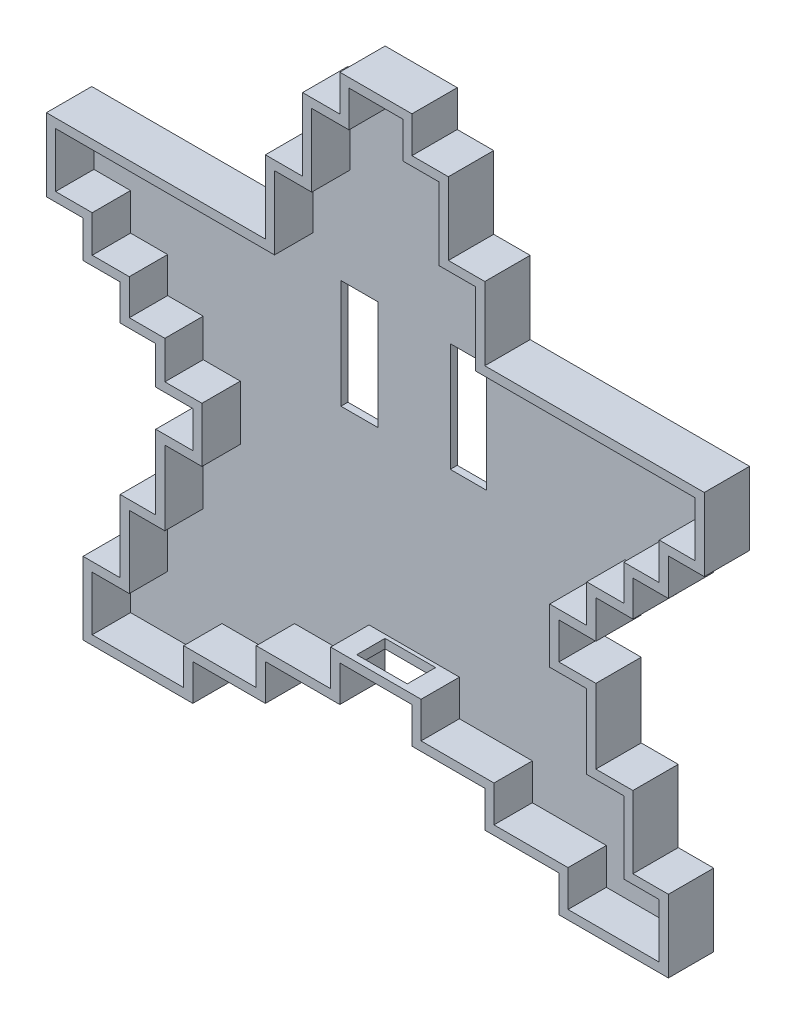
ISO-10303-21;
HEADER;
FILE_DESCRIPTION(('STEP AP214'),'2;1');
FILE_NAME('part.step','',(''),(''),'','','');
FILE_SCHEMA(('AUTOMOTIVE_DESIGN { 1 0 10303 214 1 1 1 1 }'));
ENDSEC;
DATA;
#1=APPLICATION_CONTEXT('core data for automotive mechanical design processes');
#2=APPLICATION_PROTOCOL_DEFINITION('international standard','automotive_design',2000,#1);
#3=PRODUCT_CONTEXT('',#1,'mechanical');
#4=PRODUCT('Part','Part','',(#3));
#5=PRODUCT_RELATED_PRODUCT_CATEGORY('part','',(#4));
#6=PRODUCT_DEFINITION_FORMATION('','',#4);
#7=PRODUCT_DEFINITION_CONTEXT('part definition',#1,'design');
#8=PRODUCT_DEFINITION('design','',#6,#7);
#9=PRODUCT_DEFINITION_SHAPE('','',#8);
#10=(LENGTH_UNIT() NAMED_UNIT(*) SI_UNIT(.MILLI.,.METRE.));
#11=(NAMED_UNIT(*) PLANE_ANGLE_UNIT() SI_UNIT($,.RADIAN.));
#12=(NAMED_UNIT(*) SI_UNIT($,.STERADIAN.) SOLID_ANGLE_UNIT());
#13=UNCERTAINTY_MEASURE_WITH_UNIT(LENGTH_MEASURE(1.E-05),#10,'distance_accuracy_value','');
#14=(GEOMETRIC_REPRESENTATION_CONTEXT(3) GLOBAL_UNCERTAINTY_ASSIGNED_CONTEXT((#13)) GLOBAL_UNIT_ASSIGNED_CONTEXT((#10,
#11,#12)) REPRESENTATION_CONTEXT('',''));
#15=CARTESIAN_POINT('',(0.,0.,0.));
#16=DIRECTION('',(0.,0.,1.));
#17=DIRECTION('',(1.,0.,0.));
#18=AXIS2_PLACEMENT_3D('',#15,#16,#17);
#19=CARTESIAN_POINT('',(0.,89.8740492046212,2.));
#20=DIRECTION('',(0.,-1.,0.));
#21=DIRECTION('',(0.,0.,-1.));
#22=AXIS2_PLACEMENT_3D('',#19,#20,#21);
#23=PLANE('',#22);
#24=DIRECTION('',(-1.,0.,0.));
#25=VECTOR('',#24,1.);
#26=CARTESIAN_POINT('',(0.,89.8740492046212,0.));
#27=LINE('',#26,#25);
#28=CARTESIAN_POINT('',(83.8188543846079,89.8740492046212,0.));
#29=VERTEX_POINT('',#28);
#30=CARTESIAN_POINT('',(73.3657810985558,89.8740492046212,0.));
#31=VERTEX_POINT('',#30);
#32=EDGE_CURVE('E1752',#29,#31,#27,.T.);
#33=ORIENTED_EDGE('',*,*,#32,.F.);
#34=DIRECTION('',(0.,0.,-1.));
#35=VECTOR('',#34,1.);
#36=CARTESIAN_POINT('',(83.8188543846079,89.8740492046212,2.));
#37=LINE('',#36,#35);
#38=CARTESIAN_POINT('',(83.8188543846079,89.8740492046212,2.));
#39=VERTEX_POINT('',#38);
#40=EDGE_CURVE('E1770',#39,#29,#37,.T.);
#41=ORIENTED_EDGE('',*,*,#40,.F.);
#42=DIRECTION('',(-1.,0.,0.));
#43=VECTOR('',#42,1.);
#44=CARTESIAN_POINT('',(0.,89.8740492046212,2.));
#45=LINE('',#44,#43);
#46=CARTESIAN_POINT('',(73.3657810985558,89.8740492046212,2.));
#47=VERTEX_POINT('',#46);
#48=EDGE_CURVE('E1563',#39,#47,#45,.T.);
#49=ORIENTED_EDGE('',*,*,#48,.T.);
#50=DIRECTION('',(0.,0.,-1.));
#51=VECTOR('',#50,1.);
#52=CARTESIAN_POINT('',(73.3657810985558,89.8740492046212,2.));
#53=LINE('',#52,#51);
#54=EDGE_CURVE('E1763',#47,#31,#53,.T.);
#55=ORIENTED_EDGE('',*,*,#54,.T.);
#56=EDGE_LOOP('',(#33,#41,#49,#55));
#57=FACE_BOUND('',#56,.T.);
#58=ADVANCED_FACE('F35',(#57),#23,.T.);
#59=CARTESIAN_POINT('',(83.8188543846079,0.,2.));
#60=DIRECTION('',(-1.,0.,0.));
#61=DIRECTION('',(0.,0.,1.));
#62=AXIS2_PLACEMENT_3D('',#59,#60,#61);
#63=PLANE('',#62);
#64=DIRECTION('',(0.,1.,0.));
#65=VECTOR('',#64,1.);
#66=CARTESIAN_POINT('',(83.8188543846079,0.,0.));
#67=LINE('',#66,#65);
#68=CARTESIAN_POINT('',(83.8188543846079,58.6460403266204,0.));
#69=VERTEX_POINT('',#68);
#70=EDGE_CURVE('E1755',#69,#29,#67,.T.);
#71=ORIENTED_EDGE('',*,*,#70,.F.);
#72=DIRECTION('',(0.,0.,-1.));
#73=VECTOR('',#72,1.);
#74=CARTESIAN_POINT('',(83.8188543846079,58.6460403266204,2.));
#75=LINE('',#74,#73);
#76=CARTESIAN_POINT('',(83.8188543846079,58.6460403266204,2.));
#77=VERTEX_POINT('',#76);
#78=EDGE_CURVE('E1768',#77,#69,#75,.T.);
#79=ORIENTED_EDGE('',*,*,#78,.F.);
#80=DIRECTION('',(0.,1.,0.));
#81=VECTOR('',#80,1.);
#82=CARTESIAN_POINT('',(83.8188543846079,0.,2.));
#83=LINE('',#82,#81);
#84=EDGE_CURVE('E1566',#77,#39,#83,.T.);
#85=ORIENTED_EDGE('',*,*,#84,.T.);
#86=ORIENTED_EDGE('',*,*,#40,.T.);
#87=EDGE_LOOP('',(#71,#79,#85,#86));
#88=FACE_BOUND('',#87,.T.);
#89=ADVANCED_FACE('F1806',(#88),#63,.T.);
#90=CARTESIAN_POINT('',(0.,58.6460403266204,2.));
#91=DIRECTION('',(0.,1.,0.));
#92=DIRECTION('',(0.,0.,1.));
#93=AXIS2_PLACEMENT_3D('',#90,#91,#92);
#94=PLANE('',#93);
#95=DIRECTION('',(1.,0.,0.));
#96=VECTOR('',#95,1.);
#97=CARTESIAN_POINT('',(0.,58.6460403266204,0.));
#98=LINE('',#97,#96);
#99=CARTESIAN_POINT('',(73.3657810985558,58.6460403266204,0.));
#100=VERTEX_POINT('',#99);
#101=EDGE_CURVE('E1758',#100,#69,#98,.T.);
#102=ORIENTED_EDGE('',*,*,#101,.F.);
#103=DIRECTION('',(0.,0.,-1.));
#104=VECTOR('',#103,1.);
#105=CARTESIAN_POINT('',(73.3657810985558,58.6460403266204,2.));
#106=LINE('',#105,#104);
#107=CARTESIAN_POINT('',(73.3657810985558,58.6460403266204,2.));
#108=VERTEX_POINT('',#107);
#109=EDGE_CURVE('E1765',#108,#100,#106,.T.);
#110=ORIENTED_EDGE('',*,*,#109,.F.);
#111=DIRECTION('',(1.,0.,0.));
#112=VECTOR('',#111,1.);
#113=CARTESIAN_POINT('',(0.,58.6460403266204,2.));
#114=LINE('',#113,#112);
#115=EDGE_CURVE('E1569',#108,#77,#114,.T.);
#116=ORIENTED_EDGE('',*,*,#115,.T.);
#117=ORIENTED_EDGE('',*,*,#78,.T.);
#118=EDGE_LOOP('',(#102,#110,#116,#117));
#119=FACE_BOUND('',#118,.T.);
#120=ADVANCED_FACE('F1812',(#119),#94,.T.);
#121=CARTESIAN_POINT('',(0.,58.6460403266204,2.));
#122=DIRECTION('',(0.,-1.,0.));
#123=DIRECTION('',(0.,0.,-1.));
#124=AXIS2_PLACEMENT_3D('',#121,#122,#123);
#125=PLANE('',#124);
#126=DIRECTION('',(-1.,0.,0.));
#127=VECTOR('',#126,1.);
#128=CARTESIAN_POINT('',(0.,58.6460403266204,0.));
#129=LINE('',#128,#127);
#130=CARTESIAN_POINT('',(52.6785470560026,58.6460403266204,0.));
#131=VERTEX_POINT('',#130);
#132=CARTESIAN_POINT('',(42.0065612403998,58.6460403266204,0.));
#133=VERTEX_POINT('',#132);
#134=EDGE_CURVE('E1387',#131,#133,#129,.T.);
#135=ORIENTED_EDGE('',*,*,#134,.T.);
#136=DIRECTION('',(0.,0.,-1.));
#137=VECTOR('',#136,1.);
#138=CARTESIAN_POINT('',(42.0065612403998,58.6460403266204,2.));
#139=LINE('',#138,#137);
#140=CARTESIAN_POINT('',(42.0065612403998,58.6460403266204,2.));
#141=VERTEX_POINT('',#140);
#142=EDGE_CURVE('E1766',#141,#133,#139,.T.);
#143=ORIENTED_EDGE('',*,*,#142,.F.);
#144=DIRECTION('',(-1.,0.,0.));
#145=VECTOR('',#144,1.);
#146=CARTESIAN_POINT('',(0.,58.6460403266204,2.));
#147=LINE('',#146,#145);
#148=CARTESIAN_POINT('',(52.6785470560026,58.6460403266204,2.));
#149=VERTEX_POINT('',#148);
#150=EDGE_CURVE('E1553',#149,#141,#147,.T.);
#151=ORIENTED_EDGE('',*,*,#150,.F.);
#152=DIRECTION('',(0.,0.,-1.));
#153=VECTOR('',#152,1.);
#154=CARTESIAN_POINT('',(52.6785470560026,58.6460403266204,2.));
#155=LINE('',#154,#153);
#156=EDGE_CURVE('E1743',#149,#131,#155,.T.);
#157=ORIENTED_EDGE('',*,*,#156,.T.);
#158=EDGE_LOOP('',(#135,#143,#151,#157));
#159=FACE_BOUND('',#158,.T.);
#160=ADVANCED_FACE('F37',(#159),#125,.F.);
#161=CARTESIAN_POINT('',(42.0065612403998,0.,2.));
#162=DIRECTION('',(-1.,0.,0.));
#163=DIRECTION('',(0.,0.,1.));
#164=AXIS2_PLACEMENT_3D('',#161,#162,#163);
#165=PLANE('',#164);
#166=DIRECTION('',(0.,1.,0.));
#167=VECTOR('',#166,1.);
#168=CARTESIAN_POINT('',(42.0065612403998,0.,0.));
#169=LINE('',#168,#167);
#170=CARTESIAN_POINT('',(42.0065612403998,89.8740492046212,0.));
#171=VERTEX_POINT('',#170);
#172=EDGE_CURVE('E1746',#133,#171,#169,.T.);
#173=ORIENTED_EDGE('',*,*,#172,.T.);
#174=DIRECTION('',(0.,0.,-1.));
#175=VECTOR('',#174,1.);
#176=CARTESIAN_POINT('',(42.0065612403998,89.8740492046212,2.));
#177=LINE('',#176,#175);
#178=CARTESIAN_POINT('',(42.0065612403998,89.8740492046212,2.));
#179=VERTEX_POINT('',#178);
#180=EDGE_CURVE('E1778',#179,#171,#177,.T.);
#181=ORIENTED_EDGE('',*,*,#180,.F.);
#182=DIRECTION('',(0.,1.,0.));
#183=VECTOR('',#182,1.);
#184=CARTESIAN_POINT('',(42.0065612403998,0.,2.));
#185=LINE('',#184,#183);
#186=EDGE_CURVE('E1556',#141,#179,#185,.T.);
#187=ORIENTED_EDGE('',*,*,#186,.F.);
#188=ORIENTED_EDGE('',*,*,#142,.T.);
#189=EDGE_LOOP('',(#173,#181,#187,#188));
#190=FACE_BOUND('',#189,.T.);
#191=ADVANCED_FACE('F1826',(#190),#165,.F.);
#192=CARTESIAN_POINT('',(0.,89.8740492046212,2.));
#193=DIRECTION('',(0.,1.,0.));
#194=DIRECTION('',(0.,0.,1.));
#195=AXIS2_PLACEMENT_3D('',#192,#193,#194);
#196=PLANE('',#195);
#197=DIRECTION('',(1.,0.,0.));
#198=VECTOR('',#197,1.);
#199=CARTESIAN_POINT('',(0.,89.8740492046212,0.));
#200=LINE('',#199,#198);
#201=CARTESIAN_POINT('',(52.6785470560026,89.8740492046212,0.));
#202=VERTEX_POINT('',#201);
#203=EDGE_CURVE('E1748',#171,#202,#200,.T.);
#204=ORIENTED_EDGE('',*,*,#203,.T.);
#205=DIRECTION('',(0.,0.,-1.));
#206=VECTOR('',#205,1.);
#207=CARTESIAN_POINT('',(52.6785470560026,89.8740492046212,2.));
#208=LINE('',#207,#206);
#209=CARTESIAN_POINT('',(52.6785470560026,89.8740492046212,2.));
#210=VERTEX_POINT('',#209);
#211=EDGE_CURVE('E1775',#210,#202,#208,.T.);
#212=ORIENTED_EDGE('',*,*,#211,.F.);
#213=DIRECTION('',(1.,0.,0.));
#214=VECTOR('',#213,1.);
#215=CARTESIAN_POINT('',(0.,89.8740492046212,2.));
#216=LINE('',#215,#214);
#217=EDGE_CURVE('E1559',#179,#210,#216,.T.);
#218=ORIENTED_EDGE('',*,*,#217,.F.);
#219=ORIENTED_EDGE('',*,*,#180,.T.);
#220=EDGE_LOOP('',(#204,#212,#218,#219));
#221=FACE_BOUND('',#220,.T.);
#222=ADVANCED_FACE('F1824',(#221),#196,.F.);
#223=CARTESIAN_POINT('',(73.3657810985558,0.,2.));
#224=DIRECTION('',(1.,0.,0.));
#225=DIRECTION('',(0.,0.,-1.));
#226=AXIS2_PLACEMENT_3D('',#223,#224,#225);
#227=PLANE('',#226);
#228=DIRECTION('',(0.,-1.,0.));
#229=VECTOR('',#228,1.);
#230=CARTESIAN_POINT('',(73.3657810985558,0.,0.));
#231=LINE('',#230,#229);
#232=EDGE_CURVE('E1557',#31,#100,#231,.T.);
#233=ORIENTED_EDGE('',*,*,#232,.F.);
#234=ORIENTED_EDGE('',*,*,#54,.F.);
#235=DIRECTION('',(0.,-1.,0.));
#236=VECTOR('',#235,1.);
#237=CARTESIAN_POINT('',(73.3657810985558,0.,2.));
#238=LINE('',#237,#236);
#239=EDGE_CURVE('E1572',#47,#108,#238,.T.);
#240=ORIENTED_EDGE('',*,*,#239,.T.);
#241=ORIENTED_EDGE('',*,*,#109,.T.);
#242=EDGE_LOOP('',(#233,#234,#240,#241));
#243=FACE_BOUND('',#242,.T.);
#244=ADVANCED_FACE('F1822',(#243),#227,.T.);
#245=CARTESIAN_POINT('',(52.6785470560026,0.,2.));
#246=DIRECTION('',(1.,0.,0.));
#247=DIRECTION('',(0.,0.,-1.));
#248=AXIS2_PLACEMENT_3D('',#245,#246,#247);
#249=PLANE('',#248);
#250=DIRECTION('',(0.,-1.,0.));
#251=VECTOR('',#250,1.);
#252=CARTESIAN_POINT('',(52.6785470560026,0.,0.));
#253=LINE('',#252,#251);
#254=EDGE_CURVE('E1750',#202,#131,#253,.T.);
#255=ORIENTED_EDGE('',*,*,#254,.T.);
#256=ORIENTED_EDGE('',*,*,#156,.F.);
#257=DIRECTION('',(0.,-1.,0.));
#258=VECTOR('',#257,1.);
#259=CARTESIAN_POINT('',(52.6785470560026,0.,2.));
#260=LINE('',#259,#258);
#261=EDGE_CURVE('E1561',#210,#149,#260,.T.);
#262=ORIENTED_EDGE('',*,*,#261,.F.);
#263=ORIENTED_EDGE('',*,*,#211,.T.);
#264=EDGE_LOOP('',(#255,#256,#262,#263));
#265=FACE_BOUND('',#264,.T.);
#266=ADVANCED_FACE('F1818',(#265),#249,.F.);
#267=CARTESIAN_POINT('',(0.,0.,2.));
#268=DIRECTION('',(0.,0.,1.));
#269=DIRECTION('',(1.,0.,0.));
#270=AXIS2_PLACEMENT_3D('',#267,#268,#269);
#271=PLANE('',#270);
#272=ORIENTED_EDGE('',*,*,#150,.T.);
#273=ORIENTED_EDGE('',*,*,#186,.T.);
#274=ORIENTED_EDGE('',*,*,#217,.T.);
#275=ORIENTED_EDGE('',*,*,#261,.T.);
#276=EDGE_LOOP('',(#272,#273,#274,#275));
#277=FACE_BOUND('',#276,.T.);
#278=ORIENTED_EDGE('',*,*,#48,.F.);
#279=ORIENTED_EDGE('',*,*,#84,.F.);
#280=ORIENTED_EDGE('',*,*,#115,.F.);
#281=ORIENTED_EDGE('',*,*,#239,.F.);
#282=EDGE_LOOP('',(#278,#279,#280,#281));
#283=FACE_BOUND('',#282,.T.);
#284=DIRECTION('',(0.,-1.,0.));
#285=VECTOR('',#284,1.);
#286=CARTESIAN_POINT('',(33.959575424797,0.,2.));
#287=LINE('',#286,#285);
#288=CARTESIAN_POINT('',(33.959575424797,118.633595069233,2.));
#289=VERTEX_POINT('',#288);
#290=CARTESIAN_POINT('',(33.959575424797,97.6996105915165,2.));
#291=VERTEX_POINT('',#290);
#292=EDGE_CURVE('E1575',#289,#291,#287,.T.);
#293=ORIENTED_EDGE('',*,*,#292,.T.);
#294=DIRECTION('',(-1.,0.,0.));
#295=VECTOR('',#294,1.);
#296=CARTESIAN_POINT('',(0.,97.6996105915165,2.));
#297=LINE('',#296,#295);
#298=CARTESIAN_POINT('',(-28.8439802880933,97.6996105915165,2.));
#299=VERTEX_POINT('',#298);
#300=EDGE_CURVE('E1578',#291,#299,#297,.T.);
#301=ORIENTED_EDGE('',*,*,#300,.T.);
#302=DIRECTION('',(0.,-1.,0.));
#303=VECTOR('',#302,1.);
#304=CARTESIAN_POINT('',(-28.8439802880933,0.,2.));
#305=LINE('',#304,#303);
#306=CARTESIAN_POINT('',(-28.8439802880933,82.0484878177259,2.));
#307=VERTEX_POINT('',#306);
#308=EDGE_CURVE('E1581',#299,#307,#305,.T.);
#309=ORIENTED_EDGE('',*,*,#308,.T.);
#310=DIRECTION('',(1.,0.,0.));
#311=VECTOR('',#310,1.);
#312=CARTESIAN_POINT('',(0.,82.0484878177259,2.));
#313=LINE('',#312,#311);
#314=CARTESIAN_POINT('',(-18.3315812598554,82.0484878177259,2.));
#315=VERTEX_POINT('',#314);
#316=EDGE_CURVE('E1584',#307,#315,#313,.T.);
#317=ORIENTED_EDGE('',*,*,#316,.T.);
#318=DIRECTION('',(0.,-1.,0.));
#319=VECTOR('',#318,1.);
#320=CARTESIAN_POINT('',(-18.3315812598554,0.,2.));
#321=LINE('',#320,#319);
#322=CARTESIAN_POINT('',(-18.3315812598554,71.4742511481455,2.));
#323=VERTEX_POINT('',#322);
#324=EDGE_CURVE('E1587',#315,#323,#321,.T.);
#325=ORIENTED_EDGE('',*,*,#324,.T.);
#326=DIRECTION('',(1.,0.,0.));
#327=VECTOR('',#326,1.);
#328=CARTESIAN_POINT('',(0.,71.4742511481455,2.));
#329=LINE('',#328,#327);
#330=CARTESIAN_POINT('',(-7.69550694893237,71.4742511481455,2.));
#331=VERTEX_POINT('',#330);
#332=EDGE_CURVE('E1590',#323,#331,#329,.T.);
#333=ORIENTED_EDGE('',*,*,#332,.T.);
#334=DIRECTION('',(0.,-1.,0.));
#335=VECTOR('',#334,1.);
#336=CARTESIAN_POINT('',(-7.69550694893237,0.,2.));
#337=LINE('',#336,#335);
#338=CARTESIAN_POINT('',(-7.69550694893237,61.2710403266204,2.));
#339=VERTEX_POINT('',#338);
#340=EDGE_CURVE('E1593',#331,#339,#337,.T.);
#341=ORIENTED_EDGE('',*,*,#340,.T.);
#342=DIRECTION('',(1.,0.,0.));
#343=VECTOR('',#342,1.);
#344=CARTESIAN_POINT('',(0.,61.2710403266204,2.));
#345=LINE('',#344,#343);
#346=CARTESIAN_POINT('',(2.50770387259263,61.2710403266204,2.));
#347=VERTEX_POINT('',#346);
#348=EDGE_CURVE('E1596',#339,#347,#345,.T.);
#349=ORIENTED_EDGE('',*,*,#348,.T.);
#350=DIRECTION('',(0.,-1.,0.));
#351=VECTOR('',#350,1.);
#352=CARTESIAN_POINT('',(2.50770387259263,0.,2.));
#353=LINE('',#352,#351);
#354=CARTESIAN_POINT('',(2.50770387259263,50.4494530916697,2.));
#355=VERTEX_POINT('',#354);
#356=EDGE_CURVE('E1599',#347,#355,#353,.T.);
#357=ORIENTED_EDGE('',*,*,#356,.T.);
#358=DIRECTION('',(1.,0.,0.));
#359=VECTOR('',#358,1.);
#360=CARTESIAN_POINT('',(0.,50.4494530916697,2.));
#361=LINE('',#360,#359);
#362=CARTESIAN_POINT('',(13.1437781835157,50.4494530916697,2.));
#363=VERTEX_POINT('',#362);
#364=EDGE_CURVE('E1602',#355,#363,#361,.T.);
#365=ORIENTED_EDGE('',*,*,#364,.T.);
#366=DIRECTION('',(0.,-1.,0.));
#367=VECTOR('',#366,1.);
#368=CARTESIAN_POINT('',(13.1437781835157,0.,2.));
#369=LINE('',#368,#367);
#370=CARTESIAN_POINT('',(13.1437781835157,34.7488917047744,2.));
#371=VERTEX_POINT('',#370);
#372=EDGE_CURVE('E1605',#363,#371,#369,.T.);
#373=ORIENTED_EDGE('',*,*,#372,.T.);
#374=DIRECTION('',(-1.,0.,0.));
#375=VECTOR('',#374,1.);
#376=CARTESIAN_POINT('',(0.,34.7488917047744,2.));
#377=LINE('',#376,#375);
#378=CARTESIAN_POINT('',(2.50770387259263,34.7488917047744,2.));
#379=VERTEX_POINT('',#378);
#380=EDGE_CURVE('E1608',#371,#379,#377,.T.);
#381=ORIENTED_EDGE('',*,*,#380,.T.);
#382=DIRECTION('',(0.,-1.,0.));
#383=VECTOR('',#382,1.);
#384=CARTESIAN_POINT('',(2.50770387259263,0.,2.));
#385=LINE('',#384,#383);
#386=CARTESIAN_POINT('',(2.50770387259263,13.4461246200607,2.));
#387=VERTEX_POINT('',#386);
#388=EDGE_CURVE('E1611',#379,#387,#385,.T.);
#389=ORIENTED_EDGE('',*,*,#388,.T.);
#390=DIRECTION('',(-1.,0.,0.));
#391=VECTOR('',#390,1.);
#392=CARTESIAN_POINT('',(0.,13.4461246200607,2.));
#393=LINE('',#392,#391);
#394=CARTESIAN_POINT('',(-7.69550694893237,13.4461246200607,2.));
#395=VERTEX_POINT('',#394);
#396=EDGE_CURVE('E1614',#387,#395,#393,.T.);
#397=ORIENTED_EDGE('',*,*,#396,.T.);
#398=DIRECTION('',(0.,-1.,0.));
#399=VECTOR('',#398,1.);
#400=CARTESIAN_POINT('',(-7.69550694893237,0.,2.));
#401=LINE('',#400,#399);
#402=CARTESIAN_POINT('',(-7.69550694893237,-7.24110942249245,2.));
#403=VERTEX_POINT('',#402);
#404=EDGE_CURVE('E1617',#395,#403,#401,.T.);
#405=ORIENTED_EDGE('',*,*,#404,.T.);
#406=DIRECTION('',(-1.,0.,0.));
#407=VECTOR('',#406,1.);
#408=CARTESIAN_POINT('',(0.,-7.24110942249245,2.));
#409=LINE('',#408,#407);
#410=CARTESIAN_POINT('',(-18.3315812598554,-7.24110942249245,2.));
#411=VERTEX_POINT('',#410);
#412=EDGE_CURVE('E1620',#403,#411,#409,.T.);
#413=ORIENTED_EDGE('',*,*,#412,.T.);
#414=DIRECTION('',(0.,-1.,0.));
#415=VECTOR('',#414,1.);
#416=CARTESIAN_POINT('',(-18.3315812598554,0.,2.));
#417=LINE('',#416,#415);
#418=CARTESIAN_POINT('',(-18.3315812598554,-22.787799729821,2.));
#419=VERTEX_POINT('',#418);
#420=EDGE_CURVE('E1623',#411,#419,#417,.T.);
#421=ORIENTED_EDGE('',*,*,#420,.T.);
#422=DIRECTION('',(1.,0.,0.));
#423=VECTOR('',#422,1.);
#424=CARTESIAN_POINT('',(0.,-22.787799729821,2.));
#425=LINE('',#424,#423);
#426=CARTESIAN_POINT('',(7.89377818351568,-22.787799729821,2.));
#427=VERTEX_POINT('',#426);
#428=EDGE_CURVE('E1626',#419,#427,#425,.T.);
#429=ORIENTED_EDGE('',*,*,#428,.T.);
#430=DIRECTION('',(0.,1.,0.));
#431=VECTOR('',#430,1.);
#432=CARTESIAN_POINT('',(7.89377818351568,0.,2.));
#433=LINE('',#432,#431);
#434=CARTESIAN_POINT('',(7.89377818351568,-12.3894545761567,2.));
#435=VERTEX_POINT('',#434);
#436=EDGE_CURVE('E1629',#427,#435,#433,.T.);
#437=ORIENTED_EDGE('',*,*,#436,.T.);
#438=DIRECTION('',(1.,0.,0.));
#439=VECTOR('',#438,1.);
#440=CARTESIAN_POINT('',(0.,-12.3894545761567,2.));
#441=LINE('',#440,#439);
#442=CARTESIAN_POINT('',(28.709575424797,-12.3894545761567,2.));
#443=VERTEX_POINT('',#442);
#444=EDGE_CURVE('E1632',#435,#443,#441,.T.);
#445=ORIENTED_EDGE('',*,*,#444,.T.);
#446=DIRECTION('',(0.,1.,0.));
#447=VECTOR('',#446,1.);
#448=CARTESIAN_POINT('',(28.709575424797,0.,2.));
#449=LINE('',#448,#447);
#450=CARTESIAN_POINT('',(28.709575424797,-1.99110942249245,2.));
#451=VERTEX_POINT('',#450);
#452=EDGE_CURVE('E1635',#443,#451,#449,.T.);
#453=ORIENTED_EDGE('',*,*,#452,.T.);
#454=DIRECTION('',(1.,0.,0.));
#455=VECTOR('',#454,1.);
#456=CARTESIAN_POINT('',(0.,-1.99110942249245,2.));
#457=LINE('',#456,#455);
#458=CARTESIAN_POINT('',(50.0535470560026,-1.99110942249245,2.));
#459=VERTEX_POINT('',#458);
#460=EDGE_CURVE('E1638',#451,#459,#457,.T.);
#461=ORIENTED_EDGE('',*,*,#460,.T.);
#462=DIRECTION('',(0.,1.,0.));
#463=VECTOR('',#462,1.);
#464=CARTESIAN_POINT('',(50.0535470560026,0.,2.));
#465=LINE('',#464,#463);
#466=CARTESIAN_POINT('',(50.0535470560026,8.35250759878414,2.));
#467=VERTEX_POINT('',#466);
#468=EDGE_CURVE('E1641',#459,#467,#465,.T.);
#469=ORIENTED_EDGE('',*,*,#468,.T.);
#470=DIRECTION('',(1.,0.,0.));
#471=VECTOR('',#470,1.);
#472=CARTESIAN_POINT('',(0.,8.35250759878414,2.));
#473=LINE('',#472,#471);
#474=CARTESIAN_POINT('',(75.9907810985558,8.35250759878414,2.));
#475=VERTEX_POINT('',#474);
#476=EDGE_CURVE('E1644',#467,#475,#473,.T.);
#477=ORIENTED_EDGE('',*,*,#476,.T.);
#478=DIRECTION('',(0.,-1.,0.));
#479=VECTOR('',#478,1.);
#480=CARTESIAN_POINT('',(75.9907810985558,0.,2.));
#481=LINE('',#480,#479);
#482=CARTESIAN_POINT('',(75.9907810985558,-1.99110942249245,2.));
#483=VERTEX_POINT('',#482);
#484=EDGE_CURVE('E1647',#475,#483,#481,.T.);
#485=ORIENTED_EDGE('',*,*,#484,.T.);
#486=DIRECTION('',(1.,0.,0.));
#487=VECTOR('',#486,1.);
#488=CARTESIAN_POINT('',(0.,-1.99110942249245,2.));
#489=LINE('',#488,#487);
#490=CARTESIAN_POINT('',(96.8969276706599,-1.99110942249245,2.));
#491=VERTEX_POINT('',#490);
#492=EDGE_CURVE('E1650',#483,#491,#489,.T.);
#493=ORIENTED_EDGE('',*,*,#492,.T.);
#494=DIRECTION('',(0.,-1.,0.));
#495=VECTOR('',#494,1.);
#496=CARTESIAN_POINT('',(96.8969276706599,0.,2.));
#497=LINE('',#496,#495);
#498=CARTESIAN_POINT('',(96.8969276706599,-12.3894545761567,2.));
#499=VERTEX_POINT('',#498);
#500=EDGE_CURVE('E1653',#491,#499,#497,.T.);
#501=ORIENTED_EDGE('',*,*,#500,.T.);
#502=DIRECTION('',(1.,0.,0.));
#503=VECTOR('',#502,1.);
#504=CARTESIAN_POINT('',(0.,-12.3894545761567,2.));
#505=LINE('',#504,#503);
#506=CARTESIAN_POINT('',(118.13144303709,-12.3894545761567,2.));
#507=VERTEX_POINT('',#506);
#508=EDGE_CURVE('E1656',#499,#507,#505,.T.);
#509=ORIENTED_EDGE('',*,*,#508,.T.);
#510=DIRECTION('',(0.,-1.,0.));
#511=VECTOR('',#510,1.);
#512=CARTESIAN_POINT('',(118.13144303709,0.,2.));
#513=LINE('',#512,#511);
#514=CARTESIAN_POINT('',(118.13144303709,-22.787799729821,2.));
#515=VERTEX_POINT('',#514);
#516=EDGE_CURVE('E1659',#507,#515,#513,.T.);
#517=ORIENTED_EDGE('',*,*,#516,.T.);
#518=DIRECTION('',(1.,0.,0.));
#519=VECTOR('',#518,1.);
#520=CARTESIAN_POINT('',(0.,-22.787799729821,2.));
#521=LINE('',#520,#519);
#522=CARTESIAN_POINT('',(144.295391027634,-22.787799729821,2.));
#523=VERTEX_POINT('',#522);
#524=EDGE_CURVE('E1662',#515,#523,#521,.T.);
#525=ORIENTED_EDGE('',*,*,#524,.T.);
#526=DIRECTION('',(0.,1.,0.));
#527=VECTOR('',#526,1.);
#528=CARTESIAN_POINT('',(144.295391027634,0.,2.));
#529=LINE('',#528,#527);
#530=CARTESIAN_POINT('',(144.295391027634,-7.24110942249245,2.));
#531=VERTEX_POINT('',#530);
#532=EDGE_CURVE('E1665',#523,#531,#529,.T.);
#533=ORIENTED_EDGE('',*,*,#532,.T.);
#534=DIRECTION('',(-1.,0.,0.));
#535=VECTOR('',#534,1.);
#536=CARTESIAN_POINT('',(0.,-7.24110942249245,2.));
#537=LINE('',#536,#535);
#538=CARTESIAN_POINT('',(134.11595840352,-7.24110942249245,2.));
#539=VERTEX_POINT('',#538);
#540=EDGE_CURVE('E1668',#531,#539,#537,.T.);
#541=ORIENTED_EDGE('',*,*,#540,.T.);
#542=DIRECTION('',(0.,1.,0.));
#543=VECTOR('',#542,1.);
#544=CARTESIAN_POINT('',(134.11595840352,0.,2.));
#545=LINE('',#544,#543);
#546=CARTESIAN_POINT('',(134.11595840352,13.4461246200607,2.));
#547=VERTEX_POINT('',#546);
#548=EDGE_CURVE('E1671',#539,#547,#545,.T.);
#549=ORIENTED_EDGE('',*,*,#548,.T.);
#550=DIRECTION('',(-1.,0.,0.));
#551=VECTOR('',#550,1.);
#552=CARTESIAN_POINT('',(0.,13.4461246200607,2.));
#553=LINE('',#552,#551);
#554=CARTESIAN_POINT('',(123.498700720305,13.4461246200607,2.));
#555=VERTEX_POINT('',#554);
#556=EDGE_CURVE('E1674',#547,#555,#553,.T.);
#557=ORIENTED_EDGE('',*,*,#556,.T.);
#558=DIRECTION('',(0.,1.,0.));
#559=VECTOR('',#558,1.);
#560=CARTESIAN_POINT('',(123.498700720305,0.,2.));
#561=LINE('',#560,#559);
#562=CARTESIAN_POINT('',(123.498700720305,34.7488917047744,2.));
#563=VERTEX_POINT('',#562);
#564=EDGE_CURVE('E1677',#555,#563,#561,.T.);
#565=ORIENTED_EDGE('',*,*,#564,.T.);
#566=DIRECTION('',(-1.,0.,0.));
#567=VECTOR('',#566,1.);
#568=CARTESIAN_POINT('',(0.,34.7488917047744,2.));
#569=LINE('',#568,#567);
#570=CARTESIAN_POINT('',(112.88144303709,34.7488917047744,2.));
#571=VERTEX_POINT('',#570);
#572=EDGE_CURVE('E1680',#563,#571,#569,.T.);
#573=ORIENTED_EDGE('',*,*,#572,.T.);
#574=DIRECTION('',(0.,1.,0.));
#575=VECTOR('',#574,1.);
#576=CARTESIAN_POINT('',(112.88144303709,0.,2.));
#577=LINE('',#576,#575);
#578=CARTESIAN_POINT('',(112.88144303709,50.4494530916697,2.));
#579=VERTEX_POINT('',#578);
#580=EDGE_CURVE('E1683',#571,#579,#577,.T.);
#581=ORIENTED_EDGE('',*,*,#580,.T.);
#582=DIRECTION('',(1.,0.,0.));
#583=VECTOR('',#582,1.);
#584=CARTESIAN_POINT('',(0.,50.4494530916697,2.));
#585=LINE('',#584,#583);
#586=CARTESIAN_POINT('',(123.498700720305,50.4494530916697,2.));
#587=VERTEX_POINT('',#586);
#588=EDGE_CURVE('E1686',#579,#587,#585,.T.);
#589=ORIENTED_EDGE('',*,*,#588,.T.);
#590=DIRECTION('',(0.,1.,0.));
#591=VECTOR('',#590,1.);
#592=CARTESIAN_POINT('',(123.498700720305,0.,2.));
#593=LINE('',#592,#591);
#594=CARTESIAN_POINT('',(123.498700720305,61.2710403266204,2.));
#595=VERTEX_POINT('',#594);
#596=EDGE_CURVE('E1689',#587,#595,#593,.T.);
#597=ORIENTED_EDGE('',*,*,#596,.T.);
#598=DIRECTION('',(1.,0.,0.));
#599=VECTOR('',#598,1.);
#600=CARTESIAN_POINT('',(0.,61.2710403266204,2.));
#601=LINE('',#600,#599);
#602=CARTESIAN_POINT('',(134.11595840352,61.2710403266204,2.));
#603=VERTEX_POINT('',#602);
#604=EDGE_CURVE('E1692',#595,#603,#601,.T.);
#605=ORIENTED_EDGE('',*,*,#604,.T.);
#606=DIRECTION('',(0.,1.,0.));
#607=VECTOR('',#606,1.);
#608=CARTESIAN_POINT('',(134.11595840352,0.,2.));
#609=LINE('',#608,#607);
#610=CARTESIAN_POINT('',(134.11595840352,71.4742511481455,2.));
#611=VERTEX_POINT('',#610);
#612=EDGE_CURVE('E1695',#603,#611,#609,.T.);
#613=ORIENTED_EDGE('',*,*,#612,.T.);
#614=DIRECTION('',(1.,0.,0.));
#615=VECTOR('',#614,1.);
#616=CARTESIAN_POINT('',(0.,71.4742511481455,2.));
#617=LINE('',#616,#615);
#618=CARTESIAN_POINT('',(144.295391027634,71.4742511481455,2.));
#619=VERTEX_POINT('',#618);
#620=EDGE_CURVE('E1698',#611,#619,#617,.T.);
#621=ORIENTED_EDGE('',*,*,#620,.T.);
#622=DIRECTION('',(0.,1.,0.));
#623=VECTOR('',#622,1.);
#624=CARTESIAN_POINT('',(144.295391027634,0.,2.));
#625=LINE('',#624,#623);
#626=CARTESIAN_POINT('',(144.295391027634,82.0484878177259,2.));
#627=VERTEX_POINT('',#626);
#628=EDGE_CURVE('E1701',#619,#627,#625,.T.);
#629=ORIENTED_EDGE('',*,*,#628,.T.);
#630=DIRECTION('',(1.,0.,0.));
#631=VECTOR('',#630,1.);
#632=CARTESIAN_POINT('',(0.,82.0484878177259,2.));
#633=LINE('',#632,#631);
#634=CARTESIAN_POINT('',(154.584279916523,82.0484878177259,2.));
#635=VERTEX_POINT('',#634);
#636=EDGE_CURVE('E1704',#627,#635,#633,.T.);
#637=ORIENTED_EDGE('',*,*,#636,.T.);
#638=DIRECTION('',(0.,1.,0.));
#639=VECTOR('',#638,1.);
#640=CARTESIAN_POINT('',(154.584279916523,0.,2.));
#641=LINE('',#640,#639);
#642=CARTESIAN_POINT('',(154.584279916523,97.6996105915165,2.));
#643=VERTEX_POINT('',#642);
#644=EDGE_CURVE('E1707',#635,#643,#641,.T.);
#645=ORIENTED_EDGE('',*,*,#644,.T.);
#646=DIRECTION('',(-1.,0.,0.));
#647=VECTOR('',#646,1.);
#648=CARTESIAN_POINT('',(0.,97.6996105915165,2.));
#649=LINE('',#648,#647);
#650=CARTESIAN_POINT('',(91.6469276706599,97.6996105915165,2.));
#651=VERTEX_POINT('',#650);
#652=EDGE_CURVE('E1710',#643,#651,#649,.T.);
#653=ORIENTED_EDGE('',*,*,#652,.T.);
#654=DIRECTION('',(0.,1.,0.));
#655=VECTOR('',#654,1.);
#656=CARTESIAN_POINT('',(91.6469276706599,0.,2.));
#657=LINE('',#656,#655);
#658=CARTESIAN_POINT('',(91.6469276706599,118.633595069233,2.));
#659=VERTEX_POINT('',#658);
#660=EDGE_CURVE('E1713',#651,#659,#657,.T.);
#661=ORIENTED_EDGE('',*,*,#660,.T.);
#662=DIRECTION('',(-1.,0.,0.));
#663=VECTOR('',#662,1.);
#664=CARTESIAN_POINT('',(0.,118.633595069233,2.));
#665=LINE('',#664,#663);
#666=CARTESIAN_POINT('',(81.1938543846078,118.633595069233,2.));
#667=VERTEX_POINT('',#666);
#668=EDGE_CURVE('E1716',#659,#667,#665,.T.);
#669=ORIENTED_EDGE('',*,*,#668,.T.);
#670=DIRECTION('',(0.,1.,0.));
#671=VECTOR('',#670,1.);
#672=CARTESIAN_POINT('',(81.1938543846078,0.,2.));
#673=LINE('',#672,#671);
#674=CARTESIAN_POINT('',(81.1938543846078,139.430285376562,2.));
#675=VERTEX_POINT('',#674);
#676=EDGE_CURVE('E1719',#667,#675,#673,.T.);
#677=ORIENTED_EDGE('',*,*,#676,.T.);
#678=DIRECTION('',(-1.,0.,0.));
#679=VECTOR('',#678,1.);
#680=CARTESIAN_POINT('',(0.,139.430285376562,2.));
#681=LINE('',#680,#679);
#682=CARTESIAN_POINT('',(70.7407810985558,139.430285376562,2.));
#683=VERTEX_POINT('',#682);
#684=EDGE_CURVE('E1722',#675,#683,#681,.T.);
#685=ORIENTED_EDGE('',*,*,#684,.T.);
#686=DIRECTION('',(0.,1.,0.));
#687=VECTOR('',#686,1.);
#688=CARTESIAN_POINT('',(70.7407810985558,0.,2.));
#689=LINE('',#688,#687);
#690=CARTESIAN_POINT('',(70.7407810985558,149.828630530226,2.));
#691=VERTEX_POINT('',#690);
#692=EDGE_CURVE('E1725',#683,#691,#689,.T.);
#693=ORIENTED_EDGE('',*,*,#692,.T.);
#694=DIRECTION('',(-1.,0.,0.));
#695=VECTOR('',#694,1.);
#696=CARTESIAN_POINT('',(0.,149.828630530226,2.));
#697=LINE('',#696,#695);
#698=CARTESIAN_POINT('',(55.3035470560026,149.828630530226,2.));
#699=VERTEX_POINT('',#698);
#700=EDGE_CURVE('E1728',#691,#699,#697,.T.);
#701=ORIENTED_EDGE('',*,*,#700,.T.);
#702=DIRECTION('',(0.,-1.,0.));
#703=VECTOR('',#702,1.);
#704=CARTESIAN_POINT('',(55.3035470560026,0.,2.));
#705=LINE('',#704,#703);
#706=CARTESIAN_POINT('',(55.3035470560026,139.430285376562,2.));
#707=VERTEX_POINT('',#706);
#708=EDGE_CURVE('E1731',#699,#707,#705,.T.);
#709=ORIENTED_EDGE('',*,*,#708,.T.);
#710=DIRECTION('',(-1.,0.,0.));
#711=VECTOR('',#710,1.);
#712=CARTESIAN_POINT('',(0.,139.430285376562,2.));
#713=LINE('',#712,#711);
#714=CARTESIAN_POINT('',(44.6315612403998,139.430285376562,2.));
#715=VERTEX_POINT('',#714);
#716=EDGE_CURVE('E1734',#707,#715,#713,.T.);
#717=ORIENTED_EDGE('',*,*,#716,.T.);
#718=DIRECTION('',(0.,-1.,0.));
#719=VECTOR('',#718,1.);
#720=CARTESIAN_POINT('',(44.6315612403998,0.,2.));
#721=LINE('',#720,#719);
#722=CARTESIAN_POINT('',(44.6315612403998,118.633595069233,2.));
#723=VERTEX_POINT('',#722);
#724=EDGE_CURVE('E1737',#715,#723,#721,.T.);
#725=ORIENTED_EDGE('',*,*,#724,.T.);
#726=DIRECTION('',(-1.,0.,0.));
#727=VECTOR('',#726,1.);
#728=CARTESIAN_POINT('',(0.,118.633595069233,2.));
#729=LINE('',#728,#727);
#730=EDGE_CURVE('E1740',#723,#289,#729,.T.);
#731=ORIENTED_EDGE('',*,*,#730,.T.);
#732=EDGE_LOOP('',(#293,#301,#309,#317,#325,#333,#341,#349,#357,#365,#373,#381,#389,#397,#405,
#413,#421,#429,#437,#445,#453,#461,#469,#477,#485,#493,#501,#509,#517,#525,#533,#541,#549,#557,
#565,#573,#581,#589,#597,#605,#613,#621,#629,#637,#645,#653,#661,#669,#677,#685,#693,#701,#709,
#717,#725,#731));
#733=FACE_BOUND('',#732,.T.);
#734=ADVANCED_FACE('F1821',(#277,#283,#733),#271,.T.);
#735=CARTESIAN_POINT('',(0.,0.,0.));
#736=DIRECTION('',(0.,0.,1.));
#737=DIRECTION('',(1.,0.,0.));
#738=AXIS2_PLACEMENT_3D('',#735,#736,#737);
#739=PLANE('',#738);
#740=ORIENTED_EDGE('',*,*,#134,.F.);
#741=ORIENTED_EDGE('',*,*,#254,.F.);
#742=ORIENTED_EDGE('',*,*,#203,.F.);
#743=ORIENTED_EDGE('',*,*,#172,.F.);
#744=EDGE_LOOP('',(#740,#741,#742,#743));
#745=FACE_BOUND('',#744,.T.);
#746=ORIENTED_EDGE('',*,*,#32,.T.);
#747=ORIENTED_EDGE('',*,*,#232,.T.);
#748=ORIENTED_EDGE('',*,*,#101,.T.);
#749=ORIENTED_EDGE('',*,*,#70,.T.);
#750=EDGE_LOOP('',(#746,#747,#748,#749));
#751=FACE_BOUND('',#750,.T.);
#752=DIRECTION('',(0.,-1.,0.));
#753=VECTOR('',#752,1.);
#754=CARTESIAN_POINT('',(31.334575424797,0.,0.));
#755=LINE('',#754,#753);
#756=CARTESIAN_POINT('',(31.334575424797,121.258595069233,0.));
#757=VERTEX_POINT('',#756);
#758=CARTESIAN_POINT('',(31.334575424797,100.324610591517,0.));
#759=VERTEX_POINT('',#758);
#760=EDGE_CURVE('E821',#757,#759,#755,.T.);
#761=ORIENTED_EDGE('',*,*,#760,.F.);
#762=DIRECTION('',(-1.,0.,0.));
#763=VECTOR('',#762,1.);
#764=CARTESIAN_POINT('',(0.,121.258595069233,0.));
#765=LINE('',#764,#763);
#766=CARTESIAN_POINT('',(42.0065612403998,121.258595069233,0.));
#767=VERTEX_POINT('',#766);
#768=EDGE_CURVE('E828',#767,#757,#765,.T.);
#769=ORIENTED_EDGE('',*,*,#768,.F.);
#770=DIRECTION('',(0.,-1.,0.));
#771=VECTOR('',#770,1.);
#772=CARTESIAN_POINT('',(42.0065612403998,0.,0.));
#773=LINE('',#772,#771);
#774=CARTESIAN_POINT('',(42.0065612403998,142.055285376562,0.));
#775=VERTEX_POINT('',#774);
#776=EDGE_CURVE('E1215',#775,#767,#773,.T.);
#777=ORIENTED_EDGE('',*,*,#776,.F.);
#778=DIRECTION('',(-1.,0.,0.));
#779=VECTOR('',#778,1.);
#780=CARTESIAN_POINT('',(0.,142.055285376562,0.));
#781=LINE('',#780,#779);
#782=CARTESIAN_POINT('',(52.6785470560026,142.055285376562,0.));
#783=VERTEX_POINT('',#782);
#784=EDGE_CURVE('E1213',#783,#775,#781,.T.);
#785=ORIENTED_EDGE('',*,*,#784,.F.);
#786=DIRECTION('',(0.,-1.,0.));
#787=VECTOR('',#786,1.);
#788=CARTESIAN_POINT('',(52.6785470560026,0.,0.));
#789=LINE('',#788,#787);
#790=CARTESIAN_POINT('',(52.6785470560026,152.453630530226,0.));
#791=VERTEX_POINT('',#790);
#792=EDGE_CURVE('E1211',#791,#783,#789,.T.);
#793=ORIENTED_EDGE('',*,*,#792,.F.);
#794=DIRECTION('',(-1.,0.,0.));
#795=VECTOR('',#794,1.);
#796=CARTESIAN_POINT('',(0.,152.453630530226,0.));
#797=LINE('',#796,#795);
#798=CARTESIAN_POINT('',(73.3657810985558,152.453630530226,0.));
#799=VERTEX_POINT('',#798);
#800=EDGE_CURVE('E1209',#799,#791,#797,.T.);
#801=ORIENTED_EDGE('',*,*,#800,.F.);
#802=DIRECTION('',(0.,1.,0.));
#803=VECTOR('',#802,1.);
#804=CARTESIAN_POINT('',(73.3657810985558,0.,0.));
#805=LINE('',#804,#803);
#806=CARTESIAN_POINT('',(73.3657810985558,142.055285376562,0.));
#807=VERTEX_POINT('',#806);
#808=EDGE_CURVE('E1207',#807,#799,#805,.T.);
#809=ORIENTED_EDGE('',*,*,#808,.F.);
#810=DIRECTION('',(-1.,0.,0.));
#811=VECTOR('',#810,1.);
#812=CARTESIAN_POINT('',(0.,142.055285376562,0.));
#813=LINE('',#812,#811);
#814=CARTESIAN_POINT('',(83.8188543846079,142.055285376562,0.));
#815=VERTEX_POINT('',#814);
#816=EDGE_CURVE('E1205',#815,#807,#813,.T.);
#817=ORIENTED_EDGE('',*,*,#816,.F.);
#818=DIRECTION('',(0.,1.,0.));
#819=VECTOR('',#818,1.);
#820=CARTESIAN_POINT('',(83.8188543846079,0.,0.));
#821=LINE('',#820,#819);
#822=CARTESIAN_POINT('',(83.8188543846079,121.258595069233,0.));
#823=VERTEX_POINT('',#822);
#824=EDGE_CURVE('E1203',#823,#815,#821,.T.);
#825=ORIENTED_EDGE('',*,*,#824,.F.);
#826=DIRECTION('',(-1.,0.,0.));
#827=VECTOR('',#826,1.);
#828=CARTESIAN_POINT('',(0.,121.258595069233,0.));
#829=LINE('',#828,#827);
#830=CARTESIAN_POINT('',(94.2719276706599,121.258595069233,0.));
#831=VERTEX_POINT('',#830);
#832=EDGE_CURVE('E1201',#831,#823,#829,.T.);
#833=ORIENTED_EDGE('',*,*,#832,.F.);
#834=DIRECTION('',(0.,1.,0.));
#835=VECTOR('',#834,1.);
#836=CARTESIAN_POINT('',(94.2719276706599,0.,0.));
#837=LINE('',#836,#835);
#838=CARTESIAN_POINT('',(94.2719276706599,100.324610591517,0.));
#839=VERTEX_POINT('',#838);
#840=EDGE_CURVE('E1199',#839,#831,#837,.T.);
#841=ORIENTED_EDGE('',*,*,#840,.F.);
#842=DIRECTION('',(-1.,0.,0.));
#843=VECTOR('',#842,1.);
#844=CARTESIAN_POINT('',(0.,100.324610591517,0.));
#845=LINE('',#844,#843);
#846=CARTESIAN_POINT('',(157.209279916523,100.324610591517,0.));
#847=VERTEX_POINT('',#846);
#848=EDGE_CURVE('E1197',#847,#839,#845,.T.);
#849=ORIENTED_EDGE('',*,*,#848,.F.);
#850=DIRECTION('',(0.,1.,0.));
#851=VECTOR('',#850,1.);
#852=CARTESIAN_POINT('',(157.209279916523,0.,0.));
#853=LINE('',#852,#851);
#854=CARTESIAN_POINT('',(157.209279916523,79.4234878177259,0.));
#855=VERTEX_POINT('',#854);
#856=EDGE_CURVE('E1195',#855,#847,#853,.T.);
#857=ORIENTED_EDGE('',*,*,#856,.F.);
#858=DIRECTION('',(1.,0.,0.));
#859=VECTOR('',#858,1.);
#860=CARTESIAN_POINT('',(0.,79.4234878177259,0.));
#861=LINE('',#860,#859);
#862=CARTESIAN_POINT('',(146.920391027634,79.4234878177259,0.));
#863=VERTEX_POINT('',#862);
#864=EDGE_CURVE('E1193',#863,#855,#861,.T.);
#865=ORIENTED_EDGE('',*,*,#864,.F.);
#866=DIRECTION('',(0.,1.,0.));
#867=VECTOR('',#866,1.);
#868=CARTESIAN_POINT('',(146.920391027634,0.,0.));
#869=LINE('',#868,#867);
#870=CARTESIAN_POINT('',(146.920391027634,68.8492511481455,0.));
#871=VERTEX_POINT('',#870);
#872=EDGE_CURVE('E1191',#871,#863,#869,.T.);
#873=ORIENTED_EDGE('',*,*,#872,.F.);
#874=DIRECTION('',(1.,0.,0.));
#875=VECTOR('',#874,1.);
#876=CARTESIAN_POINT('',(0.,68.8492511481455,0.));
#877=LINE('',#876,#875);
#878=CARTESIAN_POINT('',(136.74095840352,68.8492511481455,0.));
#879=VERTEX_POINT('',#878);
#880=EDGE_CURVE('E1189',#879,#871,#877,.T.);
#881=ORIENTED_EDGE('',*,*,#880,.F.);
#882=DIRECTION('',(0.,1.,0.));
#883=VECTOR('',#882,1.);
#884=CARTESIAN_POINT('',(136.74095840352,0.,0.));
#885=LINE('',#884,#883);
#886=CARTESIAN_POINT('',(136.74095840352,58.6460403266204,0.));
#887=VERTEX_POINT('',#886);
#888=EDGE_CURVE('E1187',#887,#879,#885,.T.);
#889=ORIENTED_EDGE('',*,*,#888,.F.);
#890=DIRECTION('',(1.,0.,0.));
#891=VECTOR('',#890,1.);
#892=CARTESIAN_POINT('',(0.,58.6460403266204,0.));
#893=LINE('',#892,#891);
#894=CARTESIAN_POINT('',(126.123700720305,58.6460403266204,0.));
#895=VERTEX_POINT('',#894);
#896=EDGE_CURVE('E1185',#895,#887,#893,.T.);
#897=ORIENTED_EDGE('',*,*,#896,.F.);
#898=DIRECTION('',(0.,1.,0.));
#899=VECTOR('',#898,1.);
#900=CARTESIAN_POINT('',(126.123700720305,0.,0.));
#901=LINE('',#900,#899);
#902=CARTESIAN_POINT('',(126.123700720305,47.8244530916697,0.));
#903=VERTEX_POINT('',#902);
#904=EDGE_CURVE('E1183',#903,#895,#901,.T.);
#905=ORIENTED_EDGE('',*,*,#904,.F.);
#906=DIRECTION('',(1.,0.,0.));
#907=VECTOR('',#906,1.);
#908=CARTESIAN_POINT('',(0.,47.8244530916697,0.));
#909=LINE('',#908,#907);
#910=CARTESIAN_POINT('',(115.50644303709,47.8244530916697,0.));
#911=VERTEX_POINT('',#910);
#912=EDGE_CURVE('E1181',#911,#903,#909,.T.);
#913=ORIENTED_EDGE('',*,*,#912,.F.);
#914=DIRECTION('',(0.,1.,0.));
#915=VECTOR('',#914,1.);
#916=CARTESIAN_POINT('',(115.50644303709,0.,0.));
#917=LINE('',#916,#915);
#918=CARTESIAN_POINT('',(115.50644303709,37.3738917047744,0.));
#919=VERTEX_POINT('',#918);
#920=EDGE_CURVE('E1179',#919,#911,#917,.T.);
#921=ORIENTED_EDGE('',*,*,#920,.F.);
#922=DIRECTION('',(-1.,0.,0.));
#923=VECTOR('',#922,1.);
#924=CARTESIAN_POINT('',(0.,37.3738917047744,0.));
#925=LINE('',#924,#923);
#926=CARTESIAN_POINT('',(126.123700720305,37.3738917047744,0.));
#927=VERTEX_POINT('',#926);
#928=EDGE_CURVE('E1177',#927,#919,#925,.T.);
#929=ORIENTED_EDGE('',*,*,#928,.F.);
#930=DIRECTION('',(0.,1.,0.));
#931=VECTOR('',#930,1.);
#932=CARTESIAN_POINT('',(126.123700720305,0.,0.));
#933=LINE('',#932,#931);
#934=CARTESIAN_POINT('',(126.123700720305,16.0711246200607,0.));
#935=VERTEX_POINT('',#934);
#936=EDGE_CURVE('E1175',#935,#927,#933,.T.);
#937=ORIENTED_EDGE('',*,*,#936,.F.);
#938=DIRECTION('',(-1.,0.,0.));
#939=VECTOR('',#938,1.);
#940=CARTESIAN_POINT('',(0.,16.0711246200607,0.));
#941=LINE('',#940,#939);
#942=CARTESIAN_POINT('',(136.74095840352,16.0711246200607,0.));
#943=VERTEX_POINT('',#942);
#944=EDGE_CURVE('E1173',#943,#935,#941,.T.);
#945=ORIENTED_EDGE('',*,*,#944,.F.);
#946=DIRECTION('',(0.,1.,0.));
#947=VECTOR('',#946,1.);
#948=CARTESIAN_POINT('',(136.74095840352,0.,0.));
#949=LINE('',#948,#947);
#950=CARTESIAN_POINT('',(136.74095840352,-4.61610942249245,0.));
#951=VERTEX_POINT('',#950);
#952=EDGE_CURVE('E1171',#951,#943,#949,.T.);
#953=ORIENTED_EDGE('',*,*,#952,.F.);
#954=DIRECTION('',(-1.,0.,0.));
#955=VECTOR('',#954,1.);
#956=CARTESIAN_POINT('',(0.,-4.61610942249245,0.));
#957=LINE('',#956,#955);
#958=CARTESIAN_POINT('',(146.920391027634,-4.61610942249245,0.));
#959=VERTEX_POINT('',#958);
#960=EDGE_CURVE('E1169',#959,#951,#957,.T.);
#961=ORIENTED_EDGE('',*,*,#960,.F.);
#962=DIRECTION('',(0.,1.,0.));
#963=VECTOR('',#962,1.);
#964=CARTESIAN_POINT('',(146.920391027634,0.,0.));
#965=LINE('',#964,#963);
#966=CARTESIAN_POINT('',(146.920391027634,-25.412799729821,0.));
#967=VERTEX_POINT('',#966);
#968=EDGE_CURVE('E1167',#967,#959,#965,.T.);
#969=ORIENTED_EDGE('',*,*,#968,.F.);
#970=DIRECTION('',(1.,0.,0.));
#971=VECTOR('',#970,1.);
#972=CARTESIAN_POINT('',(0.,-25.412799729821,0.));
#973=LINE('',#972,#971);
#974=CARTESIAN_POINT('',(115.50644303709,-25.412799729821,0.));
#975=VERTEX_POINT('',#974);
#976=EDGE_CURVE('E1165',#975,#967,#973,.T.);
#977=ORIENTED_EDGE('',*,*,#976,.F.);
#978=DIRECTION('',(0.,-1.,0.));
#979=VECTOR('',#978,1.);
#980=CARTESIAN_POINT('',(115.50644303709,0.,0.));
#981=LINE('',#980,#979);
#982=CARTESIAN_POINT('',(115.50644303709,-15.0144545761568,0.));
#983=VERTEX_POINT('',#982);
#984=EDGE_CURVE('E1163',#983,#975,#981,.T.);
#985=ORIENTED_EDGE('',*,*,#984,.F.);
#986=DIRECTION('',(1.,0.,0.));
#987=VECTOR('',#986,1.);
#988=CARTESIAN_POINT('',(0.,-15.0144545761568,0.));
#989=LINE('',#988,#987);
#990=CARTESIAN_POINT('',(94.2719276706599,-15.0144545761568,0.));
#991=VERTEX_POINT('',#990);
#992=EDGE_CURVE('E1161',#991,#983,#989,.T.);
#993=ORIENTED_EDGE('',*,*,#992,.F.);
#994=DIRECTION('',(0.,-1.,0.));
#995=VECTOR('',#994,1.);
#996=CARTESIAN_POINT('',(94.2719276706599,0.,0.));
#997=LINE('',#996,#995);
#998=CARTESIAN_POINT('',(94.2719276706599,-4.61610942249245,0.));
#999=VERTEX_POINT('',#998);
#1000=EDGE_CURVE('E1159',#999,#991,#997,.T.);
#1001=ORIENTED_EDGE('',*,*,#1000,.F.);
#1002=DIRECTION('',(1.,0.,0.));
#1003=VECTOR('',#1002,1.);
#1004=CARTESIAN_POINT('',(0.,-4.61610942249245,0.));
#1005=LINE('',#1004,#1003);
#1006=CARTESIAN_POINT('',(73.3657810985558,-4.61610942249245,0.));
#1007=VERTEX_POINT('',#1006);
#1008=EDGE_CURVE('E1157',#1007,#999,#1005,.T.);
#1009=ORIENTED_EDGE('',*,*,#1008,.F.);
#1010=DIRECTION('',(0.,-1.,0.));
#1011=VECTOR('',#1010,1.);
#1012=CARTESIAN_POINT('',(73.3657810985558,0.,0.));
#1013=LINE('',#1012,#1011);
#1014=CARTESIAN_POINT('',(73.3657810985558,5.72750759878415,0.));
#1015=VERTEX_POINT('',#1014);
#1016=EDGE_CURVE('E1155',#1015,#1007,#1013,.T.);
#1017=ORIENTED_EDGE('',*,*,#1016,.F.);
#1018=DIRECTION('',(1.,0.,0.));
#1019=VECTOR('',#1018,1.);
#1020=CARTESIAN_POINT('',(0.,5.72750759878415,0.));
#1021=LINE('',#1020,#1019);
#1022=CARTESIAN_POINT('',(52.6785470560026,5.72750759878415,0.));
#1023=VERTEX_POINT('',#1022);
#1024=EDGE_CURVE('E1153',#1023,#1015,#1021,.T.);
#1025=ORIENTED_EDGE('',*,*,#1024,.F.);
#1026=DIRECTION('',(0.,1.,0.));
#1027=VECTOR('',#1026,1.);
#1028=CARTESIAN_POINT('',(52.6785470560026,0.,0.));
#1029=LINE('',#1028,#1027);
#1030=CARTESIAN_POINT('',(52.6785470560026,-4.61610942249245,0.));
#1031=VERTEX_POINT('',#1030);
#1032=EDGE_CURVE('E1151',#1031,#1023,#1029,.T.);
#1033=ORIENTED_EDGE('',*,*,#1032,.F.);
#1034=DIRECTION('',(1.,0.,0.));
#1035=VECTOR('',#1034,1.);
#1036=CARTESIAN_POINT('',(0.,-4.61610942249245,0.));
#1037=LINE('',#1036,#1035);
#1038=CARTESIAN_POINT('',(31.334575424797,-4.61610942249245,0.));
#1039=VERTEX_POINT('',#1038);
#1040=EDGE_CURVE('E1149',#1039,#1031,#1037,.T.);
#1041=ORIENTED_EDGE('',*,*,#1040,.F.);
#1042=DIRECTION('',(0.,1.,0.));
#1043=VECTOR('',#1042,1.);
#1044=CARTESIAN_POINT('',(31.334575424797,0.,0.));
#1045=LINE('',#1044,#1043);
#1046=CARTESIAN_POINT('',(31.334575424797,-15.0144545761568,0.));
#1047=VERTEX_POINT('',#1046);
#1048=EDGE_CURVE('E1147',#1047,#1039,#1045,.T.);
#1049=ORIENTED_EDGE('',*,*,#1048,.F.);
#1050=DIRECTION('',(1.,0.,0.));
#1051=VECTOR('',#1050,1.);
#1052=CARTESIAN_POINT('',(0.,-15.0144545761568,0.));
#1053=LINE('',#1052,#1051);
#1054=CARTESIAN_POINT('',(10.5187781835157,-15.0144545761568,0.));
#1055=VERTEX_POINT('',#1054);
#1056=EDGE_CURVE('E1145',#1055,#1047,#1053,.T.);
#1057=ORIENTED_EDGE('',*,*,#1056,.F.);
#1058=DIRECTION('',(0.,1.,0.));
#1059=VECTOR('',#1058,1.);
#1060=CARTESIAN_POINT('',(10.5187781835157,0.,0.));
#1061=LINE('',#1060,#1059);
#1062=CARTESIAN_POINT('',(10.5187781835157,-25.412799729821,0.));
#1063=VERTEX_POINT('',#1062);
#1064=EDGE_CURVE('E1143',#1063,#1055,#1061,.T.);
#1065=ORIENTED_EDGE('',*,*,#1064,.F.);
#1066=DIRECTION('',(1.,0.,0.));
#1067=VECTOR('',#1066,1.);
#1068=CARTESIAN_POINT('',(0.,-25.412799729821,0.));
#1069=LINE('',#1068,#1067);
#1070=CARTESIAN_POINT('',(-20.9565812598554,-25.412799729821,0.));
#1071=VERTEX_POINT('',#1070);
#1072=EDGE_CURVE('E1141',#1071,#1063,#1069,.T.);
#1073=ORIENTED_EDGE('',*,*,#1072,.F.);
#1074=DIRECTION('',(0.,-1.,0.));
#1075=VECTOR('',#1074,1.);
#1076=CARTESIAN_POINT('',(-20.9565812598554,0.,0.));
#1077=LINE('',#1076,#1075);
#1078=CARTESIAN_POINT('',(-20.9565812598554,-4.61610942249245,0.));
#1079=VERTEX_POINT('',#1078);
#1080=EDGE_CURVE('E1139',#1079,#1071,#1077,.T.);
#1081=ORIENTED_EDGE('',*,*,#1080,.F.);
#1082=DIRECTION('',(-1.,0.,0.));
#1083=VECTOR('',#1082,1.);
#1084=CARTESIAN_POINT('',(0.,-4.61610942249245,0.));
#1085=LINE('',#1084,#1083);
#1086=CARTESIAN_POINT('',(-10.3205069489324,-4.61610942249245,0.));
#1087=VERTEX_POINT('',#1086);
#1088=EDGE_CURVE('E1137',#1087,#1079,#1085,.T.);
#1089=ORIENTED_EDGE('',*,*,#1088,.F.);
#1090=DIRECTION('',(0.,-1.,0.));
#1091=VECTOR('',#1090,1.);
#1092=CARTESIAN_POINT('',(-10.3205069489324,0.,0.));
#1093=LINE('',#1092,#1091);
#1094=CARTESIAN_POINT('',(-10.3205069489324,16.0711246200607,0.));
#1095=VERTEX_POINT('',#1094);
#1096=EDGE_CURVE('E1135',#1095,#1087,#1093,.T.);
#1097=ORIENTED_EDGE('',*,*,#1096,.F.);
#1098=DIRECTION('',(-1.,0.,0.));
#1099=VECTOR('',#1098,1.);
#1100=CARTESIAN_POINT('',(0.,16.0711246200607,0.));
#1101=LINE('',#1100,#1099);
#1102=CARTESIAN_POINT('',(-0.117296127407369,16.0711246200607,0.));
#1103=VERTEX_POINT('',#1102);
#1104=EDGE_CURVE('E1133',#1103,#1095,#1101,.T.);
#1105=ORIENTED_EDGE('',*,*,#1104,.F.);
#1106=DIRECTION('',(0.,-1.,0.));
#1107=VECTOR('',#1106,1.);
#1108=CARTESIAN_POINT('',(-0.117296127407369,0.,0.));
#1109=LINE('',#1108,#1107);
#1110=CARTESIAN_POINT('',(-0.117296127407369,37.3738917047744,0.));
#1111=VERTEX_POINT('',#1110);
#1112=EDGE_CURVE('E1131',#1111,#1103,#1109,.T.);
#1113=ORIENTED_EDGE('',*,*,#1112,.F.);
#1114=DIRECTION('',(-1.,0.,0.));
#1115=VECTOR('',#1114,1.);
#1116=CARTESIAN_POINT('',(0.,37.3738917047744,0.));
#1117=LINE('',#1116,#1115);
#1118=CARTESIAN_POINT('',(10.5187781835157,37.3738917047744,0.));
#1119=VERTEX_POINT('',#1118);
#1120=EDGE_CURVE('E1129',#1119,#1111,#1117,.T.);
#1121=ORIENTED_EDGE('',*,*,#1120,.F.);
#1122=DIRECTION('',(0.,-1.,0.));
#1123=VECTOR('',#1122,1.);
#1124=CARTESIAN_POINT('',(10.5187781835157,0.,0.));
#1125=LINE('',#1124,#1123);
#1126=CARTESIAN_POINT('',(10.5187781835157,47.8244530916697,0.));
#1127=VERTEX_POINT('',#1126);
#1128=EDGE_CURVE('E1127',#1127,#1119,#1125,.T.);
#1129=ORIENTED_EDGE('',*,*,#1128,.F.);
#1130=DIRECTION('',(1.,0.,0.));
#1131=VECTOR('',#1130,1.);
#1132=CARTESIAN_POINT('',(0.,47.8244530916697,0.));
#1133=LINE('',#1132,#1131);
#1134=CARTESIAN_POINT('',(-0.117296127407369,47.8244530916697,0.));
#1135=VERTEX_POINT('',#1134);
#1136=EDGE_CURVE('E1125',#1135,#1127,#1133,.T.);
#1137=ORIENTED_EDGE('',*,*,#1136,.F.);
#1138=DIRECTION('',(0.,-1.,0.));
#1139=VECTOR('',#1138,1.);
#1140=CARTESIAN_POINT('',(-0.117296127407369,0.,0.));
#1141=LINE('',#1140,#1139);
#1142=CARTESIAN_POINT('',(-0.117296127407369,58.6460403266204,0.));
#1143=VERTEX_POINT('',#1142);
#1144=EDGE_CURVE('E1123',#1143,#1135,#1141,.T.);
#1145=ORIENTED_EDGE('',*,*,#1144,.F.);
#1146=DIRECTION('',(1.,0.,0.));
#1147=VECTOR('',#1146,1.);
#1148=CARTESIAN_POINT('',(0.,58.6460403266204,0.));
#1149=LINE('',#1148,#1147);
#1150=CARTESIAN_POINT('',(-10.3205069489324,58.6460403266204,0.));
#1151=VERTEX_POINT('',#1150);
#1152=EDGE_CURVE('E1121',#1151,#1143,#1149,.T.);
#1153=ORIENTED_EDGE('',*,*,#1152,.F.);
#1154=DIRECTION('',(0.,-1.,0.));
#1155=VECTOR('',#1154,1.);
#1156=CARTESIAN_POINT('',(-10.3205069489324,0.,0.));
#1157=LINE('',#1156,#1155);
#1158=CARTESIAN_POINT('',(-10.3205069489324,68.8492511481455,0.));
#1159=VERTEX_POINT('',#1158);
#1160=EDGE_CURVE('E1119',#1159,#1151,#1157,.T.);
#1161=ORIENTED_EDGE('',*,*,#1160,.F.);
#1162=DIRECTION('',(1.,0.,0.));
#1163=VECTOR('',#1162,1.);
#1164=CARTESIAN_POINT('',(0.,68.8492511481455,0.));
#1165=LINE('',#1164,#1163);
#1166=CARTESIAN_POINT('',(-20.9565812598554,68.8492511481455,0.));
#1167=VERTEX_POINT('',#1166);
#1168=EDGE_CURVE('E1117',#1167,#1159,#1165,.T.);
#1169=ORIENTED_EDGE('',*,*,#1168,.F.);
#1170=DIRECTION('',(0.,-1.,0.));
#1171=VECTOR('',#1170,1.);
#1172=CARTESIAN_POINT('',(-20.9565812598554,0.,0.));
#1173=LINE('',#1172,#1171);
#1174=CARTESIAN_POINT('',(-20.9565812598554,79.4234878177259,0.));
#1175=VERTEX_POINT('',#1174);
#1176=EDGE_CURVE('E1115',#1175,#1167,#1173,.T.);
#1177=ORIENTED_EDGE('',*,*,#1176,.F.);
#1178=DIRECTION('',(1.,0.,0.));
#1179=VECTOR('',#1178,1.);
#1180=CARTESIAN_POINT('',(0.,79.4234878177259,0.));
#1181=LINE('',#1180,#1179);
#1182=CARTESIAN_POINT('',(-31.4689802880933,79.4234878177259,0.));
#1183=VERTEX_POINT('',#1182);
#1184=EDGE_CURVE('E1113',#1183,#1175,#1181,.T.);
#1185=ORIENTED_EDGE('',*,*,#1184,.F.);
#1186=DIRECTION('',(0.,-1.,0.));
#1187=VECTOR('',#1186,1.);
#1188=CARTESIAN_POINT('',(-31.4689802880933,0.,0.));
#1189=LINE('',#1188,#1187);
#1190=CARTESIAN_POINT('',(-31.4689802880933,100.324610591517,0.));
#1191=VERTEX_POINT('',#1190);
#1192=EDGE_CURVE('E1111',#1191,#1183,#1189,.T.);
#1193=ORIENTED_EDGE('',*,*,#1192,.F.);
#1194=DIRECTION('',(-1.,0.,0.));
#1195=VECTOR('',#1194,1.);
#1196=CARTESIAN_POINT('',(0.,100.324610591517,0.));
#1197=LINE('',#1196,#1195);
#1198=EDGE_CURVE('E1109',#759,#1191,#1197,.T.);
#1199=ORIENTED_EDGE('',*,*,#1198,.F.);
#1200=EDGE_LOOP('',(#761,#769,#777,#785,#793,#801,#809,#817,#825,#833,#841,#849,#857,#865,#873,
#881,#889,#897,#905,#913,#921,#929,#937,#945,#953,#961,#969,#977,#985,#993,#1001,#1009,#1017,
#1025,#1033,#1041,#1049,#1057,#1065,#1073,#1081,#1089,#1097,#1105,#1113,#1121,#1129,#1137,#1145,
#1153,#1161,#1169,#1177,#1185,#1193,#1199));
#1201=FACE_BOUND('',#1200,.T.);
#1202=ADVANCED_FACE('F1842',(#745,#751,#1201),#739,.F.);
#1203=CARTESIAN_POINT('',(31.334575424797,0.,13.));
#1204=DIRECTION('',(1.,0.,0.));
#1205=DIRECTION('',(0.,0.,-1.));
#1206=AXIS2_PLACEMENT_3D('',#1203,#1204,#1205);
#1207=PLANE('',#1206);
#1208=ORIENTED_EDGE('',*,*,#760,.T.);
#1209=DIRECTION('',(0.,0.,-1.));
#1210=VECTOR('',#1209,1.);
#1211=CARTESIAN_POINT('',(31.334575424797,100.324610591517,13.));
#1212=LINE('',#1211,#1210);
#1213=CARTESIAN_POINT('',(31.334575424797,100.324610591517,13.));
#1214=VERTEX_POINT('',#1213);
#1215=EDGE_CURVE('E1384',#1214,#759,#1212,.T.);
#1216=ORIENTED_EDGE('',*,*,#1215,.F.);
#1217=DIRECTION('',(0.,-1.,0.));
#1218=VECTOR('',#1217,1.);
#1219=CARTESIAN_POINT('',(31.334575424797,0.,13.));
#1220=LINE('',#1219,#1218);
#1221=CARTESIAN_POINT('',(31.334575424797,121.258595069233,13.));
#1222=VERTEX_POINT('',#1221);
#1223=EDGE_CURVE('E993',#1222,#1214,#1220,.T.);
#1224=ORIENTED_EDGE('',*,*,#1223,.F.);
#1225=DIRECTION('',(0.,0.,-1.));
#1226=VECTOR('',#1225,1.);
#1227=CARTESIAN_POINT('',(31.334575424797,121.258595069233,13.));
#1228=LINE('',#1227,#1226);
#1229=EDGE_CURVE('E1218',#1222,#757,#1228,.T.);
#1230=ORIENTED_EDGE('',*,*,#1229,.T.);
#1231=EDGE_LOOP('',(#1208,#1216,#1224,#1230));
#1232=FACE_BOUND('',#1231,.T.);
#1233=ADVANCED_FACE('F2038',(#1232),#1207,.F.);
#1234=CARTESIAN_POINT('',(0.,100.324610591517,13.));
#1235=DIRECTION('',(0.,-1.,0.));
#1236=DIRECTION('',(0.,0.,-1.));
#1237=AXIS2_PLACEMENT_3D('',#1234,#1235,#1236);
#1238=PLANE('',#1237);
#1239=ORIENTED_EDGE('',*,*,#1198,.T.);
#1240=DIRECTION('',(0.,0.,-1.));
#1241=VECTOR('',#1240,1.);
#1242=CARTESIAN_POINT('',(-31.4689802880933,100.324610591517,13.));
#1243=LINE('',#1242,#1241);
#1244=CARTESIAN_POINT('',(-31.4689802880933,100.324610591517,13.));
#1245=VERTEX_POINT('',#1244);
#1246=EDGE_CURVE('E1381',#1245,#1191,#1243,.T.);
#1247=ORIENTED_EDGE('',*,*,#1246,.F.);
#1248=DIRECTION('',(-1.,0.,0.));
#1249=VECTOR('',#1248,1.);
#1250=CARTESIAN_POINT('',(0.,100.324610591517,13.));
#1251=LINE('',#1250,#1249);
#1252=EDGE_CURVE('E996',#1214,#1245,#1251,.T.);
#1253=ORIENTED_EDGE('',*,*,#1252,.F.);
#1254=ORIENTED_EDGE('',*,*,#1215,.T.);
#1255=EDGE_LOOP('',(#1239,#1247,#1253,#1254));
#1256=FACE_BOUND('',#1255,.T.);
#1257=ADVANCED_FACE('F2320',(#1256),#1238,.F.);
#1258=CARTESIAN_POINT('',(-31.4689802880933,0.,13.));
#1259=DIRECTION('',(1.,0.,0.));
#1260=DIRECTION('',(0.,0.,-1.));
#1261=AXIS2_PLACEMENT_3D('',#1258,#1259,#1260);
#1262=PLANE('',#1261);
#1263=ORIENTED_EDGE('',*,*,#1192,.T.);
#1264=DIRECTION('',(0.,0.,-1.));
#1265=VECTOR('',#1264,1.);
#1266=CARTESIAN_POINT('',(-31.4689802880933,79.4234878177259,13.));
#1267=LINE('',#1266,#1265);
#1268=CARTESIAN_POINT('',(-31.4689802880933,79.4234878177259,13.));
#1269=VERTEX_POINT('',#1268);
#1270=EDGE_CURVE('E1378',#1269,#1183,#1267,.T.);
#1271=ORIENTED_EDGE('',*,*,#1270,.F.);
#1272=DIRECTION('',(0.,-1.,0.));
#1273=VECTOR('',#1272,1.);
#1274=CARTESIAN_POINT('',(-31.4689802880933,0.,13.));
#1275=LINE('',#1274,#1273);
#1276=EDGE_CURVE('E998',#1245,#1269,#1275,.T.);
#1277=ORIENTED_EDGE('',*,*,#1276,.F.);
#1278=ORIENTED_EDGE('',*,*,#1246,.T.);
#1279=EDGE_LOOP('',(#1263,#1271,#1277,#1278));
#1280=FACE_BOUND('',#1279,.T.);
#1281=ADVANCED_FACE('F2317',(#1280),#1262,.F.);
#1282=CARTESIAN_POINT('',(0.,79.4234878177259,13.));
#1283=DIRECTION('',(0.,1.,0.));
#1284=DIRECTION('',(0.,0.,1.));
#1285=AXIS2_PLACEMENT_3D('',#1282,#1283,#1284);
#1286=PLANE('',#1285);
#1287=ORIENTED_EDGE('',*,*,#1184,.T.);
#1288=DIRECTION('',(0.,0.,-1.));
#1289=VECTOR('',#1288,1.);
#1290=CARTESIAN_POINT('',(-20.9565812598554,79.4234878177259,13.));
#1291=LINE('',#1290,#1289);
#1292=CARTESIAN_POINT('',(-20.9565812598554,79.4234878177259,13.));
#1293=VERTEX_POINT('',#1292);
#1294=EDGE_CURVE('E1375',#1293,#1175,#1291,.T.);
#1295=ORIENTED_EDGE('',*,*,#1294,.F.);
#1296=DIRECTION('',(1.,0.,0.));
#1297=VECTOR('',#1296,1.);
#1298=CARTESIAN_POINT('',(0.,79.4234878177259,13.));
#1299=LINE('',#1298,#1297);
#1300=EDGE_CURVE('E1000',#1269,#1293,#1299,.T.);
#1301=ORIENTED_EDGE('',*,*,#1300,.F.);
#1302=ORIENTED_EDGE('',*,*,#1270,.T.);
#1303=EDGE_LOOP('',(#1287,#1295,#1301,#1302));
#1304=FACE_BOUND('',#1303,.T.);
#1305=ADVANCED_FACE('F2313',(#1304),#1286,.F.);
#1306=CARTESIAN_POINT('',(-20.9565812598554,0.,13.));
#1307=DIRECTION('',(1.,0.,0.));
#1308=DIRECTION('',(0.,0.,-1.));
#1309=AXIS2_PLACEMENT_3D('',#1306,#1307,#1308);
#1310=PLANE('',#1309);
#1311=ORIENTED_EDGE('',*,*,#1176,.T.);
#1312=DIRECTION('',(0.,0.,-1.));
#1313=VECTOR('',#1312,1.);
#1314=CARTESIAN_POINT('',(-20.9565812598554,68.8492511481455,13.));
#1315=LINE('',#1314,#1313);
#1316=CARTESIAN_POINT('',(-20.9565812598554,68.8492511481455,13.));
#1317=VERTEX_POINT('',#1316);
#1318=EDGE_CURVE('E1372',#1317,#1167,#1315,.T.);
#1319=ORIENTED_EDGE('',*,*,#1318,.F.);
#1320=DIRECTION('',(0.,-1.,0.));
#1321=VECTOR('',#1320,1.);
#1322=CARTESIAN_POINT('',(-20.9565812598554,0.,13.));
#1323=LINE('',#1322,#1321);
#1324=EDGE_CURVE('E1002',#1293,#1317,#1323,.T.);
#1325=ORIENTED_EDGE('',*,*,#1324,.F.);
#1326=ORIENTED_EDGE('',*,*,#1294,.T.);
#1327=EDGE_LOOP('',(#1311,#1319,#1325,#1326));
#1328=FACE_BOUND('',#1327,.T.);
#1329=ADVANCED_FACE('F2308',(#1328),#1310,.F.);
#1330=CARTESIAN_POINT('',(0.,68.8492511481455,13.));
#1331=DIRECTION('',(0.,1.,0.));
#1332=DIRECTION('',(0.,0.,1.));
#1333=AXIS2_PLACEMENT_3D('',#1330,#1331,#1332);
#1334=PLANE('',#1333);
#1335=ORIENTED_EDGE('',*,*,#1168,.T.);
#1336=DIRECTION('',(0.,0.,-1.));
#1337=VECTOR('',#1336,1.);
#1338=CARTESIAN_POINT('',(-10.3205069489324,68.8492511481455,13.));
#1339=LINE('',#1338,#1337);
#1340=CARTESIAN_POINT('',(-10.3205069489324,68.8492511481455,13.));
#1341=VERTEX_POINT('',#1340);
#1342=EDGE_CURVE('E1369',#1341,#1159,#1339,.T.);
#1343=ORIENTED_EDGE('',*,*,#1342,.F.);
#1344=DIRECTION('',(1.,0.,0.));
#1345=VECTOR('',#1344,1.);
#1346=CARTESIAN_POINT('',(0.,68.8492511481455,13.));
#1347=LINE('',#1346,#1345);
#1348=EDGE_CURVE('E1004',#1317,#1341,#1347,.T.);
#1349=ORIENTED_EDGE('',*,*,#1348,.F.);
#1350=ORIENTED_EDGE('',*,*,#1318,.T.);
#1351=EDGE_LOOP('',(#1335,#1343,#1349,#1350));
#1352=FACE_BOUND('',#1351,.T.);
#1353=ADVANCED_FACE('F2303',(#1352),#1334,.F.);
#1354=CARTESIAN_POINT('',(-10.3205069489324,0.,13.));
#1355=DIRECTION('',(1.,0.,0.));
#1356=DIRECTION('',(0.,0.,-1.));
#1357=AXIS2_PLACEMENT_3D('',#1354,#1355,#1356);
#1358=PLANE('',#1357);
#1359=ORIENTED_EDGE('',*,*,#1160,.T.);
#1360=DIRECTION('',(0.,0.,-1.));
#1361=VECTOR('',#1360,1.);
#1362=CARTESIAN_POINT('',(-10.3205069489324,58.6460403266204,13.));
#1363=LINE('',#1362,#1361);
#1364=CARTESIAN_POINT('',(-10.3205069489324,58.6460403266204,13.));
#1365=VERTEX_POINT('',#1364);
#1366=EDGE_CURVE('E1366',#1365,#1151,#1363,.T.);
#1367=ORIENTED_EDGE('',*,*,#1366,.F.);
#1368=DIRECTION('',(0.,-1.,0.));
#1369=VECTOR('',#1368,1.);
#1370=CARTESIAN_POINT('',(-10.3205069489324,0.,13.));
#1371=LINE('',#1370,#1369);
#1372=EDGE_CURVE('E1006',#1341,#1365,#1371,.T.);
#1373=ORIENTED_EDGE('',*,*,#1372,.F.);
#1374=ORIENTED_EDGE('',*,*,#1342,.T.);
#1375=EDGE_LOOP('',(#1359,#1367,#1373,#1374));
#1376=FACE_BOUND('',#1375,.T.);
#1377=ADVANCED_FACE('F2299',(#1376),#1358,.F.);
#1378=CARTESIAN_POINT('',(0.,58.6460403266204,13.));
#1379=DIRECTION('',(0.,1.,0.));
#1380=DIRECTION('',(0.,0.,1.));
#1381=AXIS2_PLACEMENT_3D('',#1378,#1379,#1380);
#1382=PLANE('',#1381);
#1383=ORIENTED_EDGE('',*,*,#1152,.T.);
#1384=DIRECTION('',(0.,0.,-1.));
#1385=VECTOR('',#1384,1.);
#1386=CARTESIAN_POINT('',(-0.117296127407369,58.6460403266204,13.));
#1387=LINE('',#1386,#1385);
#1388=CARTESIAN_POINT('',(-0.117296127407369,58.6460403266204,13.));
#1389=VERTEX_POINT('',#1388);
#1390=EDGE_CURVE('E1363',#1389,#1143,#1387,.T.);
#1391=ORIENTED_EDGE('',*,*,#1390,.F.);
#1392=DIRECTION('',(1.,0.,0.));
#1393=VECTOR('',#1392,1.);
#1394=CARTESIAN_POINT('',(0.,58.6460403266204,13.));
#1395=LINE('',#1394,#1393);
#1396=EDGE_CURVE('E1008',#1365,#1389,#1395,.T.);
#1397=ORIENTED_EDGE('',*,*,#1396,.F.);
#1398=ORIENTED_EDGE('',*,*,#1366,.T.);
#1399=EDGE_LOOP('',(#1383,#1391,#1397,#1398));
#1400=FACE_BOUND('',#1399,.T.);
#1401=ADVANCED_FACE('F2294',(#1400),#1382,.F.);
#1402=CARTESIAN_POINT('',(-0.117296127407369,0.,13.));
#1403=DIRECTION('',(1.,0.,0.));
#1404=DIRECTION('',(0.,0.,-1.));
#1405=AXIS2_PLACEMENT_3D('',#1402,#1403,#1404);
#1406=PLANE('',#1405);
#1407=ORIENTED_EDGE('',*,*,#1144,.T.);
#1408=DIRECTION('',(0.,0.,-1.));
#1409=VECTOR('',#1408,1.);
#1410=CARTESIAN_POINT('',(-0.117296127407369,47.8244530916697,13.));
#1411=LINE('',#1410,#1409);
#1412=CARTESIAN_POINT('',(-0.117296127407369,47.8244530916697,13.));
#1413=VERTEX_POINT('',#1412);
#1414=EDGE_CURVE('E1360',#1413,#1135,#1411,.T.);
#1415=ORIENTED_EDGE('',*,*,#1414,.F.);
#1416=DIRECTION('',(0.,-1.,0.));
#1417=VECTOR('',#1416,1.);
#1418=CARTESIAN_POINT('',(-0.117296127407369,0.,13.));
#1419=LINE('',#1418,#1417);
#1420=EDGE_CURVE('E1010',#1389,#1413,#1419,.T.);
#1421=ORIENTED_EDGE('',*,*,#1420,.F.);
#1422=ORIENTED_EDGE('',*,*,#1390,.T.);
#1423=EDGE_LOOP('',(#1407,#1415,#1421,#1422));
#1424=FACE_BOUND('',#1423,.T.);
#1425=ADVANCED_FACE('F2288',(#1424),#1406,.F.);
#1426=CARTESIAN_POINT('',(0.,47.8244530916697,13.));
#1427=DIRECTION('',(0.,1.,0.));
#1428=DIRECTION('',(0.,0.,1.));
#1429=AXIS2_PLACEMENT_3D('',#1426,#1427,#1428);
#1430=PLANE('',#1429);
#1431=ORIENTED_EDGE('',*,*,#1136,.T.);
#1432=DIRECTION('',(0.,0.,-1.));
#1433=VECTOR('',#1432,1.);
#1434=CARTESIAN_POINT('',(10.5187781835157,47.8244530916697,13.));
#1435=LINE('',#1434,#1433);
#1436=CARTESIAN_POINT('',(10.5187781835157,47.8244530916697,13.));
#1437=VERTEX_POINT('',#1436);
#1438=EDGE_CURVE('E1357',#1437,#1127,#1435,.T.);
#1439=ORIENTED_EDGE('',*,*,#1438,.F.);
#1440=DIRECTION('',(1.,0.,0.));
#1441=VECTOR('',#1440,1.);
#1442=CARTESIAN_POINT('',(0.,47.8244530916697,13.));
#1443=LINE('',#1442,#1441);
#1444=EDGE_CURVE('E1012',#1413,#1437,#1443,.T.);
#1445=ORIENTED_EDGE('',*,*,#1444,.F.);
#1446=ORIENTED_EDGE('',*,*,#1414,.T.);
#1447=EDGE_LOOP('',(#1431,#1439,#1445,#1446));
#1448=FACE_BOUND('',#1447,.T.);
#1449=ADVANCED_FACE('F2284',(#1448),#1430,.F.);
#1450=CARTESIAN_POINT('',(10.5187781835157,0.,13.));
#1451=DIRECTION('',(1.,0.,0.));
#1452=DIRECTION('',(0.,0.,-1.));
#1453=AXIS2_PLACEMENT_3D('',#1450,#1451,#1452);
#1454=PLANE('',#1453);
#1455=ORIENTED_EDGE('',*,*,#1128,.T.);
#1456=DIRECTION('',(0.,0.,-1.));
#1457=VECTOR('',#1456,1.);
#1458=CARTESIAN_POINT('',(10.5187781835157,37.3738917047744,13.));
#1459=LINE('',#1458,#1457);
#1460=CARTESIAN_POINT('',(10.5187781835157,37.3738917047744,13.));
#1461=VERTEX_POINT('',#1460);
#1462=EDGE_CURVE('E1354',#1461,#1119,#1459,.T.);
#1463=ORIENTED_EDGE('',*,*,#1462,.F.);
#1464=DIRECTION('',(0.,-1.,0.));
#1465=VECTOR('',#1464,1.);
#1466=CARTESIAN_POINT('',(10.5187781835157,0.,13.));
#1467=LINE('',#1466,#1465);
#1468=EDGE_CURVE('E1014',#1437,#1461,#1467,.T.);
#1469=ORIENTED_EDGE('',*,*,#1468,.F.);
#1470=ORIENTED_EDGE('',*,*,#1438,.T.);
#1471=EDGE_LOOP('',(#1455,#1463,#1469,#1470));
#1472=FACE_BOUND('',#1471,.T.);
#1473=ADVANCED_FACE('F2279',(#1472),#1454,.F.);
#1474=CARTESIAN_POINT('',(0.,37.3738917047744,13.));
#1475=DIRECTION('',(0.,-1.,0.));
#1476=DIRECTION('',(0.,0.,-1.));
#1477=AXIS2_PLACEMENT_3D('',#1474,#1475,#1476);
#1478=PLANE('',#1477);
#1479=ORIENTED_EDGE('',*,*,#1120,.T.);
#1480=DIRECTION('',(0.,0.,-1.));
#1481=VECTOR('',#1480,1.);
#1482=CARTESIAN_POINT('',(-0.117296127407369,37.3738917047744,13.));
#1483=LINE('',#1482,#1481);
#1484=CARTESIAN_POINT('',(-0.117296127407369,37.3738917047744,13.));
#1485=VERTEX_POINT('',#1484);
#1486=EDGE_CURVE('E1351',#1485,#1111,#1483,.T.);
#1487=ORIENTED_EDGE('',*,*,#1486,.F.);
#1488=DIRECTION('',(-1.,0.,0.));
#1489=VECTOR('',#1488,1.);
#1490=CARTESIAN_POINT('',(0.,37.3738917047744,13.));
#1491=LINE('',#1490,#1489);
#1492=EDGE_CURVE('E1016',#1461,#1485,#1491,.T.);
#1493=ORIENTED_EDGE('',*,*,#1492,.F.);
#1494=ORIENTED_EDGE('',*,*,#1462,.T.);
#1495=EDGE_LOOP('',(#1479,#1487,#1493,#1494));
#1496=FACE_BOUND('',#1495,.T.);
#1497=ADVANCED_FACE('F2273',(#1496),#1478,.F.);
#1498=CARTESIAN_POINT('',(-0.117296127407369,0.,13.));
#1499=DIRECTION('',(1.,0.,0.));
#1500=DIRECTION('',(0.,0.,-1.));
#1501=AXIS2_PLACEMENT_3D('',#1498,#1499,#1500);
#1502=PLANE('',#1501);
#1503=ORIENTED_EDGE('',*,*,#1112,.T.);
#1504=DIRECTION('',(0.,0.,-1.));
#1505=VECTOR('',#1504,1.);
#1506=CARTESIAN_POINT('',(-0.117296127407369,16.0711246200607,13.));
#1507=LINE('',#1506,#1505);
#1508=CARTESIAN_POINT('',(-0.117296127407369,16.0711246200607,13.));
#1509=VERTEX_POINT('',#1508);
#1510=EDGE_CURVE('E1348',#1509,#1103,#1507,.T.);
#1511=ORIENTED_EDGE('',*,*,#1510,.F.);
#1512=DIRECTION('',(0.,-1.,0.));
#1513=VECTOR('',#1512,1.);
#1514=CARTESIAN_POINT('',(-0.117296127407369,0.,13.));
#1515=LINE('',#1514,#1513);
#1516=EDGE_CURVE('E1018',#1485,#1509,#1515,.T.);
#1517=ORIENTED_EDGE('',*,*,#1516,.F.);
#1518=ORIENTED_EDGE('',*,*,#1486,.T.);
#1519=EDGE_LOOP('',(#1503,#1511,#1517,#1518));
#1520=FACE_BOUND('',#1519,.T.);
#1521=ADVANCED_FACE('F2269',(#1520),#1502,.F.);
#1522=CARTESIAN_POINT('',(0.,16.0711246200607,13.));
#1523=DIRECTION('',(0.,-1.,0.));
#1524=DIRECTION('',(0.,0.,-1.));
#1525=AXIS2_PLACEMENT_3D('',#1522,#1523,#1524);
#1526=PLANE('',#1525);
#1527=ORIENTED_EDGE('',*,*,#1104,.T.);
#1528=DIRECTION('',(0.,0.,-1.));
#1529=VECTOR('',#1528,1.);
#1530=CARTESIAN_POINT('',(-10.3205069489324,16.0711246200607,13.));
#1531=LINE('',#1530,#1529);
#1532=CARTESIAN_POINT('',(-10.3205069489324,16.0711246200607,13.));
#1533=VERTEX_POINT('',#1532);
#1534=EDGE_CURVE('E1345',#1533,#1095,#1531,.T.);
#1535=ORIENTED_EDGE('',*,*,#1534,.F.);
#1536=DIRECTION('',(-1.,0.,0.));
#1537=VECTOR('',#1536,1.);
#1538=CARTESIAN_POINT('',(0.,16.0711246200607,13.));
#1539=LINE('',#1538,#1537);
#1540=EDGE_CURVE('E1020',#1509,#1533,#1539,.T.);
#1541=ORIENTED_EDGE('',*,*,#1540,.F.);
#1542=ORIENTED_EDGE('',*,*,#1510,.T.);
#1543=EDGE_LOOP('',(#1527,#1535,#1541,#1542));
#1544=FACE_BOUND('',#1543,.T.);
#1545=ADVANCED_FACE('F2265',(#1544),#1526,.F.);
#1546=CARTESIAN_POINT('',(-10.3205069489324,0.,13.));
#1547=DIRECTION('',(1.,0.,0.));
#1548=DIRECTION('',(0.,0.,-1.));
#1549=AXIS2_PLACEMENT_3D('',#1546,#1547,#1548);
#1550=PLANE('',#1549);
#1551=ORIENTED_EDGE('',*,*,#1096,.T.);
#1552=DIRECTION('',(0.,0.,-1.));
#1553=VECTOR('',#1552,1.);
#1554=CARTESIAN_POINT('',(-10.3205069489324,-4.61610942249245,13.));
#1555=LINE('',#1554,#1553);
#1556=CARTESIAN_POINT('',(-10.3205069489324,-4.61610942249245,13.));
#1557=VERTEX_POINT('',#1556);
#1558=EDGE_CURVE('E1342',#1557,#1087,#1555,.T.);
#1559=ORIENTED_EDGE('',*,*,#1558,.F.);
#1560=DIRECTION('',(0.,-1.,0.));
#1561=VECTOR('',#1560,1.);
#1562=CARTESIAN_POINT('',(-10.3205069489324,0.,13.));
#1563=LINE('',#1562,#1561);
#1564=EDGE_CURVE('E1022',#1533,#1557,#1563,.T.);
#1565=ORIENTED_EDGE('',*,*,#1564,.F.);
#1566=ORIENTED_EDGE('',*,*,#1534,.T.);
#1567=EDGE_LOOP('',(#1551,#1559,#1565,#1566));
#1568=FACE_BOUND('',#1567,.T.);
#1569=ADVANCED_FACE('F2259',(#1568),#1550,.F.);
#1570=CARTESIAN_POINT('',(0.,-4.61610942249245,13.));
#1571=DIRECTION('',(0.,-1.,0.));
#1572=DIRECTION('',(0.,0.,-1.));
#1573=AXIS2_PLACEMENT_3D('',#1570,#1571,#1572);
#1574=PLANE('',#1573);
#1575=ORIENTED_EDGE('',*,*,#1088,.T.);
#1576=DIRECTION('',(0.,0.,-1.));
#1577=VECTOR('',#1576,1.);
#1578=CARTESIAN_POINT('',(-20.9565812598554,-4.61610942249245,13.));
#1579=LINE('',#1578,#1577);
#1580=CARTESIAN_POINT('',(-20.9565812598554,-4.61610942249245,13.));
#1581=VERTEX_POINT('',#1580);
#1582=EDGE_CURVE('E1339',#1581,#1079,#1579,.T.);
#1583=ORIENTED_EDGE('',*,*,#1582,.F.);
#1584=DIRECTION('',(-1.,0.,0.));
#1585=VECTOR('',#1584,1.);
#1586=CARTESIAN_POINT('',(0.,-4.61610942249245,13.));
#1587=LINE('',#1586,#1585);
#1588=EDGE_CURVE('E1024',#1557,#1581,#1587,.T.);
#1589=ORIENTED_EDGE('',*,*,#1588,.F.);
#1590=ORIENTED_EDGE('',*,*,#1558,.T.);
#1591=EDGE_LOOP('',(#1575,#1583,#1589,#1590));
#1592=FACE_BOUND('',#1591,.T.);
#1593=ADVANCED_FACE('F2253',(#1592),#1574,.F.);
#1594=CARTESIAN_POINT('',(-20.9565812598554,0.,13.));
#1595=DIRECTION('',(1.,0.,0.));
#1596=DIRECTION('',(0.,0.,-1.));
#1597=AXIS2_PLACEMENT_3D('',#1594,#1595,#1596);
#1598=PLANE('',#1597);
#1599=ORIENTED_EDGE('',*,*,#1080,.T.);
#1600=DIRECTION('',(0.,0.,-1.));
#1601=VECTOR('',#1600,1.);
#1602=CARTESIAN_POINT('',(-20.9565812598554,-25.412799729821,13.));
#1603=LINE('',#1602,#1601);
#1604=CARTESIAN_POINT('',(-20.9565812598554,-25.412799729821,13.));
#1605=VERTEX_POINT('',#1604);
#1606=EDGE_CURVE('E1336',#1605,#1071,#1603,.T.);
#1607=ORIENTED_EDGE('',*,*,#1606,.F.);
#1608=DIRECTION('',(0.,-1.,0.));
#1609=VECTOR('',#1608,1.);
#1610=CARTESIAN_POINT('',(-20.9565812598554,0.,13.));
#1611=LINE('',#1610,#1609);
#1612=EDGE_CURVE('E1026',#1581,#1605,#1611,.T.);
#1613=ORIENTED_EDGE('',*,*,#1612,.F.);
#1614=ORIENTED_EDGE('',*,*,#1582,.T.);
#1615=EDGE_LOOP('',(#1599,#1607,#1613,#1614));
#1616=FACE_BOUND('',#1615,.T.);
#1617=ADVANCED_FACE('F2249',(#1616),#1598,.F.);
#1618=CARTESIAN_POINT('',(0.,-25.412799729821,13.));
#1619=DIRECTION('',(0.,1.,0.));
#1620=DIRECTION('',(0.,0.,1.));
#1621=AXIS2_PLACEMENT_3D('',#1618,#1619,#1620);
#1622=PLANE('',#1621);
#1623=ORIENTED_EDGE('',*,*,#1072,.T.);
#1624=DIRECTION('',(0.,0.,-1.));
#1625=VECTOR('',#1624,1.);
#1626=CARTESIAN_POINT('',(10.5187781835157,-25.412799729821,13.));
#1627=LINE('',#1626,#1625);
#1628=CARTESIAN_POINT('',(10.5187781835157,-25.412799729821,13.));
#1629=VERTEX_POINT('',#1628);
#1630=EDGE_CURVE('E1333',#1629,#1063,#1627,.T.);
#1631=ORIENTED_EDGE('',*,*,#1630,.F.);
#1632=DIRECTION('',(1.,0.,0.));
#1633=VECTOR('',#1632,1.);
#1634=CARTESIAN_POINT('',(0.,-25.412799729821,13.));
#1635=LINE('',#1634,#1633);
#1636=EDGE_CURVE('E1028',#1605,#1629,#1635,.T.);
#1637=ORIENTED_EDGE('',*,*,#1636,.F.);
#1638=ORIENTED_EDGE('',*,*,#1606,.T.);
#1639=EDGE_LOOP('',(#1623,#1631,#1637,#1638));
#1640=FACE_BOUND('',#1639,.T.);
#1641=ADVANCED_FACE('F2244',(#1640),#1622,.F.);
#1642=CARTESIAN_POINT('',(10.5187781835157,0.,13.));
#1643=DIRECTION('',(-1.,0.,0.));
#1644=DIRECTION('',(0.,0.,1.));
#1645=AXIS2_PLACEMENT_3D('',#1642,#1643,#1644);
#1646=PLANE('',#1645);
#1647=ORIENTED_EDGE('',*,*,#1064,.T.);
#1648=DIRECTION('',(0.,0.,-1.));
#1649=VECTOR('',#1648,1.);
#1650=CARTESIAN_POINT('',(10.5187781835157,-15.0144545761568,13.));
#1651=LINE('',#1650,#1649);
#1652=CARTESIAN_POINT('',(10.5187781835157,-15.0144545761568,13.));
#1653=VERTEX_POINT('',#1652);
#1654=EDGE_CURVE('E1330',#1653,#1055,#1651,.T.);
#1655=ORIENTED_EDGE('',*,*,#1654,.F.);
#1656=DIRECTION('',(0.,1.,0.));
#1657=VECTOR('',#1656,1.);
#1658=CARTESIAN_POINT('',(10.5187781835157,0.,13.));
#1659=LINE('',#1658,#1657);
#1660=EDGE_CURVE('E1030',#1629,#1653,#1659,.T.);
#1661=ORIENTED_EDGE('',*,*,#1660,.F.);
#1662=ORIENTED_EDGE('',*,*,#1630,.T.);
#1663=EDGE_LOOP('',(#1647,#1655,#1661,#1662));
#1664=FACE_BOUND('',#1663,.T.);
#1665=ADVANCED_FACE('F2238',(#1664),#1646,.F.);
#1666=CARTESIAN_POINT('',(0.,-15.0144545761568,13.));
#1667=DIRECTION('',(0.,1.,0.));
#1668=DIRECTION('',(0.,0.,1.));
#1669=AXIS2_PLACEMENT_3D('',#1666,#1667,#1668);
#1670=PLANE('',#1669);
#1671=ORIENTED_EDGE('',*,*,#1056,.T.);
#1672=DIRECTION('',(0.,0.,-1.));
#1673=VECTOR('',#1672,1.);
#1674=CARTESIAN_POINT('',(31.334575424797,-15.0144545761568,13.));
#1675=LINE('',#1674,#1673);
#1676=CARTESIAN_POINT('',(31.334575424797,-15.0144545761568,13.));
#1677=VERTEX_POINT('',#1676);
#1678=EDGE_CURVE('E1327',#1677,#1047,#1675,.T.);
#1679=ORIENTED_EDGE('',*,*,#1678,.F.);
#1680=DIRECTION('',(1.,0.,0.));
#1681=VECTOR('',#1680,1.);
#1682=CARTESIAN_POINT('',(0.,-15.0144545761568,13.));
#1683=LINE('',#1682,#1681);
#1684=EDGE_CURVE('E1032',#1653,#1677,#1683,.T.);
#1685=ORIENTED_EDGE('',*,*,#1684,.F.);
#1686=ORIENTED_EDGE('',*,*,#1654,.T.);
#1687=EDGE_LOOP('',(#1671,#1679,#1685,#1686));
#1688=FACE_BOUND('',#1687,.T.);
#1689=ADVANCED_FACE('F2234',(#1688),#1670,.F.);
#1690=CARTESIAN_POINT('',(31.334575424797,0.,13.));
#1691=DIRECTION('',(-1.,0.,0.));
#1692=DIRECTION('',(0.,0.,1.));
#1693=AXIS2_PLACEMENT_3D('',#1690,#1691,#1692);
#1694=PLANE('',#1693);
#1695=ORIENTED_EDGE('',*,*,#1048,.T.);
#1696=DIRECTION('',(0.,0.,-1.));
#1697=VECTOR('',#1696,1.);
#1698=CARTESIAN_POINT('',(31.334575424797,-4.61610942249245,13.));
#1699=LINE('',#1698,#1697);
#1700=CARTESIAN_POINT('',(31.334575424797,-4.61610942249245,13.));
#1701=VERTEX_POINT('',#1700);
#1702=EDGE_CURVE('E1324',#1701,#1039,#1699,.T.);
#1703=ORIENTED_EDGE('',*,*,#1702,.F.);
#1704=DIRECTION('',(0.,1.,0.));
#1705=VECTOR('',#1704,1.);
#1706=CARTESIAN_POINT('',(31.334575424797,0.,13.));
#1707=LINE('',#1706,#1705);
#1708=EDGE_CURVE('E1034',#1677,#1701,#1707,.T.);
#1709=ORIENTED_EDGE('',*,*,#1708,.F.);
#1710=ORIENTED_EDGE('',*,*,#1678,.T.);
#1711=EDGE_LOOP('',(#1695,#1703,#1709,#1710));
#1712=FACE_BOUND('',#1711,.T.);
#1713=ADVANCED_FACE('F2229',(#1712),#1694,.F.);
#1714=CARTESIAN_POINT('',(0.,-4.61610942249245,13.));
#1715=DIRECTION('',(0.,1.,0.));
#1716=DIRECTION('',(0.,0.,1.));
#1717=AXIS2_PLACEMENT_3D('',#1714,#1715,#1716);
#1718=PLANE('',#1717);
#1719=ORIENTED_EDGE('',*,*,#1040,.T.);
#1720=DIRECTION('',(0.,0.,-1.));
#1721=VECTOR('',#1720,1.);
#1722=CARTESIAN_POINT('',(52.6785470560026,-4.61610942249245,13.));
#1723=LINE('',#1722,#1721);
#1724=CARTESIAN_POINT('',(52.6785470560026,-4.61610942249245,13.));
#1725=VERTEX_POINT('',#1724);
#1726=EDGE_CURVE('E1321',#1725,#1031,#1723,.T.);
#1727=ORIENTED_EDGE('',*,*,#1726,.F.);
#1728=DIRECTION('',(1.,0.,0.));
#1729=VECTOR('',#1728,1.);
#1730=CARTESIAN_POINT('',(0.,-4.61610942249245,13.));
#1731=LINE('',#1730,#1729);
#1732=EDGE_CURVE('E1036',#1701,#1725,#1731,.T.);
#1733=ORIENTED_EDGE('',*,*,#1732,.F.);
#1734=ORIENTED_EDGE('',*,*,#1702,.T.);
#1735=EDGE_LOOP('',(#1719,#1727,#1733,#1734));
#1736=FACE_BOUND('',#1735,.T.);
#1737=ADVANCED_FACE('F2223',(#1736),#1718,.F.);
#1738=CARTESIAN_POINT('',(52.6785470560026,0.,13.));
#1739=DIRECTION('',(-1.,0.,0.));
#1740=DIRECTION('',(0.,0.,1.));
#1741=AXIS2_PLACEMENT_3D('',#1738,#1739,#1740);
#1742=PLANE('',#1741);
#1743=ORIENTED_EDGE('',*,*,#1032,.T.);
#1744=DIRECTION('',(0.,0.,-1.));
#1745=VECTOR('',#1744,1.);
#1746=CARTESIAN_POINT('',(52.6785470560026,5.72750759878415,13.));
#1747=LINE('',#1746,#1745);
#1748=CARTESIAN_POINT('',(52.6785470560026,5.72750759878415,13.));
#1749=VERTEX_POINT('',#1748);
#1750=EDGE_CURVE('E1318',#1749,#1023,#1747,.T.);
#1751=ORIENTED_EDGE('',*,*,#1750,.F.);
#1752=DIRECTION('',(0.,1.,0.));
#1753=VECTOR('',#1752,1.);
#1754=CARTESIAN_POINT('',(52.6785470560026,0.,13.));
#1755=LINE('',#1754,#1753);
#1756=EDGE_CURVE('E1038',#1725,#1749,#1755,.T.);
#1757=ORIENTED_EDGE('',*,*,#1756,.F.);
#1758=ORIENTED_EDGE('',*,*,#1726,.T.);
#1759=EDGE_LOOP('',(#1743,#1751,#1757,#1758));
#1760=FACE_BOUND('',#1759,.T.);
#1761=ADVANCED_FACE('F2219',(#1760),#1742,.F.);
#1762=CARTESIAN_POINT('',(0.,5.72750759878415,13.));
#1763=DIRECTION('',(0.,1.,0.));
#1764=DIRECTION('',(0.,0.,1.));
#1765=AXIS2_PLACEMENT_3D('',#1762,#1763,#1764);
#1766=PLANE('',#1765);
#1767=DIRECTION('',(1.,0.,0.));
#1768=VECTOR('',#1767,1.);
#1769=CARTESIAN_POINT('',(55.6900769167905,5.72750759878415,3.04385060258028));
#1770=LINE('',#1769,#1768);
#1771=CARTESIAN_POINT('',(55.6900769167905,5.72750759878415,3.04385060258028));
#1772=VERTEX_POINT('',#1771);
#1773=CARTESIAN_POINT('',(70.1943887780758,5.72750759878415,3.04385060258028));
#1774=VERTEX_POINT('',#1773);
#1775=EDGE_CURVE('E807',#1772,#1774,#1770,.T.);
#1776=ORIENTED_EDGE('',*,*,#1775,.F.);
#1777=DIRECTION('',(0.,0.,-1.));
#1778=VECTOR('',#1777,1.);
#1779=CARTESIAN_POINT('',(55.6900769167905,5.72750759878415,11.163833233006));
#1780=LINE('',#1779,#1778);
#1781=CARTESIAN_POINT('',(55.6900769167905,5.72750759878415,11.163833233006));
#1782=VERTEX_POINT('',#1781);
#1783=EDGE_CURVE('E50',#1782,#1772,#1780,.T.);
#1784=ORIENTED_EDGE('',*,*,#1783,.F.);
#1785=DIRECTION('',(-1.,0.,0.));
#1786=VECTOR('',#1785,1.);
#1787=CARTESIAN_POINT('',(55.6900769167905,5.72750759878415,11.163833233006));
#1788=LINE('',#1787,#1786);
#1789=CARTESIAN_POINT('',(70.1943887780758,5.72750759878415,11.163833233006));
#1790=VERTEX_POINT('',#1789);
#1791=EDGE_CURVE('E814',#1790,#1782,#1788,.T.);
#1792=ORIENTED_EDGE('',*,*,#1791,.F.);
#1793=DIRECTION('',(0.,0.,1.));
#1794=VECTOR('',#1793,1.);
#1795=CARTESIAN_POINT('',(70.1943887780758,5.72750759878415,11.163833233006));
#1796=LINE('',#1795,#1794);
#1797=EDGE_CURVE('E798',#1774,#1790,#1796,.T.);
#1798=ORIENTED_EDGE('',*,*,#1797,.F.);
#1799=EDGE_LOOP('',(#1776,#1784,#1792,#1798));
#1800=FACE_BOUND('',#1799,.T.);
#1801=ORIENTED_EDGE('',*,*,#1024,.T.);
#1802=DIRECTION('',(0.,0.,-1.));
#1803=VECTOR('',#1802,1.);
#1804=CARTESIAN_POINT('',(73.3657810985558,5.72750759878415,13.));
#1805=LINE('',#1804,#1803);
#1806=CARTESIAN_POINT('',(73.3657810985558,5.72750759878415,13.));
#1807=VERTEX_POINT('',#1806);
#1808=EDGE_CURVE('E1315',#1807,#1015,#1805,.T.);
#1809=ORIENTED_EDGE('',*,*,#1808,.F.);
#1810=DIRECTION('',(1.,0.,0.));
#1811=VECTOR('',#1810,1.);
#1812=CARTESIAN_POINT('',(0.,5.72750759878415,13.));
#1813=LINE('',#1812,#1811);
#1814=EDGE_CURVE('E1040',#1749,#1807,#1813,.T.);
#1815=ORIENTED_EDGE('',*,*,#1814,.F.);
#1816=ORIENTED_EDGE('',*,*,#1750,.T.);
#1817=EDGE_LOOP('',(#1801,#1809,#1815,#1816));
#1818=FACE_BOUND('',#1817,.T.);
#1819=ADVANCED_FACE('F811',(#1800,#1818),#1766,.F.);
#1820=CARTESIAN_POINT('',(73.3657810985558,0.,13.));
#1821=DIRECTION('',(1.,0.,0.));
#1822=DIRECTION('',(0.,0.,-1.));
#1823=AXIS2_PLACEMENT_3D('',#1820,#1821,#1822);
#1824=PLANE('',#1823);
#1825=ORIENTED_EDGE('',*,*,#1016,.T.);
#1826=DIRECTION('',(0.,0.,-1.));
#1827=VECTOR('',#1826,1.);
#1828=CARTESIAN_POINT('',(73.3657810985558,-4.61610942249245,13.));
#1829=LINE('',#1828,#1827);
#1830=CARTESIAN_POINT('',(73.3657810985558,-4.61610942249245,13.));
#1831=VERTEX_POINT('',#1830);
#1832=EDGE_CURVE('E1312',#1831,#1007,#1829,.T.);
#1833=ORIENTED_EDGE('',*,*,#1832,.F.);
#1834=DIRECTION('',(0.,-1.,0.));
#1835=VECTOR('',#1834,1.);
#1836=CARTESIAN_POINT('',(73.3657810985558,0.,13.));
#1837=LINE('',#1836,#1835);
#1838=EDGE_CURVE('E1042',#1807,#1831,#1837,.T.);
#1839=ORIENTED_EDGE('',*,*,#1838,.F.);
#1840=ORIENTED_EDGE('',*,*,#1808,.T.);
#1841=EDGE_LOOP('',(#1825,#1833,#1839,#1840));
#1842=FACE_BOUND('',#1841,.T.);
#1843=ADVANCED_FACE('F2210',(#1842),#1824,.F.);
#1844=CARTESIAN_POINT('',(0.,-4.61610942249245,13.));
#1845=DIRECTION('',(0.,1.,0.));
#1846=DIRECTION('',(0.,0.,1.));
#1847=AXIS2_PLACEMENT_3D('',#1844,#1845,#1846);
#1848=PLANE('',#1847);
#1849=ORIENTED_EDGE('',*,*,#1008,.T.);
#1850=DIRECTION('',(0.,0.,-1.));
#1851=VECTOR('',#1850,1.);
#1852=CARTESIAN_POINT('',(94.2719276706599,-4.61610942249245,13.));
#1853=LINE('',#1852,#1851);
#1854=CARTESIAN_POINT('',(94.2719276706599,-4.61610942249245,13.));
#1855=VERTEX_POINT('',#1854);
#1856=EDGE_CURVE('E1309',#1855,#999,#1853,.T.);
#1857=ORIENTED_EDGE('',*,*,#1856,.F.);
#1858=DIRECTION('',(1.,0.,0.));
#1859=VECTOR('',#1858,1.);
#1860=CARTESIAN_POINT('',(0.,-4.61610942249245,13.));
#1861=LINE('',#1860,#1859);
#1862=EDGE_CURVE('E1044',#1831,#1855,#1861,.T.);
#1863=ORIENTED_EDGE('',*,*,#1862,.F.);
#1864=ORIENTED_EDGE('',*,*,#1832,.T.);
#1865=EDGE_LOOP('',(#1849,#1857,#1863,#1864));
#1866=FACE_BOUND('',#1865,.T.);
#1867=ADVANCED_FACE('F2206',(#1866),#1848,.F.);
#1868=CARTESIAN_POINT('',(94.2719276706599,0.,13.));
#1869=DIRECTION('',(1.,0.,0.));
#1870=DIRECTION('',(0.,0.,-1.));
#1871=AXIS2_PLACEMENT_3D('',#1868,#1869,#1870);
#1872=PLANE('',#1871);
#1873=ORIENTED_EDGE('',*,*,#1000,.T.);
#1874=DIRECTION('',(0.,0.,-1.));
#1875=VECTOR('',#1874,1.);
#1876=CARTESIAN_POINT('',(94.2719276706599,-15.0144545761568,13.));
#1877=LINE('',#1876,#1875);
#1878=CARTESIAN_POINT('',(94.2719276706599,-15.0144545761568,13.));
#1879=VERTEX_POINT('',#1878);
#1880=EDGE_CURVE('E1306',#1879,#991,#1877,.T.);
#1881=ORIENTED_EDGE('',*,*,#1880,.F.);
#1882=DIRECTION('',(0.,-1.,0.));
#1883=VECTOR('',#1882,1.);
#1884=CARTESIAN_POINT('',(94.2719276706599,0.,13.));
#1885=LINE('',#1884,#1883);
#1886=EDGE_CURVE('E1046',#1855,#1879,#1885,.T.);
#1887=ORIENTED_EDGE('',*,*,#1886,.F.);
#1888=ORIENTED_EDGE('',*,*,#1856,.T.);
#1889=EDGE_LOOP('',(#1873,#1881,#1887,#1888));
#1890=FACE_BOUND('',#1889,.T.);
#1891=ADVANCED_FACE('F2201',(#1890),#1872,.F.);
#1892=CARTESIAN_POINT('',(0.,-15.0144545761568,13.));
#1893=DIRECTION('',(0.,1.,0.));
#1894=DIRECTION('',(0.,0.,1.));
#1895=AXIS2_PLACEMENT_3D('',#1892,#1893,#1894);
#1896=PLANE('',#1895);
#1897=ORIENTED_EDGE('',*,*,#992,.T.);
#1898=DIRECTION('',(0.,0.,-1.));
#1899=VECTOR('',#1898,1.);
#1900=CARTESIAN_POINT('',(115.50644303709,-15.0144545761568,13.));
#1901=LINE('',#1900,#1899);
#1902=CARTESIAN_POINT('',(115.50644303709,-15.0144545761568,13.));
#1903=VERTEX_POINT('',#1902);
#1904=EDGE_CURVE('E1303',#1903,#983,#1901,.T.);
#1905=ORIENTED_EDGE('',*,*,#1904,.F.);
#1906=DIRECTION('',(1.,0.,0.));
#1907=VECTOR('',#1906,1.);
#1908=CARTESIAN_POINT('',(0.,-15.0144545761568,13.));
#1909=LINE('',#1908,#1907);
#1910=EDGE_CURVE('E1048',#1879,#1903,#1909,.T.);
#1911=ORIENTED_EDGE('',*,*,#1910,.F.);
#1912=ORIENTED_EDGE('',*,*,#1880,.T.);
#1913=EDGE_LOOP('',(#1897,#1905,#1911,#1912));
#1914=FACE_BOUND('',#1913,.T.);
#1915=ADVANCED_FACE('F2195',(#1914),#1896,.F.);
#1916=CARTESIAN_POINT('',(115.50644303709,0.,13.));
#1917=DIRECTION('',(1.,0.,0.));
#1918=DIRECTION('',(0.,0.,-1.));
#1919=AXIS2_PLACEMENT_3D('',#1916,#1917,#1918);
#1920=PLANE('',#1919);
#1921=ORIENTED_EDGE('',*,*,#984,.T.);
#1922=DIRECTION('',(0.,0.,-1.));
#1923=VECTOR('',#1922,1.);
#1924=CARTESIAN_POINT('',(115.50644303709,-25.412799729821,13.));
#1925=LINE('',#1924,#1923);
#1926=CARTESIAN_POINT('',(115.50644303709,-25.412799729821,13.));
#1927=VERTEX_POINT('',#1926);
#1928=EDGE_CURVE('E1300',#1927,#975,#1925,.T.);
#1929=ORIENTED_EDGE('',*,*,#1928,.F.);
#1930=DIRECTION('',(0.,-1.,0.));
#1931=VECTOR('',#1930,1.);
#1932=CARTESIAN_POINT('',(115.50644303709,0.,13.));
#1933=LINE('',#1932,#1931);
#1934=EDGE_CURVE('E1050',#1903,#1927,#1933,.T.);
#1935=ORIENTED_EDGE('',*,*,#1934,.F.);
#1936=ORIENTED_EDGE('',*,*,#1904,.T.);
#1937=EDGE_LOOP('',(#1921,#1929,#1935,#1936));
#1938=FACE_BOUND('',#1937,.T.);
#1939=ADVANCED_FACE('F2191',(#1938),#1920,.F.);
#1940=CARTESIAN_POINT('',(0.,-25.412799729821,13.));
#1941=DIRECTION('',(0.,1.,0.));
#1942=DIRECTION('',(0.,0.,1.));
#1943=AXIS2_PLACEMENT_3D('',#1940,#1941,#1942);
#1944=PLANE('',#1943);
#1945=ORIENTED_EDGE('',*,*,#976,.T.);
#1946=DIRECTION('',(0.,0.,-1.));
#1947=VECTOR('',#1946,1.);
#1948=CARTESIAN_POINT('',(146.920391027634,-25.412799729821,13.));
#1949=LINE('',#1948,#1947);
#1950=CARTESIAN_POINT('',(146.920391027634,-25.412799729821,13.));
#1951=VERTEX_POINT('',#1950);
#1952=EDGE_CURVE('E1297',#1951,#967,#1949,.T.);
#1953=ORIENTED_EDGE('',*,*,#1952,.F.);
#1954=DIRECTION('',(1.,0.,0.));
#1955=VECTOR('',#1954,1.);
#1956=CARTESIAN_POINT('',(0.,-25.412799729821,13.));
#1957=LINE('',#1956,#1955);
#1958=EDGE_CURVE('E1052',#1927,#1951,#1957,.T.);
#1959=ORIENTED_EDGE('',*,*,#1958,.F.);
#1960=ORIENTED_EDGE('',*,*,#1928,.T.);
#1961=EDGE_LOOP('',(#1945,#1953,#1959,#1960));
#1962=FACE_BOUND('',#1961,.T.);
#1963=ADVANCED_FACE('F2186',(#1962),#1944,.F.);
#1964=CARTESIAN_POINT('',(146.920391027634,0.,13.));
#1965=DIRECTION('',(-1.,0.,0.));
#1966=DIRECTION('',(0.,0.,1.));
#1967=AXIS2_PLACEMENT_3D('',#1964,#1965,#1966);
#1968=PLANE('',#1967);
#1969=ORIENTED_EDGE('',*,*,#968,.T.);
#1970=DIRECTION('',(0.,0.,-1.));
#1971=VECTOR('',#1970,1.);
#1972=CARTESIAN_POINT('',(146.920391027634,-4.61610942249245,13.));
#1973=LINE('',#1972,#1971);
#1974=CARTESIAN_POINT('',(146.920391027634,-4.61610942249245,13.));
#1975=VERTEX_POINT('',#1974);
#1976=EDGE_CURVE('E1294',#1975,#959,#1973,.T.);
#1977=ORIENTED_EDGE('',*,*,#1976,.F.);
#1978=DIRECTION('',(0.,1.,0.));
#1979=VECTOR('',#1978,1.);
#1980=CARTESIAN_POINT('',(146.920391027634,0.,13.));
#1981=LINE('',#1980,#1979);
#1982=EDGE_CURVE('E1054',#1951,#1975,#1981,.T.);
#1983=ORIENTED_EDGE('',*,*,#1982,.F.);
#1984=ORIENTED_EDGE('',*,*,#1952,.T.);
#1985=EDGE_LOOP('',(#1969,#1977,#1983,#1984));
#1986=FACE_BOUND('',#1985,.T.);
#1987=ADVANCED_FACE('F2180',(#1986),#1968,.F.);
#1988=CARTESIAN_POINT('',(0.,-4.61610942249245,13.));
#1989=DIRECTION('',(0.,-1.,0.));
#1990=DIRECTION('',(0.,0.,-1.));
#1991=AXIS2_PLACEMENT_3D('',#1988,#1989,#1990);
#1992=PLANE('',#1991);
#1993=ORIENTED_EDGE('',*,*,#960,.T.);
#1994=DIRECTION('',(0.,0.,-1.));
#1995=VECTOR('',#1994,1.);
#1996=CARTESIAN_POINT('',(136.74095840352,-4.61610942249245,13.));
#1997=LINE('',#1996,#1995);
#1998=CARTESIAN_POINT('',(136.74095840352,-4.61610942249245,13.));
#1999=VERTEX_POINT('',#1998);
#2000=EDGE_CURVE('E1291',#1999,#951,#1997,.T.);
#2001=ORIENTED_EDGE('',*,*,#2000,.F.);
#2002=DIRECTION('',(-1.,0.,0.));
#2003=VECTOR('',#2002,1.);
#2004=CARTESIAN_POINT('',(0.,-4.61610942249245,13.));
#2005=LINE('',#2004,#2003);
#2006=EDGE_CURVE('E1056',#1975,#1999,#2005,.T.);
#2007=ORIENTED_EDGE('',*,*,#2006,.F.);
#2008=ORIENTED_EDGE('',*,*,#1976,.T.);
#2009=EDGE_LOOP('',(#1993,#2001,#2007,#2008));
#2010=FACE_BOUND('',#2009,.T.);
#2011=ADVANCED_FACE('F2176',(#2010),#1992,.F.);
#2012=CARTESIAN_POINT('',(136.74095840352,0.,13.));
#2013=DIRECTION('',(-1.,0.,0.));
#2014=DIRECTION('',(0.,0.,1.));
#2015=AXIS2_PLACEMENT_3D('',#2012,#2013,#2014);
#2016=PLANE('',#2015);
#2017=ORIENTED_EDGE('',*,*,#952,.T.);
#2018=DIRECTION('',(0.,0.,-1.));
#2019=VECTOR('',#2018,1.);
#2020=CARTESIAN_POINT('',(136.74095840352,16.0711246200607,13.));
#2021=LINE('',#2020,#2019);
#2022=CARTESIAN_POINT('',(136.74095840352,16.0711246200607,13.));
#2023=VERTEX_POINT('',#2022);
#2024=EDGE_CURVE('E1288',#2023,#943,#2021,.T.);
#2025=ORIENTED_EDGE('',*,*,#2024,.F.);
#2026=DIRECTION('',(0.,1.,0.));
#2027=VECTOR('',#2026,1.);
#2028=CARTESIAN_POINT('',(136.74095840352,0.,13.));
#2029=LINE('',#2028,#2027);
#2030=EDGE_CURVE('E1058',#1999,#2023,#2029,.T.);
#2031=ORIENTED_EDGE('',*,*,#2030,.F.);
#2032=ORIENTED_EDGE('',*,*,#2000,.T.);
#2033=EDGE_LOOP('',(#2017,#2025,#2031,#2032));
#2034=FACE_BOUND('',#2033,.T.);
#2035=ADVANCED_FACE('F2171',(#2034),#2016,.F.);
#2036=CARTESIAN_POINT('',(0.,16.0711246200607,13.));
#2037=DIRECTION('',(0.,-1.,0.));
#2038=DIRECTION('',(0.,0.,-1.));
#2039=AXIS2_PLACEMENT_3D('',#2036,#2037,#2038);
#2040=PLANE('',#2039);
#2041=ORIENTED_EDGE('',*,*,#944,.T.);
#2042=DIRECTION('',(0.,0.,-1.));
#2043=VECTOR('',#2042,1.);
#2044=CARTESIAN_POINT('',(126.123700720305,16.0711246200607,13.));
#2045=LINE('',#2044,#2043);
#2046=CARTESIAN_POINT('',(126.123700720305,16.0711246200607,13.));
#2047=VERTEX_POINT('',#2046);
#2048=EDGE_CURVE('E1285',#2047,#935,#2045,.T.);
#2049=ORIENTED_EDGE('',*,*,#2048,.F.);
#2050=DIRECTION('',(-1.,0.,0.));
#2051=VECTOR('',#2050,1.);
#2052=CARTESIAN_POINT('',(0.,16.0711246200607,13.));
#2053=LINE('',#2052,#2051);
#2054=EDGE_CURVE('E1060',#2023,#2047,#2053,.T.);
#2055=ORIENTED_EDGE('',*,*,#2054,.F.);
#2056=ORIENTED_EDGE('',*,*,#2024,.T.);
#2057=EDGE_LOOP('',(#2041,#2049,#2055,#2056));
#2058=FACE_BOUND('',#2057,.T.);
#2059=ADVANCED_FACE('F2165',(#2058),#2040,.F.);
#2060=CARTESIAN_POINT('',(126.123700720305,0.,13.));
#2061=DIRECTION('',(-1.,0.,0.));
#2062=DIRECTION('',(0.,0.,1.));
#2063=AXIS2_PLACEMENT_3D('',#2060,#2061,#2062);
#2064=PLANE('',#2063);
#2065=ORIENTED_EDGE('',*,*,#936,.T.);
#2066=DIRECTION('',(0.,0.,-1.));
#2067=VECTOR('',#2066,1.);
#2068=CARTESIAN_POINT('',(126.123700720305,37.3738917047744,13.));
#2069=LINE('',#2068,#2067);
#2070=CARTESIAN_POINT('',(126.123700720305,37.3738917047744,13.));
#2071=VERTEX_POINT('',#2070);
#2072=EDGE_CURVE('E1282',#2071,#927,#2069,.T.);
#2073=ORIENTED_EDGE('',*,*,#2072,.F.);
#2074=DIRECTION('',(0.,1.,0.));
#2075=VECTOR('',#2074,1.);
#2076=CARTESIAN_POINT('',(126.123700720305,0.,13.));
#2077=LINE('',#2076,#2075);
#2078=EDGE_CURVE('E1062',#2047,#2071,#2077,.T.);
#2079=ORIENTED_EDGE('',*,*,#2078,.F.);
#2080=ORIENTED_EDGE('',*,*,#2048,.T.);
#2081=EDGE_LOOP('',(#2065,#2073,#2079,#2080));
#2082=FACE_BOUND('',#2081,.T.);
#2083=ADVANCED_FACE('F2161',(#2082),#2064,.F.);
#2084=CARTESIAN_POINT('',(0.,37.3738917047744,13.));
#2085=DIRECTION('',(0.,-1.,0.));
#2086=DIRECTION('',(0.,0.,-1.));
#2087=AXIS2_PLACEMENT_3D('',#2084,#2085,#2086);
#2088=PLANE('',#2087);
#2089=ORIENTED_EDGE('',*,*,#928,.T.);
#2090=DIRECTION('',(0.,0.,-1.));
#2091=VECTOR('',#2090,1.);
#2092=CARTESIAN_POINT('',(115.50644303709,37.3738917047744,13.));
#2093=LINE('',#2092,#2091);
#2094=CARTESIAN_POINT('',(115.50644303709,37.3738917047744,13.));
#2095=VERTEX_POINT('',#2094);
#2096=EDGE_CURVE('E1279',#2095,#919,#2093,.T.);
#2097=ORIENTED_EDGE('',*,*,#2096,.F.);
#2098=DIRECTION('',(-1.,0.,0.));
#2099=VECTOR('',#2098,1.);
#2100=CARTESIAN_POINT('',(0.,37.3738917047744,13.));
#2101=LINE('',#2100,#2099);
#2102=EDGE_CURVE('E1064',#2071,#2095,#2101,.T.);
#2103=ORIENTED_EDGE('',*,*,#2102,.F.);
#2104=ORIENTED_EDGE('',*,*,#2072,.T.);
#2105=EDGE_LOOP('',(#2089,#2097,#2103,#2104));
#2106=FACE_BOUND('',#2105,.T.);
#2107=ADVANCED_FACE('F2156',(#2106),#2088,.F.);
#2108=CARTESIAN_POINT('',(115.50644303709,0.,13.));
#2109=DIRECTION('',(-1.,0.,0.));
#2110=DIRECTION('',(0.,0.,1.));
#2111=AXIS2_PLACEMENT_3D('',#2108,#2109,#2110);
#2112=PLANE('',#2111);
#2113=ORIENTED_EDGE('',*,*,#920,.T.);
#2114=DIRECTION('',(0.,0.,-1.));
#2115=VECTOR('',#2114,1.);
#2116=CARTESIAN_POINT('',(115.50644303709,47.8244530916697,13.));
#2117=LINE('',#2116,#2115);
#2118=CARTESIAN_POINT('',(115.50644303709,47.8244530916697,13.));
#2119=VERTEX_POINT('',#2118);
#2120=EDGE_CURVE('E1276',#2119,#911,#2117,.T.);
#2121=ORIENTED_EDGE('',*,*,#2120,.F.);
#2122=DIRECTION('',(0.,1.,0.));
#2123=VECTOR('',#2122,1.);
#2124=CARTESIAN_POINT('',(115.50644303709,0.,13.));
#2125=LINE('',#2124,#2123);
#2126=EDGE_CURVE('E1066',#2095,#2119,#2125,.T.);
#2127=ORIENTED_EDGE('',*,*,#2126,.F.);
#2128=ORIENTED_EDGE('',*,*,#2096,.T.);
#2129=EDGE_LOOP('',(#2113,#2121,#2127,#2128));
#2130=FACE_BOUND('',#2129,.T.);
#2131=ADVANCED_FACE('F2150',(#2130),#2112,.F.);
#2132=CARTESIAN_POINT('',(0.,47.8244530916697,13.));
#2133=DIRECTION('',(0.,1.,0.));
#2134=DIRECTION('',(0.,0.,1.));
#2135=AXIS2_PLACEMENT_3D('',#2132,#2133,#2134);
#2136=PLANE('',#2135);
#2137=ORIENTED_EDGE('',*,*,#912,.T.);
#2138=DIRECTION('',(0.,0.,-1.));
#2139=VECTOR('',#2138,1.);
#2140=CARTESIAN_POINT('',(126.123700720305,47.8244530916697,13.));
#2141=LINE('',#2140,#2139);
#2142=CARTESIAN_POINT('',(126.123700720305,47.8244530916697,13.));
#2143=VERTEX_POINT('',#2142);
#2144=EDGE_CURVE('E1273',#2143,#903,#2141,.T.);
#2145=ORIENTED_EDGE('',*,*,#2144,.F.);
#2146=DIRECTION('',(1.,0.,0.));
#2147=VECTOR('',#2146,1.);
#2148=CARTESIAN_POINT('',(0.,47.8244530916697,13.));
#2149=LINE('',#2148,#2147);
#2150=EDGE_CURVE('E1068',#2119,#2143,#2149,.T.);
#2151=ORIENTED_EDGE('',*,*,#2150,.F.);
#2152=ORIENTED_EDGE('',*,*,#2120,.T.);
#2153=EDGE_LOOP('',(#2137,#2145,#2151,#2152));
#2154=FACE_BOUND('',#2153,.T.);
#2155=ADVANCED_FACE('F2146',(#2154),#2136,.F.);
#2156=CARTESIAN_POINT('',(126.123700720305,0.,13.));
#2157=DIRECTION('',(-1.,0.,0.));
#2158=DIRECTION('',(0.,0.,1.));
#2159=AXIS2_PLACEMENT_3D('',#2156,#2157,#2158);
#2160=PLANE('',#2159);
#2161=ORIENTED_EDGE('',*,*,#904,.T.);
#2162=DIRECTION('',(0.,0.,-1.));
#2163=VECTOR('',#2162,1.);
#2164=CARTESIAN_POINT('',(126.123700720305,58.6460403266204,13.));
#2165=LINE('',#2164,#2163);
#2166=CARTESIAN_POINT('',(126.123700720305,58.6460403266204,13.));
#2167=VERTEX_POINT('',#2166);
#2168=EDGE_CURVE('E1270',#2167,#895,#2165,.T.);
#2169=ORIENTED_EDGE('',*,*,#2168,.F.);
#2170=DIRECTION('',(0.,1.,0.));
#2171=VECTOR('',#2170,1.);
#2172=CARTESIAN_POINT('',(126.123700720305,0.,13.));
#2173=LINE('',#2172,#2171);
#2174=EDGE_CURVE('E1070',#2143,#2167,#2173,.T.);
#2175=ORIENTED_EDGE('',*,*,#2174,.F.);
#2176=ORIENTED_EDGE('',*,*,#2144,.T.);
#2177=EDGE_LOOP('',(#2161,#2169,#2175,#2176));
#2178=FACE_BOUND('',#2177,.T.);
#2179=ADVANCED_FACE('F2141',(#2178),#2160,.F.);
#2180=CARTESIAN_POINT('',(0.,58.6460403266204,13.));
#2181=DIRECTION('',(0.,1.,0.));
#2182=DIRECTION('',(0.,0.,1.));
#2183=AXIS2_PLACEMENT_3D('',#2180,#2181,#2182);
#2184=PLANE('',#2183);
#2185=ORIENTED_EDGE('',*,*,#896,.T.);
#2186=DIRECTION('',(0.,0.,-1.));
#2187=VECTOR('',#2186,1.);
#2188=CARTESIAN_POINT('',(136.74095840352,58.6460403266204,13.));
#2189=LINE('',#2188,#2187);
#2190=CARTESIAN_POINT('',(136.74095840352,58.6460403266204,13.));
#2191=VERTEX_POINT('',#2190);
#2192=EDGE_CURVE('E1267',#2191,#887,#2189,.T.);
#2193=ORIENTED_EDGE('',*,*,#2192,.F.);
#2194=DIRECTION('',(1.,0.,0.));
#2195=VECTOR('',#2194,1.);
#2196=CARTESIAN_POINT('',(0.,58.6460403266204,13.));
#2197=LINE('',#2196,#2195);
#2198=EDGE_CURVE('E1072',#2167,#2191,#2197,.T.);
#2199=ORIENTED_EDGE('',*,*,#2198,.F.);
#2200=ORIENTED_EDGE('',*,*,#2168,.T.);
#2201=EDGE_LOOP('',(#2185,#2193,#2199,#2200));
#2202=FACE_BOUND('',#2201,.T.);
#2203=ADVANCED_FACE('F2135',(#2202),#2184,.F.);
#2204=CARTESIAN_POINT('',(136.74095840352,0.,13.));
#2205=DIRECTION('',(-1.,0.,0.));
#2206=DIRECTION('',(0.,0.,1.));
#2207=AXIS2_PLACEMENT_3D('',#2204,#2205,#2206);
#2208=PLANE('',#2207);
#2209=ORIENTED_EDGE('',*,*,#888,.T.);
#2210=DIRECTION('',(0.,0.,-1.));
#2211=VECTOR('',#2210,1.);
#2212=CARTESIAN_POINT('',(136.74095840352,68.8492511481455,13.));
#2213=LINE('',#2212,#2211);
#2214=CARTESIAN_POINT('',(136.74095840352,68.8492511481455,13.));
#2215=VERTEX_POINT('',#2214);
#2216=EDGE_CURVE('E1264',#2215,#879,#2213,.T.);
#2217=ORIENTED_EDGE('',*,*,#2216,.F.);
#2218=DIRECTION('',(0.,1.,0.));
#2219=VECTOR('',#2218,1.);
#2220=CARTESIAN_POINT('',(136.74095840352,0.,13.));
#2221=LINE('',#2220,#2219);
#2222=EDGE_CURVE('E1074',#2191,#2215,#2221,.T.);
#2223=ORIENTED_EDGE('',*,*,#2222,.F.);
#2224=ORIENTED_EDGE('',*,*,#2192,.T.);
#2225=EDGE_LOOP('',(#2209,#2217,#2223,#2224));
#2226=FACE_BOUND('',#2225,.T.);
#2227=ADVANCED_FACE('F2131',(#2226),#2208,.F.);
#2228=CARTESIAN_POINT('',(0.,68.8492511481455,13.));
#2229=DIRECTION('',(0.,1.,0.));
#2230=DIRECTION('',(0.,0.,1.));
#2231=AXIS2_PLACEMENT_3D('',#2228,#2229,#2230);
#2232=PLANE('',#2231);
#2233=ORIENTED_EDGE('',*,*,#880,.T.);
#2234=DIRECTION('',(0.,0.,-1.));
#2235=VECTOR('',#2234,1.);
#2236=CARTESIAN_POINT('',(146.920391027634,68.8492511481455,13.));
#2237=LINE('',#2236,#2235);
#2238=CARTESIAN_POINT('',(146.920391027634,68.8492511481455,13.));
#2239=VERTEX_POINT('',#2238);
#2240=EDGE_CURVE('E1261',#2239,#871,#2237,.T.);
#2241=ORIENTED_EDGE('',*,*,#2240,.F.);
#2242=DIRECTION('',(1.,0.,0.));
#2243=VECTOR('',#2242,1.);
#2244=CARTESIAN_POINT('',(0.,68.8492511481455,13.));
#2245=LINE('',#2244,#2243);
#2246=EDGE_CURVE('E1076',#2215,#2239,#2245,.T.);
#2247=ORIENTED_EDGE('',*,*,#2246,.F.);
#2248=ORIENTED_EDGE('',*,*,#2216,.T.);
#2249=EDGE_LOOP('',(#2233,#2241,#2247,#2248));
#2250=FACE_BOUND('',#2249,.T.);
#2251=ADVANCED_FACE('F2126',(#2250),#2232,.F.);
#2252=CARTESIAN_POINT('',(146.920391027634,0.,13.));
#2253=DIRECTION('',(-1.,0.,0.));
#2254=DIRECTION('',(0.,0.,1.));
#2255=AXIS2_PLACEMENT_3D('',#2252,#2253,#2254);
#2256=PLANE('',#2255);
#2257=ORIENTED_EDGE('',*,*,#872,.T.);
#2258=DIRECTION('',(0.,0.,-1.));
#2259=VECTOR('',#2258,1.);
#2260=CARTESIAN_POINT('',(146.920391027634,79.4234878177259,13.));
#2261=LINE('',#2260,#2259);
#2262=CARTESIAN_POINT('',(146.920391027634,79.4234878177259,13.));
#2263=VERTEX_POINT('',#2262);
#2264=EDGE_CURVE('E1258',#2263,#863,#2261,.T.);
#2265=ORIENTED_EDGE('',*,*,#2264,.F.);
#2266=DIRECTION('',(0.,1.,0.));
#2267=VECTOR('',#2266,1.);
#2268=CARTESIAN_POINT('',(146.920391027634,0.,13.));
#2269=LINE('',#2268,#2267);
#2270=EDGE_CURVE('E1078',#2239,#2263,#2269,.T.);
#2271=ORIENTED_EDGE('',*,*,#2270,.F.);
#2272=ORIENTED_EDGE('',*,*,#2240,.T.);
#2273=EDGE_LOOP('',(#2257,#2265,#2271,#2272));
#2274=FACE_BOUND('',#2273,.T.);
#2275=ADVANCED_FACE('F2120',(#2274),#2256,.F.);
#2276=CARTESIAN_POINT('',(0.,79.4234878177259,13.));
#2277=DIRECTION('',(0.,1.,0.));
#2278=DIRECTION('',(0.,0.,1.));
#2279=AXIS2_PLACEMENT_3D('',#2276,#2277,#2278);
#2280=PLANE('',#2279);
#2281=ORIENTED_EDGE('',*,*,#864,.T.);
#2282=DIRECTION('',(0.,0.,-1.));
#2283=VECTOR('',#2282,1.);
#2284=CARTESIAN_POINT('',(157.209279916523,79.4234878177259,13.));
#2285=LINE('',#2284,#2283);
#2286=CARTESIAN_POINT('',(157.209279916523,79.4234878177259,13.));
#2287=VERTEX_POINT('',#2286);
#2288=EDGE_CURVE('E1255',#2287,#855,#2285,.T.);
#2289=ORIENTED_EDGE('',*,*,#2288,.F.);
#2290=DIRECTION('',(1.,0.,0.));
#2291=VECTOR('',#2290,1.);
#2292=CARTESIAN_POINT('',(0.,79.4234878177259,13.));
#2293=LINE('',#2292,#2291);
#2294=EDGE_CURVE('E1080',#2263,#2287,#2293,.T.);
#2295=ORIENTED_EDGE('',*,*,#2294,.F.);
#2296=ORIENTED_EDGE('',*,*,#2264,.T.);
#2297=EDGE_LOOP('',(#2281,#2289,#2295,#2296));
#2298=FACE_BOUND('',#2297,.T.);
#2299=ADVANCED_FACE('F2116',(#2298),#2280,.F.);
#2300=CARTESIAN_POINT('',(157.209279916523,0.,13.));
#2301=DIRECTION('',(-1.,0.,0.));
#2302=DIRECTION('',(0.,0.,1.));
#2303=AXIS2_PLACEMENT_3D('',#2300,#2301,#2302);
#2304=PLANE('',#2303);
#2305=ORIENTED_EDGE('',*,*,#856,.T.);
#2306=DIRECTION('',(0.,0.,-1.));
#2307=VECTOR('',#2306,1.);
#2308=CARTESIAN_POINT('',(157.209279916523,100.324610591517,13.));
#2309=LINE('',#2308,#2307);
#2310=CARTESIAN_POINT('',(157.209279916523,100.324610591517,13.));
#2311=VERTEX_POINT('',#2310);
#2312=EDGE_CURVE('E1252',#2311,#847,#2309,.T.);
#2313=ORIENTED_EDGE('',*,*,#2312,.F.);
#2314=DIRECTION('',(0.,1.,0.));
#2315=VECTOR('',#2314,1.);
#2316=CARTESIAN_POINT('',(157.209279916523,0.,13.));
#2317=LINE('',#2316,#2315);
#2318=EDGE_CURVE('E1082',#2287,#2311,#2317,.T.);
#2319=ORIENTED_EDGE('',*,*,#2318,.F.);
#2320=ORIENTED_EDGE('',*,*,#2288,.T.);
#2321=EDGE_LOOP('',(#2305,#2313,#2319,#2320));
#2322=FACE_BOUND('',#2321,.T.);
#2323=ADVANCED_FACE('F2111',(#2322),#2304,.F.);
#2324=CARTESIAN_POINT('',(0.,100.324610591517,13.));
#2325=DIRECTION('',(0.,-1.,0.));
#2326=DIRECTION('',(0.,0.,-1.));
#2327=AXIS2_PLACEMENT_3D('',#2324,#2325,#2326);
#2328=PLANE('',#2327);
#2329=ORIENTED_EDGE('',*,*,#848,.T.);
#2330=DIRECTION('',(0.,0.,-1.));
#2331=VECTOR('',#2330,1.);
#2332=CARTESIAN_POINT('',(94.2719276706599,100.324610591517,13.));
#2333=LINE('',#2332,#2331);
#2334=CARTESIAN_POINT('',(94.2719276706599,100.324610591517,13.));
#2335=VERTEX_POINT('',#2334);
#2336=EDGE_CURVE('E1249',#2335,#839,#2333,.T.);
#2337=ORIENTED_EDGE('',*,*,#2336,.F.);
#2338=DIRECTION('',(-1.,0.,0.));
#2339=VECTOR('',#2338,1.);
#2340=CARTESIAN_POINT('',(0.,100.324610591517,13.));
#2341=LINE('',#2340,#2339);
#2342=EDGE_CURVE('E1084',#2311,#2335,#2341,.T.);
#2343=ORIENTED_EDGE('',*,*,#2342,.F.);
#2344=ORIENTED_EDGE('',*,*,#2312,.T.);
#2345=EDGE_LOOP('',(#2329,#2337,#2343,#2344));
#2346=FACE_BOUND('',#2345,.T.);
#2347=ADVANCED_FACE('F2105',(#2346),#2328,.F.);
#2348=CARTESIAN_POINT('',(94.2719276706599,0.,13.));
#2349=DIRECTION('',(-1.,0.,0.));
#2350=DIRECTION('',(0.,0.,1.));
#2351=AXIS2_PLACEMENT_3D('',#2348,#2349,#2350);
#2352=PLANE('',#2351);
#2353=ORIENTED_EDGE('',*,*,#840,.T.);
#2354=DIRECTION('',(0.,0.,-1.));
#2355=VECTOR('',#2354,1.);
#2356=CARTESIAN_POINT('',(94.2719276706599,121.258595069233,13.));
#2357=LINE('',#2356,#2355);
#2358=CARTESIAN_POINT('',(94.2719276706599,121.258595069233,13.));
#2359=VERTEX_POINT('',#2358);
#2360=EDGE_CURVE('E1246',#2359,#831,#2357,.T.);
#2361=ORIENTED_EDGE('',*,*,#2360,.F.);
#2362=DIRECTION('',(0.,1.,0.));
#2363=VECTOR('',#2362,1.);
#2364=CARTESIAN_POINT('',(94.2719276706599,0.,13.));
#2365=LINE('',#2364,#2363);
#2366=EDGE_CURVE('E1086',#2335,#2359,#2365,.T.);
#2367=ORIENTED_EDGE('',*,*,#2366,.F.);
#2368=ORIENTED_EDGE('',*,*,#2336,.T.);
#2369=EDGE_LOOP('',(#2353,#2361,#2367,#2368));
#2370=FACE_BOUND('',#2369,.T.);
#2371=ADVANCED_FACE('F2101',(#2370),#2352,.F.);
#2372=CARTESIAN_POINT('',(0.,121.258595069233,13.));
#2373=DIRECTION('',(0.,-1.,0.));
#2374=DIRECTION('',(0.,0.,-1.));
#2375=AXIS2_PLACEMENT_3D('',#2372,#2373,#2374);
#2376=PLANE('',#2375);
#2377=ORIENTED_EDGE('',*,*,#832,.T.);
#2378=DIRECTION('',(0.,0.,-1.));
#2379=VECTOR('',#2378,1.);
#2380=CARTESIAN_POINT('',(83.8188543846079,121.258595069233,13.));
#2381=LINE('',#2380,#2379);
#2382=CARTESIAN_POINT('',(83.8188543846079,121.258595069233,13.));
#2383=VERTEX_POINT('',#2382);
#2384=EDGE_CURVE('E1243',#2383,#823,#2381,.T.);
#2385=ORIENTED_EDGE('',*,*,#2384,.F.);
#2386=DIRECTION('',(-1.,0.,0.));
#2387=VECTOR('',#2386,1.);
#2388=CARTESIAN_POINT('',(0.,121.258595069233,13.));
#2389=LINE('',#2388,#2387);
#2390=EDGE_CURVE('E1088',#2359,#2383,#2389,.T.);
#2391=ORIENTED_EDGE('',*,*,#2390,.F.);
#2392=ORIENTED_EDGE('',*,*,#2360,.T.);
#2393=EDGE_LOOP('',(#2377,#2385,#2391,#2392));
#2394=FACE_BOUND('',#2393,.T.);
#2395=ADVANCED_FACE('F2096',(#2394),#2376,.F.);
#2396=CARTESIAN_POINT('',(83.8188543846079,0.,13.));
#2397=DIRECTION('',(-1.,0.,0.));
#2398=DIRECTION('',(0.,0.,1.));
#2399=AXIS2_PLACEMENT_3D('',#2396,#2397,#2398);
#2400=PLANE('',#2399);
#2401=ORIENTED_EDGE('',*,*,#824,.T.);
#2402=DIRECTION('',(0.,0.,-1.));
#2403=VECTOR('',#2402,1.);
#2404=CARTESIAN_POINT('',(83.8188543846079,142.055285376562,13.));
#2405=LINE('',#2404,#2403);
#2406=CARTESIAN_POINT('',(83.8188543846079,142.055285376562,13.));
#2407=VERTEX_POINT('',#2406);
#2408=EDGE_CURVE('E1240',#2407,#815,#2405,.T.);
#2409=ORIENTED_EDGE('',*,*,#2408,.F.);
#2410=DIRECTION('',(0.,1.,0.));
#2411=VECTOR('',#2410,1.);
#2412=CARTESIAN_POINT('',(83.8188543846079,0.,13.));
#2413=LINE('',#2412,#2411);
#2414=EDGE_CURVE('E1090',#2383,#2407,#2413,.T.);
#2415=ORIENTED_EDGE('',*,*,#2414,.F.);
#2416=ORIENTED_EDGE('',*,*,#2384,.T.);
#2417=EDGE_LOOP('',(#2401,#2409,#2415,#2416));
#2418=FACE_BOUND('',#2417,.T.);
#2419=ADVANCED_FACE('F2090',(#2418),#2400,.F.);
#2420=CARTESIAN_POINT('',(0.,142.055285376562,13.));
#2421=DIRECTION('',(0.,-1.,0.));
#2422=DIRECTION('',(0.,0.,-1.));
#2423=AXIS2_PLACEMENT_3D('',#2420,#2421,#2422);
#2424=PLANE('',#2423);
#2425=ORIENTED_EDGE('',*,*,#816,.T.);
#2426=DIRECTION('',(0.,0.,-1.));
#2427=VECTOR('',#2426,1.);
#2428=CARTESIAN_POINT('',(73.3657810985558,142.055285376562,13.));
#2429=LINE('',#2428,#2427);
#2430=CARTESIAN_POINT('',(73.3657810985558,142.055285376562,13.));
#2431=VERTEX_POINT('',#2430);
#2432=EDGE_CURVE('E1237',#2431,#807,#2429,.T.);
#2433=ORIENTED_EDGE('',*,*,#2432,.F.);
#2434=DIRECTION('',(-1.,0.,0.));
#2435=VECTOR('',#2434,1.);
#2436=CARTESIAN_POINT('',(0.,142.055285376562,13.));
#2437=LINE('',#2436,#2435);
#2438=EDGE_CURVE('E1092',#2407,#2431,#2437,.T.);
#2439=ORIENTED_EDGE('',*,*,#2438,.F.);
#2440=ORIENTED_EDGE('',*,*,#2408,.T.);
#2441=EDGE_LOOP('',(#2425,#2433,#2439,#2440));
#2442=FACE_BOUND('',#2441,.T.);
#2443=ADVANCED_FACE('F2086',(#2442),#2424,.F.);
#2444=CARTESIAN_POINT('',(73.3657810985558,0.,13.));
#2445=DIRECTION('',(-1.,0.,0.));
#2446=DIRECTION('',(0.,0.,1.));
#2447=AXIS2_PLACEMENT_3D('',#2444,#2445,#2446);
#2448=PLANE('',#2447);
#2449=ORIENTED_EDGE('',*,*,#808,.T.);
#2450=DIRECTION('',(0.,0.,-1.));
#2451=VECTOR('',#2450,1.);
#2452=CARTESIAN_POINT('',(73.3657810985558,152.453630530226,13.));
#2453=LINE('',#2452,#2451);
#2454=CARTESIAN_POINT('',(73.3657810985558,152.453630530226,13.));
#2455=VERTEX_POINT('',#2454);
#2456=EDGE_CURVE('E1234',#2455,#799,#2453,.T.);
#2457=ORIENTED_EDGE('',*,*,#2456,.F.);
#2458=DIRECTION('',(0.,1.,0.));
#2459=VECTOR('',#2458,1.);
#2460=CARTESIAN_POINT('',(73.3657810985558,0.,13.));
#2461=LINE('',#2460,#2459);
#2462=EDGE_CURVE('E1094',#2431,#2455,#2461,.T.);
#2463=ORIENTED_EDGE('',*,*,#2462,.F.);
#2464=ORIENTED_EDGE('',*,*,#2432,.T.);
#2465=EDGE_LOOP('',(#2449,#2457,#2463,#2464));
#2466=FACE_BOUND('',#2465,.T.);
#2467=ADVANCED_FACE('F2081',(#2466),#2448,.F.);
#2468=CARTESIAN_POINT('',(0.,152.453630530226,13.));
#2469=DIRECTION('',(0.,-1.,0.));
#2470=DIRECTION('',(0.,0.,-1.));
#2471=AXIS2_PLACEMENT_3D('',#2468,#2469,#2470);
#2472=PLANE('',#2471);
#2473=ORIENTED_EDGE('',*,*,#800,.T.);
#2474=DIRECTION('',(0.,0.,-1.));
#2475=VECTOR('',#2474,1.);
#2476=CARTESIAN_POINT('',(52.6785470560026,152.453630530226,13.));
#2477=LINE('',#2476,#2475);
#2478=CARTESIAN_POINT('',(52.6785470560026,152.453630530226,13.));
#2479=VERTEX_POINT('',#2478);
#2480=EDGE_CURVE('E1231',#2479,#791,#2477,.T.);
#2481=ORIENTED_EDGE('',*,*,#2480,.F.);
#2482=DIRECTION('',(-1.,0.,0.));
#2483=VECTOR('',#2482,1.);
#2484=CARTESIAN_POINT('',(0.,152.453630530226,13.));
#2485=LINE('',#2484,#2483);
#2486=EDGE_CURVE('E1096',#2455,#2479,#2485,.T.);
#2487=ORIENTED_EDGE('',*,*,#2486,.F.);
#2488=ORIENTED_EDGE('',*,*,#2456,.T.);
#2489=EDGE_LOOP('',(#2473,#2481,#2487,#2488));
#2490=FACE_BOUND('',#2489,.T.);
#2491=ADVANCED_FACE('F2075',(#2490),#2472,.F.);
#2492=CARTESIAN_POINT('',(52.6785470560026,0.,13.));
#2493=DIRECTION('',(1.,0.,0.));
#2494=DIRECTION('',(0.,0.,-1.));
#2495=AXIS2_PLACEMENT_3D('',#2492,#2493,#2494);
#2496=PLANE('',#2495);
#2497=ORIENTED_EDGE('',*,*,#792,.T.);
#2498=DIRECTION('',(0.,0.,-1.));
#2499=VECTOR('',#2498,1.);
#2500=CARTESIAN_POINT('',(52.6785470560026,142.055285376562,13.));
#2501=LINE('',#2500,#2499);
#2502=CARTESIAN_POINT('',(52.6785470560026,142.055285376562,13.));
#2503=VERTEX_POINT('',#2502);
#2504=EDGE_CURVE('E1228',#2503,#783,#2501,.T.);
#2505=ORIENTED_EDGE('',*,*,#2504,.F.);
#2506=DIRECTION('',(0.,-1.,0.));
#2507=VECTOR('',#2506,1.);
#2508=CARTESIAN_POINT('',(52.6785470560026,0.,13.));
#2509=LINE('',#2508,#2507);
#2510=EDGE_CURVE('E1098',#2479,#2503,#2509,.T.);
#2511=ORIENTED_EDGE('',*,*,#2510,.F.);
#2512=ORIENTED_EDGE('',*,*,#2480,.T.);
#2513=EDGE_LOOP('',(#2497,#2505,#2511,#2512));
#2514=FACE_BOUND('',#2513,.T.);
#2515=ADVANCED_FACE('F2071',(#2514),#2496,.F.);
#2516=CARTESIAN_POINT('',(0.,142.055285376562,13.));
#2517=DIRECTION('',(0.,-1.,0.));
#2518=DIRECTION('',(0.,0.,-1.));
#2519=AXIS2_PLACEMENT_3D('',#2516,#2517,#2518);
#2520=PLANE('',#2519);
#2521=ORIENTED_EDGE('',*,*,#784,.T.);
#2522=DIRECTION('',(0.,0.,-1.));
#2523=VECTOR('',#2522,1.);
#2524=CARTESIAN_POINT('',(42.0065612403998,142.055285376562,13.));
#2525=LINE('',#2524,#2523);
#2526=CARTESIAN_POINT('',(42.0065612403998,142.055285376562,13.));
#2527=VERTEX_POINT('',#2526);
#2528=EDGE_CURVE('E1225',#2527,#775,#2525,.T.);
#2529=ORIENTED_EDGE('',*,*,#2528,.F.);
#2530=DIRECTION('',(-1.,0.,0.));
#2531=VECTOR('',#2530,1.);
#2532=CARTESIAN_POINT('',(0.,142.055285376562,13.));
#2533=LINE('',#2532,#2531);
#2534=EDGE_CURVE('E1100',#2503,#2527,#2533,.T.);
#2535=ORIENTED_EDGE('',*,*,#2534,.F.);
#2536=ORIENTED_EDGE('',*,*,#2504,.T.);
#2537=EDGE_LOOP('',(#2521,#2529,#2535,#2536));
#2538=FACE_BOUND('',#2537,.T.);
#2539=ADVANCED_FACE('F2031',(#2538),#2520,.F.);
#2540=CARTESIAN_POINT('',(42.0065612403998,0.,13.));
#2541=DIRECTION('',(1.,0.,0.));
#2542=DIRECTION('',(0.,0.,-1.));
#2543=AXIS2_PLACEMENT_3D('',#2540,#2541,#2542);
#2544=PLANE('',#2543);
#2545=ORIENTED_EDGE('',*,*,#776,.T.);
#2546=DIRECTION('',(0.,0.,-1.));
#2547=VECTOR('',#2546,1.);
#2548=CARTESIAN_POINT('',(42.0065612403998,121.258595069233,13.));
#2549=LINE('',#2548,#2547);
#2550=CARTESIAN_POINT('',(42.0065612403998,121.258595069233,13.));
#2551=VERTEX_POINT('',#2550);
#2552=EDGE_CURVE('E1221',#2551,#767,#2549,.T.);
#2553=ORIENTED_EDGE('',*,*,#2552,.F.);
#2554=DIRECTION('',(0.,-1.,0.));
#2555=VECTOR('',#2554,1.);
#2556=CARTESIAN_POINT('',(42.0065612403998,0.,13.));
#2557=LINE('',#2556,#2555);
#2558=EDGE_CURVE('E1102',#2527,#2551,#2557,.T.);
#2559=ORIENTED_EDGE('',*,*,#2558,.F.);
#2560=ORIENTED_EDGE('',*,*,#2528,.T.);
#2561=EDGE_LOOP('',(#2545,#2553,#2559,#2560));
#2562=FACE_BOUND('',#2561,.T.);
#2563=ADVANCED_FACE('F2024',(#2562),#2544,.F.);
#2564=CARTESIAN_POINT('',(0.,97.6996105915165,13.));
#2565=DIRECTION('',(0.,-1.,0.));
#2566=DIRECTION('',(0.,0.,-1.));
#2567=AXIS2_PLACEMENT_3D('',#2564,#2565,#2566);
#2568=PLANE('',#2567);
#2569=DIRECTION('',(0.,0.,-1.));
#2570=VECTOR('',#2569,1.);
#2571=CARTESIAN_POINT('',(-28.8439802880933,97.6996105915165,13.));
#2572=LINE('',#2571,#2570);
#2573=CARTESIAN_POINT('',(-28.8439802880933,97.6996105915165,13.));
#2574=VERTEX_POINT('',#2573);
#2575=EDGE_CURVE('E1106',#2574,#299,#2572,.T.);
#2576=ORIENTED_EDGE('',*,*,#2575,.T.);
#2577=ORIENTED_EDGE('',*,*,#300,.F.);
#2578=DIRECTION('',(0.,0.,-1.));
#2579=VECTOR('',#2578,1.);
#2580=CARTESIAN_POINT('',(33.959575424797,97.6996105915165,13.));
#2581=LINE('',#2580,#2579);
#2582=CARTESIAN_POINT('',(33.959575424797,97.6996105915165,13.));
#2583=VERTEX_POINT('',#2582);
#2584=EDGE_CURVE('E1222',#2583,#291,#2581,.T.);
#2585=ORIENTED_EDGE('',*,*,#2584,.F.);
#2586=DIRECTION('',(-1.,0.,0.));
#2587=VECTOR('',#2586,1.);
#2588=CARTESIAN_POINT('',(0.,97.6996105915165,13.));
#2589=LINE('',#2588,#2587);
#2590=EDGE_CURVE('E824',#2583,#2574,#2589,.T.);
#2591=ORIENTED_EDGE('',*,*,#2590,.T.);
#2592=EDGE_LOOP('',(#2576,#2577,#2585,#2591));
#2593=FACE_BOUND('',#2592,.T.);
#2594=ADVANCED_FACE('F2022',(#2593),#2568,.T.);
#2595=CARTESIAN_POINT('',(33.959575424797,0.,13.));
#2596=DIRECTION('',(1.,0.,0.));
#2597=DIRECTION('',(0.,0.,-1.));
#2598=AXIS2_PLACEMENT_3D('',#2595,#2596,#2597);
#2599=PLANE('',#2598);
#2600=ORIENTED_EDGE('',*,*,#2584,.T.);
#2601=ORIENTED_EDGE('',*,*,#292,.F.);
#2602=DIRECTION('',(0.,0.,-1.));
#2603=VECTOR('',#2602,1.);
#2604=CARTESIAN_POINT('',(33.959575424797,118.633595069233,13.));
#2605=LINE('',#2604,#2603);
#2606=CARTESIAN_POINT('',(33.959575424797,118.633595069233,13.));
#2607=VERTEX_POINT('',#2606);
#2608=EDGE_CURVE('E1548',#2607,#289,#2605,.T.);
#2609=ORIENTED_EDGE('',*,*,#2608,.F.);
#2610=DIRECTION('',(0.,-1.,0.));
#2611=VECTOR('',#2610,1.);
#2612=CARTESIAN_POINT('',(33.959575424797,0.,13.));
#2613=LINE('',#2612,#2611);
#2614=EDGE_CURVE('E827',#2607,#2583,#2613,.T.);
#2615=ORIENTED_EDGE('',*,*,#2614,.T.);
#2616=EDGE_LOOP('',(#2600,#2601,#2609,#2615));
#2617=FACE_BOUND('',#2616,.T.);
#2618=ADVANCED_FACE('F1856',(#2617),#2599,.T.);
#2619=CARTESIAN_POINT('',(0.,118.633595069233,13.));
#2620=DIRECTION('',(0.,-1.,0.));
#2621=DIRECTION('',(0.,0.,-1.));
#2622=AXIS2_PLACEMENT_3D('',#2619,#2620,#2621);
#2623=PLANE('',#2622);
#2624=ORIENTED_EDGE('',*,*,#2608,.T.);
#2625=ORIENTED_EDGE('',*,*,#730,.F.);
#2626=DIRECTION('',(0.,0.,-1.));
#2627=VECTOR('',#2626,1.);
#2628=CARTESIAN_POINT('',(44.6315612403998,118.633595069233,13.));
#2629=LINE('',#2628,#2627);
#2630=CARTESIAN_POINT('',(44.6315612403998,118.633595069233,13.));
#2631=VERTEX_POINT('',#2630);
#2632=EDGE_CURVE('E1545',#2631,#723,#2629,.T.);
#2633=ORIENTED_EDGE('',*,*,#2632,.F.);
#2634=DIRECTION('',(-1.,0.,0.));
#2635=VECTOR('',#2634,1.);
#2636=CARTESIAN_POINT('',(0.,118.633595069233,13.));
#2637=LINE('',#2636,#2635);
#2638=EDGE_CURVE('E831',#2631,#2607,#2637,.T.);
#2639=ORIENTED_EDGE('',*,*,#2638,.T.);
#2640=EDGE_LOOP('',(#2624,#2625,#2633,#2639));
#2641=FACE_BOUND('',#2640,.T.);
#2642=ADVANCED_FACE('F1859',(#2641),#2623,.T.);
#2643=CARTESIAN_POINT('',(44.6315612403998,0.,13.));
#2644=DIRECTION('',(1.,0.,0.));
#2645=DIRECTION('',(0.,0.,-1.));
#2646=AXIS2_PLACEMENT_3D('',#2643,#2644,#2645);
#2647=PLANE('',#2646);
#2648=ORIENTED_EDGE('',*,*,#2632,.T.);
#2649=ORIENTED_EDGE('',*,*,#724,.F.);
#2650=DIRECTION('',(0.,0.,-1.));
#2651=VECTOR('',#2650,1.);
#2652=CARTESIAN_POINT('',(44.6315612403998,139.430285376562,13.));
#2653=LINE('',#2652,#2651);
#2654=CARTESIAN_POINT('',(44.6315612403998,139.430285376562,13.));
#2655=VERTEX_POINT('',#2654);
#2656=EDGE_CURVE('E1542',#2655,#715,#2653,.T.);
#2657=ORIENTED_EDGE('',*,*,#2656,.F.);
#2658=DIRECTION('',(0.,-1.,0.));
#2659=VECTOR('',#2658,1.);
#2660=CARTESIAN_POINT('',(44.6315612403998,0.,13.));
#2661=LINE('',#2660,#2659);
#2662=EDGE_CURVE('E834',#2655,#2631,#2661,.T.);
#2663=ORIENTED_EDGE('',*,*,#2662,.T.);
#2664=EDGE_LOOP('',(#2648,#2649,#2657,#2663));
#2665=FACE_BOUND('',#2664,.T.);
#2666=ADVANCED_FACE('F1866',(#2665),#2647,.T.);
#2667=CARTESIAN_POINT('',(0.,139.430285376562,13.));
#2668=DIRECTION('',(0.,-1.,0.));
#2669=DIRECTION('',(0.,0.,-1.));
#2670=AXIS2_PLACEMENT_3D('',#2667,#2668,#2669);
#2671=PLANE('',#2670);
#2672=ORIENTED_EDGE('',*,*,#2656,.T.);
#2673=ORIENTED_EDGE('',*,*,#716,.F.);
#2674=DIRECTION('',(0.,0.,-1.));
#2675=VECTOR('',#2674,1.);
#2676=CARTESIAN_POINT('',(55.3035470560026,139.430285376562,13.));
#2677=LINE('',#2676,#2675);
#2678=CARTESIAN_POINT('',(55.3035470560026,139.430285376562,13.));
#2679=VERTEX_POINT('',#2678);
#2680=EDGE_CURVE('E1539',#2679,#707,#2677,.T.);
#2681=ORIENTED_EDGE('',*,*,#2680,.F.);
#2682=DIRECTION('',(-1.,0.,0.));
#2683=VECTOR('',#2682,1.);
#2684=CARTESIAN_POINT('',(0.,139.430285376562,13.));
#2685=LINE('',#2684,#2683);
#2686=EDGE_CURVE('E837',#2679,#2655,#2685,.T.);
#2687=ORIENTED_EDGE('',*,*,#2686,.T.);
#2688=EDGE_LOOP('',(#2672,#2673,#2681,#2687));
#2689=FACE_BOUND('',#2688,.T.);
#2690=ADVANCED_FACE('F1868',(#2689),#2671,.T.);
#2691=CARTESIAN_POINT('',(55.3035470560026,0.,13.));
#2692=DIRECTION('',(1.,0.,0.));
#2693=DIRECTION('',(0.,0.,-1.));
#2694=AXIS2_PLACEMENT_3D('',#2691,#2692,#2693);
#2695=PLANE('',#2694);
#2696=ORIENTED_EDGE('',*,*,#2680,.T.);
#2697=ORIENTED_EDGE('',*,*,#708,.F.);
#2698=DIRECTION('',(0.,0.,-1.));
#2699=VECTOR('',#2698,1.);
#2700=CARTESIAN_POINT('',(55.3035470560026,149.828630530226,13.));
#2701=LINE('',#2700,#2699);
#2702=CARTESIAN_POINT('',(55.3035470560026,149.828630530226,13.));
#2703=VERTEX_POINT('',#2702);
#2704=EDGE_CURVE('E1536',#2703,#699,#2701,.T.);
#2705=ORIENTED_EDGE('',*,*,#2704,.F.);
#2706=DIRECTION('',(0.,-1.,0.));
#2707=VECTOR('',#2706,1.);
#2708=CARTESIAN_POINT('',(55.3035470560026,0.,13.));
#2709=LINE('',#2708,#2707);
#2710=EDGE_CURVE('E840',#2703,#2679,#2709,.T.);
#2711=ORIENTED_EDGE('',*,*,#2710,.T.);
#2712=EDGE_LOOP('',(#2696,#2697,#2705,#2711));
#2713=FACE_BOUND('',#2712,.T.);
#2714=ADVANCED_FACE('F1870',(#2713),#2695,.T.);
#2715=CARTESIAN_POINT('',(0.,149.828630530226,13.));
#2716=DIRECTION('',(0.,-1.,0.));
#2717=DIRECTION('',(0.,0.,-1.));
#2718=AXIS2_PLACEMENT_3D('',#2715,#2716,#2717);
#2719=PLANE('',#2718);
#2720=ORIENTED_EDGE('',*,*,#2704,.T.);
#2721=ORIENTED_EDGE('',*,*,#700,.F.);
#2722=DIRECTION('',(0.,0.,-1.));
#2723=VECTOR('',#2722,1.);
#2724=CARTESIAN_POINT('',(70.7407810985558,149.828630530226,13.));
#2725=LINE('',#2724,#2723);
#2726=CARTESIAN_POINT('',(70.7407810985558,149.828630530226,13.));
#2727=VERTEX_POINT('',#2726);
#2728=EDGE_CURVE('E1533',#2727,#691,#2725,.T.);
#2729=ORIENTED_EDGE('',*,*,#2728,.F.);
#2730=DIRECTION('',(-1.,0.,0.));
#2731=VECTOR('',#2730,1.);
#2732=CARTESIAN_POINT('',(0.,149.828630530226,13.));
#2733=LINE('',#2732,#2731);
#2734=EDGE_CURVE('E843',#2727,#2703,#2733,.T.);
#2735=ORIENTED_EDGE('',*,*,#2734,.T.);
#2736=EDGE_LOOP('',(#2720,#2721,#2729,#2735));
#2737=FACE_BOUND('',#2736,.T.);
#2738=ADVANCED_FACE('F1873',(#2737),#2719,.T.);
#2739=CARTESIAN_POINT('',(70.7407810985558,0.,13.));
#2740=DIRECTION('',(-1.,0.,0.));
#2741=DIRECTION('',(0.,0.,1.));
#2742=AXIS2_PLACEMENT_3D('',#2739,#2740,#2741);
#2743=PLANE('',#2742);
#2744=ORIENTED_EDGE('',*,*,#2728,.T.);
#2745=ORIENTED_EDGE('',*,*,#692,.F.);
#2746=DIRECTION('',(0.,0.,-1.));
#2747=VECTOR('',#2746,1.);
#2748=CARTESIAN_POINT('',(70.7407810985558,139.430285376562,13.));
#2749=LINE('',#2748,#2747);
#2750=CARTESIAN_POINT('',(70.7407810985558,139.430285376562,13.));
#2751=VERTEX_POINT('',#2750);
#2752=EDGE_CURVE('E1530',#2751,#683,#2749,.T.);
#2753=ORIENTED_EDGE('',*,*,#2752,.F.);
#2754=DIRECTION('',(0.,1.,0.));
#2755=VECTOR('',#2754,1.);
#2756=CARTESIAN_POINT('',(70.7407810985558,0.,13.));
#2757=LINE('',#2756,#2755);
#2758=EDGE_CURVE('E846',#2751,#2727,#2757,.T.);
#2759=ORIENTED_EDGE('',*,*,#2758,.T.);
#2760=EDGE_LOOP('',(#2744,#2745,#2753,#2759));
#2761=FACE_BOUND('',#2760,.T.);
#2762=ADVANCED_FACE('F1878',(#2761),#2743,.T.);
#2763=CARTESIAN_POINT('',(0.,139.430285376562,13.));
#2764=DIRECTION('',(0.,-1.,0.));
#2765=DIRECTION('',(0.,0.,-1.));
#2766=AXIS2_PLACEMENT_3D('',#2763,#2764,#2765);
#2767=PLANE('',#2766);
#2768=ORIENTED_EDGE('',*,*,#2752,.T.);
#2769=ORIENTED_EDGE('',*,*,#684,.F.);
#2770=DIRECTION('',(0.,0.,-1.));
#2771=VECTOR('',#2770,1.);
#2772=CARTESIAN_POINT('',(81.1938543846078,139.430285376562,13.));
#2773=LINE('',#2772,#2771);
#2774=CARTESIAN_POINT('',(81.1938543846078,139.430285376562,13.));
#2775=VERTEX_POINT('',#2774);
#2776=EDGE_CURVE('E1527',#2775,#675,#2773,.T.);
#2777=ORIENTED_EDGE('',*,*,#2776,.F.);
#2778=DIRECTION('',(-1.,0.,0.));
#2779=VECTOR('',#2778,1.);
#2780=CARTESIAN_POINT('',(0.,139.430285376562,13.));
#2781=LINE('',#2780,#2779);
#2782=EDGE_CURVE('E849',#2775,#2751,#2781,.T.);
#2783=ORIENTED_EDGE('',*,*,#2782,.T.);
#2784=EDGE_LOOP('',(#2768,#2769,#2777,#2783));
#2785=FACE_BOUND('',#2784,.T.);
#2786=ADVANCED_FACE('F1880',(#2785),#2767,.T.);
#2787=CARTESIAN_POINT('',(81.1938543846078,0.,13.));
#2788=DIRECTION('',(-1.,0.,0.));
#2789=DIRECTION('',(0.,0.,1.));
#2790=AXIS2_PLACEMENT_3D('',#2787,#2788,#2789);
#2791=PLANE('',#2790);
#2792=ORIENTED_EDGE('',*,*,#2776,.T.);
#2793=ORIENTED_EDGE('',*,*,#676,.F.);
#2794=DIRECTION('',(0.,0.,-1.));
#2795=VECTOR('',#2794,1.);
#2796=CARTESIAN_POINT('',(81.1938543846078,118.633595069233,13.));
#2797=LINE('',#2796,#2795);
#2798=CARTESIAN_POINT('',(81.1938543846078,118.633595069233,13.));
#2799=VERTEX_POINT('',#2798);
#2800=EDGE_CURVE('E1524',#2799,#667,#2797,.T.);
#2801=ORIENTED_EDGE('',*,*,#2800,.F.);
#2802=DIRECTION('',(0.,1.,0.));
#2803=VECTOR('',#2802,1.);
#2804=CARTESIAN_POINT('',(81.1938543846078,0.,13.));
#2805=LINE('',#2804,#2803);
#2806=EDGE_CURVE('E852',#2799,#2775,#2805,.T.);
#2807=ORIENTED_EDGE('',*,*,#2806,.T.);
#2808=EDGE_LOOP('',(#2792,#2793,#2801,#2807));
#2809=FACE_BOUND('',#2808,.T.);
#2810=ADVANCED_FACE('F1882',(#2809),#2791,.T.);
#2811=CARTESIAN_POINT('',(0.,118.633595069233,13.));
#2812=DIRECTION('',(0.,-1.,0.));
#2813=DIRECTION('',(0.,0.,-1.));
#2814=AXIS2_PLACEMENT_3D('',#2811,#2812,#2813);
#2815=PLANE('',#2814);
#2816=ORIENTED_EDGE('',*,*,#2800,.T.);
#2817=ORIENTED_EDGE('',*,*,#668,.F.);
#2818=DIRECTION('',(0.,0.,-1.));
#2819=VECTOR('',#2818,1.);
#2820=CARTESIAN_POINT('',(91.6469276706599,118.633595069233,13.));
#2821=LINE('',#2820,#2819);
#2822=CARTESIAN_POINT('',(91.6469276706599,118.633595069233,13.));
#2823=VERTEX_POINT('',#2822);
#2824=EDGE_CURVE('E1521',#2823,#659,#2821,.T.);
#2825=ORIENTED_EDGE('',*,*,#2824,.F.);
#2826=DIRECTION('',(-1.,0.,0.));
#2827=VECTOR('',#2826,1.);
#2828=CARTESIAN_POINT('',(0.,118.633595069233,13.));
#2829=LINE('',#2828,#2827);
#2830=EDGE_CURVE('E855',#2823,#2799,#2829,.T.);
#2831=ORIENTED_EDGE('',*,*,#2830,.T.);
#2832=EDGE_LOOP('',(#2816,#2817,#2825,#2831));
#2833=FACE_BOUND('',#2832,.T.);
#2834=ADVANCED_FACE('F1885',(#2833),#2815,.T.);
#2835=CARTESIAN_POINT('',(91.6469276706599,0.,13.));
#2836=DIRECTION('',(-1.,0.,0.));
#2837=DIRECTION('',(0.,0.,1.));
#2838=AXIS2_PLACEMENT_3D('',#2835,#2836,#2837);
#2839=PLANE('',#2838);
#2840=ORIENTED_EDGE('',*,*,#2824,.T.);
#2841=ORIENTED_EDGE('',*,*,#660,.F.);
#2842=DIRECTION('',(0.,0.,-1.));
#2843=VECTOR('',#2842,1.);
#2844=CARTESIAN_POINT('',(91.6469276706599,97.6996105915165,13.));
#2845=LINE('',#2844,#2843);
#2846=CARTESIAN_POINT('',(91.6469276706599,97.6996105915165,13.));
#2847=VERTEX_POINT('',#2846);
#2848=EDGE_CURVE('E1518',#2847,#651,#2845,.T.);
#2849=ORIENTED_EDGE('',*,*,#2848,.F.);
#2850=DIRECTION('',(0.,1.,0.));
#2851=VECTOR('',#2850,1.);
#2852=CARTESIAN_POINT('',(91.6469276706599,0.,13.));
#2853=LINE('',#2852,#2851);
#2854=EDGE_CURVE('E858',#2847,#2823,#2853,.T.);
#2855=ORIENTED_EDGE('',*,*,#2854,.T.);
#2856=EDGE_LOOP('',(#2840,#2841,#2849,#2855));
#2857=FACE_BOUND('',#2856,.T.);
#2858=ADVANCED_FACE('F1890',(#2857),#2839,.T.);
#2859=CARTESIAN_POINT('',(0.,97.6996105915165,13.));
#2860=DIRECTION('',(0.,-1.,0.));
#2861=DIRECTION('',(0.,0.,-1.));
#2862=AXIS2_PLACEMENT_3D('',#2859,#2860,#2861);
#2863=PLANE('',#2862);
#2864=ORIENTED_EDGE('',*,*,#2848,.T.);
#2865=ORIENTED_EDGE('',*,*,#652,.F.);
#2866=DIRECTION('',(0.,0.,-1.));
#2867=VECTOR('',#2866,1.);
#2868=CARTESIAN_POINT('',(154.584279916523,97.6996105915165,13.));
#2869=LINE('',#2868,#2867);
#2870=CARTESIAN_POINT('',(154.584279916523,97.6996105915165,13.));
#2871=VERTEX_POINT('',#2870);
#2872=EDGE_CURVE('E1515',#2871,#643,#2869,.T.);
#2873=ORIENTED_EDGE('',*,*,#2872,.F.);
#2874=DIRECTION('',(-1.,0.,0.));
#2875=VECTOR('',#2874,1.);
#2876=CARTESIAN_POINT('',(0.,97.6996105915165,13.));
#2877=LINE('',#2876,#2875);
#2878=EDGE_CURVE('E861',#2871,#2847,#2877,.T.);
#2879=ORIENTED_EDGE('',*,*,#2878,.T.);
#2880=EDGE_LOOP('',(#2864,#2865,#2873,#2879));
#2881=FACE_BOUND('',#2880,.T.);
#2882=ADVANCED_FACE('F1892',(#2881),#2863,.T.);
#2883=CARTESIAN_POINT('',(154.584279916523,0.,13.));
#2884=DIRECTION('',(-1.,0.,0.));
#2885=DIRECTION('',(0.,0.,1.));
#2886=AXIS2_PLACEMENT_3D('',#2883,#2884,#2885);
#2887=PLANE('',#2886);
#2888=ORIENTED_EDGE('',*,*,#2872,.T.);
#2889=ORIENTED_EDGE('',*,*,#644,.F.);
#2890=DIRECTION('',(0.,0.,-1.));
#2891=VECTOR('',#2890,1.);
#2892=CARTESIAN_POINT('',(154.584279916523,82.0484878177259,13.));
#2893=LINE('',#2892,#2891);
#2894=CARTESIAN_POINT('',(154.584279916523,82.0484878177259,13.));
#2895=VERTEX_POINT('',#2894);
#2896=EDGE_CURVE('E1512',#2895,#635,#2893,.T.);
#2897=ORIENTED_EDGE('',*,*,#2896,.F.);
#2898=DIRECTION('',(0.,1.,0.));
#2899=VECTOR('',#2898,1.);
#2900=CARTESIAN_POINT('',(154.584279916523,0.,13.));
#2901=LINE('',#2900,#2899);
#2902=EDGE_CURVE('E864',#2895,#2871,#2901,.T.);
#2903=ORIENTED_EDGE('',*,*,#2902,.T.);
#2904=EDGE_LOOP('',(#2888,#2889,#2897,#2903));
#2905=FACE_BOUND('',#2904,.T.);
#2906=ADVANCED_FACE('F1894',(#2905),#2887,.T.);
#2907=CARTESIAN_POINT('',(0.,82.0484878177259,13.));
#2908=DIRECTION('',(0.,1.,0.));
#2909=DIRECTION('',(0.,0.,1.));
#2910=AXIS2_PLACEMENT_3D('',#2907,#2908,#2909);
#2911=PLANE('',#2910);
#2912=ORIENTED_EDGE('',*,*,#2896,.T.);
#2913=ORIENTED_EDGE('',*,*,#636,.F.);
#2914=DIRECTION('',(0.,0.,-1.));
#2915=VECTOR('',#2914,1.);
#2916=CARTESIAN_POINT('',(144.295391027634,82.0484878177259,13.));
#2917=LINE('',#2916,#2915);
#2918=CARTESIAN_POINT('',(144.295391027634,82.0484878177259,13.));
#2919=VERTEX_POINT('',#2918);
#2920=EDGE_CURVE('E1509',#2919,#627,#2917,.T.);
#2921=ORIENTED_EDGE('',*,*,#2920,.F.);
#2922=DIRECTION('',(1.,0.,0.));
#2923=VECTOR('',#2922,1.);
#2924=CARTESIAN_POINT('',(0.,82.0484878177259,13.));
#2925=LINE('',#2924,#2923);
#2926=EDGE_CURVE('E867',#2919,#2895,#2925,.T.);
#2927=ORIENTED_EDGE('',*,*,#2926,.T.);
#2928=EDGE_LOOP('',(#2912,#2913,#2921,#2927));
#2929=FACE_BOUND('',#2928,.T.);
#2930=ADVANCED_FACE('F1897',(#2929),#2911,.T.);
#2931=CARTESIAN_POINT('',(144.295391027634,0.,13.));
#2932=DIRECTION('',(-1.,0.,0.));
#2933=DIRECTION('',(0.,0.,1.));
#2934=AXIS2_PLACEMENT_3D('',#2931,#2932,#2933);
#2935=PLANE('',#2934);
#2936=ORIENTED_EDGE('',*,*,#2920,.T.);
#2937=ORIENTED_EDGE('',*,*,#628,.F.);
#2938=DIRECTION('',(0.,0.,-1.));
#2939=VECTOR('',#2938,1.);
#2940=CARTESIAN_POINT('',(144.295391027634,71.4742511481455,13.));
#2941=LINE('',#2940,#2939);
#2942=CARTESIAN_POINT('',(144.295391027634,71.4742511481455,13.));
#2943=VERTEX_POINT('',#2942);
#2944=EDGE_CURVE('E1506',#2943,#619,#2941,.T.);
#2945=ORIENTED_EDGE('',*,*,#2944,.F.);
#2946=DIRECTION('',(0.,1.,0.));
#2947=VECTOR('',#2946,1.);
#2948=CARTESIAN_POINT('',(144.295391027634,0.,13.));
#2949=LINE('',#2948,#2947);
#2950=EDGE_CURVE('E870',#2943,#2919,#2949,.T.);
#2951=ORIENTED_EDGE('',*,*,#2950,.T.);
#2952=EDGE_LOOP('',(#2936,#2937,#2945,#2951));
#2953=FACE_BOUND('',#2952,.T.);
#2954=ADVANCED_FACE('F1902',(#2953),#2935,.T.);
#2955=CARTESIAN_POINT('',(0.,71.4742511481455,13.));
#2956=DIRECTION('',(0.,1.,0.));
#2957=DIRECTION('',(0.,0.,1.));
#2958=AXIS2_PLACEMENT_3D('',#2955,#2956,#2957);
#2959=PLANE('',#2958);
#2960=ORIENTED_EDGE('',*,*,#2944,.T.);
#2961=ORIENTED_EDGE('',*,*,#620,.F.);
#2962=DIRECTION('',(0.,0.,-1.));
#2963=VECTOR('',#2962,1.);
#2964=CARTESIAN_POINT('',(134.11595840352,71.4742511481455,13.));
#2965=LINE('',#2964,#2963);
#2966=CARTESIAN_POINT('',(134.11595840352,71.4742511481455,13.));
#2967=VERTEX_POINT('',#2966);
#2968=EDGE_CURVE('E1503',#2967,#611,#2965,.T.);
#2969=ORIENTED_EDGE('',*,*,#2968,.F.);
#2970=DIRECTION('',(1.,0.,0.));
#2971=VECTOR('',#2970,1.);
#2972=CARTESIAN_POINT('',(0.,71.4742511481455,13.));
#2973=LINE('',#2972,#2971);
#2974=EDGE_CURVE('E873',#2967,#2943,#2973,.T.);
#2975=ORIENTED_EDGE('',*,*,#2974,.T.);
#2976=EDGE_LOOP('',(#2960,#2961,#2969,#2975));
#2977=FACE_BOUND('',#2976,.T.);
#2978=ADVANCED_FACE('F1904',(#2977),#2959,.T.);
#2979=CARTESIAN_POINT('',(134.11595840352,0.,13.));
#2980=DIRECTION('',(-1.,0.,0.));
#2981=DIRECTION('',(0.,0.,1.));
#2982=AXIS2_PLACEMENT_3D('',#2979,#2980,#2981);
#2983=PLANE('',#2982);
#2984=ORIENTED_EDGE('',*,*,#2968,.T.);
#2985=ORIENTED_EDGE('',*,*,#612,.F.);
#2986=DIRECTION('',(0.,0.,-1.));
#2987=VECTOR('',#2986,1.);
#2988=CARTESIAN_POINT('',(134.11595840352,61.2710403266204,13.));
#2989=LINE('',#2988,#2987);
#2990=CARTESIAN_POINT('',(134.11595840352,61.2710403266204,13.));
#2991=VERTEX_POINT('',#2990);
#2992=EDGE_CURVE('E1500',#2991,#603,#2989,.T.);
#2993=ORIENTED_EDGE('',*,*,#2992,.F.);
#2994=DIRECTION('',(0.,1.,0.));
#2995=VECTOR('',#2994,1.);
#2996=CARTESIAN_POINT('',(134.11595840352,0.,13.));
#2997=LINE('',#2996,#2995);
#2998=EDGE_CURVE('E876',#2991,#2967,#2997,.T.);
#2999=ORIENTED_EDGE('',*,*,#2998,.T.);
#3000=EDGE_LOOP('',(#2984,#2985,#2993,#2999));
#3001=FACE_BOUND('',#3000,.T.);
#3002=ADVANCED_FACE('F1906',(#3001),#2983,.T.);
#3003=CARTESIAN_POINT('',(0.,61.2710403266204,13.));
#3004=DIRECTION('',(0.,1.,0.));
#3005=DIRECTION('',(0.,0.,1.));
#3006=AXIS2_PLACEMENT_3D('',#3003,#3004,#3005);
#3007=PLANE('',#3006);
#3008=ORIENTED_EDGE('',*,*,#2992,.T.);
#3009=ORIENTED_EDGE('',*,*,#604,.F.);
#3010=DIRECTION('',(0.,0.,-1.));
#3011=VECTOR('',#3010,1.);
#3012=CARTESIAN_POINT('',(123.498700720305,61.2710403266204,13.));
#3013=LINE('',#3012,#3011);
#3014=CARTESIAN_POINT('',(123.498700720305,61.2710403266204,13.));
#3015=VERTEX_POINT('',#3014);
#3016=EDGE_CURVE('E1497',#3015,#595,#3013,.T.);
#3017=ORIENTED_EDGE('',*,*,#3016,.F.);
#3018=DIRECTION('',(1.,0.,0.));
#3019=VECTOR('',#3018,1.);
#3020=CARTESIAN_POINT('',(0.,61.2710403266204,13.));
#3021=LINE('',#3020,#3019);
#3022=EDGE_CURVE('E879',#3015,#2991,#3021,.T.);
#3023=ORIENTED_EDGE('',*,*,#3022,.T.);
#3024=EDGE_LOOP('',(#3008,#3009,#3017,#3023));
#3025=FACE_BOUND('',#3024,.T.);
#3026=ADVANCED_FACE('F1909',(#3025),#3007,.T.);
#3027=CARTESIAN_POINT('',(123.498700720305,0.,13.));
#3028=DIRECTION('',(-1.,0.,0.));
#3029=DIRECTION('',(0.,0.,1.));
#3030=AXIS2_PLACEMENT_3D('',#3027,#3028,#3029);
#3031=PLANE('',#3030);
#3032=ORIENTED_EDGE('',*,*,#3016,.T.);
#3033=ORIENTED_EDGE('',*,*,#596,.F.);
#3034=DIRECTION('',(0.,0.,-1.));
#3035=VECTOR('',#3034,1.);
#3036=CARTESIAN_POINT('',(123.498700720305,50.4494530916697,13.));
#3037=LINE('',#3036,#3035);
#3038=CARTESIAN_POINT('',(123.498700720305,50.4494530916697,13.));
#3039=VERTEX_POINT('',#3038);
#3040=EDGE_CURVE('E1494',#3039,#587,#3037,.T.);
#3041=ORIENTED_EDGE('',*,*,#3040,.F.);
#3042=DIRECTION('',(0.,1.,0.));
#3043=VECTOR('',#3042,1.);
#3044=CARTESIAN_POINT('',(123.498700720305,0.,13.));
#3045=LINE('',#3044,#3043);
#3046=EDGE_CURVE('E882',#3039,#3015,#3045,.T.);
#3047=ORIENTED_EDGE('',*,*,#3046,.T.);
#3048=EDGE_LOOP('',(#3032,#3033,#3041,#3047));
#3049=FACE_BOUND('',#3048,.T.);
#3050=ADVANCED_FACE('F1914',(#3049),#3031,.T.);
#3051=CARTESIAN_POINT('',(0.,50.4494530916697,13.));
#3052=DIRECTION('',(0.,1.,0.));
#3053=DIRECTION('',(0.,0.,1.));
#3054=AXIS2_PLACEMENT_3D('',#3051,#3052,#3053);
#3055=PLANE('',#3054);
#3056=ORIENTED_EDGE('',*,*,#3040,.T.);
#3057=ORIENTED_EDGE('',*,*,#588,.F.);
#3058=DIRECTION('',(0.,0.,-1.));
#3059=VECTOR('',#3058,1.);
#3060=CARTESIAN_POINT('',(112.88144303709,50.4494530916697,13.));
#3061=LINE('',#3060,#3059);
#3062=CARTESIAN_POINT('',(112.88144303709,50.4494530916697,13.));
#3063=VERTEX_POINT('',#3062);
#3064=EDGE_CURVE('E1491',#3063,#579,#3061,.T.);
#3065=ORIENTED_EDGE('',*,*,#3064,.F.);
#3066=DIRECTION('',(1.,0.,0.));
#3067=VECTOR('',#3066,1.);
#3068=CARTESIAN_POINT('',(0.,50.4494530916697,13.));
#3069=LINE('',#3068,#3067);
#3070=EDGE_CURVE('E885',#3063,#3039,#3069,.T.);
#3071=ORIENTED_EDGE('',*,*,#3070,.T.);
#3072=EDGE_LOOP('',(#3056,#3057,#3065,#3071));
#3073=FACE_BOUND('',#3072,.T.);
#3074=ADVANCED_FACE('F1916',(#3073),#3055,.T.);
#3075=CARTESIAN_POINT('',(112.88144303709,0.,13.));
#3076=DIRECTION('',(-1.,0.,0.));
#3077=DIRECTION('',(0.,0.,1.));
#3078=AXIS2_PLACEMENT_3D('',#3075,#3076,#3077);
#3079=PLANE('',#3078);
#3080=ORIENTED_EDGE('',*,*,#3064,.T.);
#3081=ORIENTED_EDGE('',*,*,#580,.F.);
#3082=DIRECTION('',(0.,0.,-1.));
#3083=VECTOR('',#3082,1.);
#3084=CARTESIAN_POINT('',(112.88144303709,34.7488917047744,13.));
#3085=LINE('',#3084,#3083);
#3086=CARTESIAN_POINT('',(112.88144303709,34.7488917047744,13.));
#3087=VERTEX_POINT('',#3086);
#3088=EDGE_CURVE('E1488',#3087,#571,#3085,.T.);
#3089=ORIENTED_EDGE('',*,*,#3088,.F.);
#3090=DIRECTION('',(0.,1.,0.));
#3091=VECTOR('',#3090,1.);
#3092=CARTESIAN_POINT('',(112.88144303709,0.,13.));
#3093=LINE('',#3092,#3091);
#3094=EDGE_CURVE('E888',#3087,#3063,#3093,.T.);
#3095=ORIENTED_EDGE('',*,*,#3094,.T.);
#3096=EDGE_LOOP('',(#3080,#3081,#3089,#3095));
#3097=FACE_BOUND('',#3096,.T.);
#3098=ADVANCED_FACE('F1918',(#3097),#3079,.T.);
#3099=CARTESIAN_POINT('',(0.,34.7488917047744,13.));
#3100=DIRECTION('',(0.,-1.,0.));
#3101=DIRECTION('',(0.,0.,-1.));
#3102=AXIS2_PLACEMENT_3D('',#3099,#3100,#3101);
#3103=PLANE('',#3102);
#3104=ORIENTED_EDGE('',*,*,#3088,.T.);
#3105=ORIENTED_EDGE('',*,*,#572,.F.);
#3106=DIRECTION('',(0.,0.,-1.));
#3107=VECTOR('',#3106,1.);
#3108=CARTESIAN_POINT('',(123.498700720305,34.7488917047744,13.));
#3109=LINE('',#3108,#3107);
#3110=CARTESIAN_POINT('',(123.498700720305,34.7488917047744,13.));
#3111=VERTEX_POINT('',#3110);
#3112=EDGE_CURVE('E1485',#3111,#563,#3109,.T.);
#3113=ORIENTED_EDGE('',*,*,#3112,.F.);
#3114=DIRECTION('',(-1.,0.,0.));
#3115=VECTOR('',#3114,1.);
#3116=CARTESIAN_POINT('',(0.,34.7488917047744,13.));
#3117=LINE('',#3116,#3115);
#3118=EDGE_CURVE('E891',#3111,#3087,#3117,.T.);
#3119=ORIENTED_EDGE('',*,*,#3118,.T.);
#3120=EDGE_LOOP('',(#3104,#3105,#3113,#3119));
#3121=FACE_BOUND('',#3120,.T.);
#3122=ADVANCED_FACE('F1921',(#3121),#3103,.T.);
#3123=CARTESIAN_POINT('',(123.498700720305,0.,13.));
#3124=DIRECTION('',(-1.,0.,0.));
#3125=DIRECTION('',(0.,0.,1.));
#3126=AXIS2_PLACEMENT_3D('',#3123,#3124,#3125);
#3127=PLANE('',#3126);
#3128=ORIENTED_EDGE('',*,*,#3112,.T.);
#3129=ORIENTED_EDGE('',*,*,#564,.F.);
#3130=DIRECTION('',(0.,0.,-1.));
#3131=VECTOR('',#3130,1.);
#3132=CARTESIAN_POINT('',(123.498700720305,13.4461246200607,13.));
#3133=LINE('',#3132,#3131);
#3134=CARTESIAN_POINT('',(123.498700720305,13.4461246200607,13.));
#3135=VERTEX_POINT('',#3134);
#3136=EDGE_CURVE('E1482',#3135,#555,#3133,.T.);
#3137=ORIENTED_EDGE('',*,*,#3136,.F.);
#3138=DIRECTION('',(0.,1.,0.));
#3139=VECTOR('',#3138,1.);
#3140=CARTESIAN_POINT('',(123.498700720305,0.,13.));
#3141=LINE('',#3140,#3139);
#3142=EDGE_CURVE('E894',#3135,#3111,#3141,.T.);
#3143=ORIENTED_EDGE('',*,*,#3142,.T.);
#3144=EDGE_LOOP('',(#3128,#3129,#3137,#3143));
#3145=FACE_BOUND('',#3144,.T.);
#3146=ADVANCED_FACE('F1926',(#3145),#3127,.T.);
#3147=CARTESIAN_POINT('',(0.,13.4461246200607,13.));
#3148=DIRECTION('',(0.,-1.,0.));
#3149=DIRECTION('',(0.,0.,-1.));
#3150=AXIS2_PLACEMENT_3D('',#3147,#3148,#3149);
#3151=PLANE('',#3150);
#3152=ORIENTED_EDGE('',*,*,#3136,.T.);
#3153=ORIENTED_EDGE('',*,*,#556,.F.);
#3154=DIRECTION('',(0.,0.,-1.));
#3155=VECTOR('',#3154,1.);
#3156=CARTESIAN_POINT('',(134.11595840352,13.4461246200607,13.));
#3157=LINE('',#3156,#3155);
#3158=CARTESIAN_POINT('',(134.11595840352,13.4461246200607,13.));
#3159=VERTEX_POINT('',#3158);
#3160=EDGE_CURVE('E1479',#3159,#547,#3157,.T.);
#3161=ORIENTED_EDGE('',*,*,#3160,.F.);
#3162=DIRECTION('',(-1.,0.,0.));
#3163=VECTOR('',#3162,1.);
#3164=CARTESIAN_POINT('',(0.,13.4461246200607,13.));
#3165=LINE('',#3164,#3163);
#3166=EDGE_CURVE('E897',#3159,#3135,#3165,.T.);
#3167=ORIENTED_EDGE('',*,*,#3166,.T.);
#3168=EDGE_LOOP('',(#3152,#3153,#3161,#3167));
#3169=FACE_BOUND('',#3168,.T.);
#3170=ADVANCED_FACE('F1928',(#3169),#3151,.T.);
#3171=CARTESIAN_POINT('',(134.11595840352,0.,13.));
#3172=DIRECTION('',(-1.,0.,0.));
#3173=DIRECTION('',(0.,0.,1.));
#3174=AXIS2_PLACEMENT_3D('',#3171,#3172,#3173);
#3175=PLANE('',#3174);
#3176=ORIENTED_EDGE('',*,*,#3160,.T.);
#3177=ORIENTED_EDGE('',*,*,#548,.F.);
#3178=DIRECTION('',(0.,0.,-1.));
#3179=VECTOR('',#3178,1.);
#3180=CARTESIAN_POINT('',(134.11595840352,-7.24110942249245,13.));
#3181=LINE('',#3180,#3179);
#3182=CARTESIAN_POINT('',(134.11595840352,-7.24110942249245,13.));
#3183=VERTEX_POINT('',#3182);
#3184=EDGE_CURVE('E1476',#3183,#539,#3181,.T.);
#3185=ORIENTED_EDGE('',*,*,#3184,.F.);
#3186=DIRECTION('',(0.,1.,0.));
#3187=VECTOR('',#3186,1.);
#3188=CARTESIAN_POINT('',(134.11595840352,0.,13.));
#3189=LINE('',#3188,#3187);
#3190=EDGE_CURVE('E900',#3183,#3159,#3189,.T.);
#3191=ORIENTED_EDGE('',*,*,#3190,.T.);
#3192=EDGE_LOOP('',(#3176,#3177,#3185,#3191));
#3193=FACE_BOUND('',#3192,.T.);
#3194=ADVANCED_FACE('F1930',(#3193),#3175,.T.);
#3195=CARTESIAN_POINT('',(0.,-7.24110942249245,13.));
#3196=DIRECTION('',(0.,-1.,0.));
#3197=DIRECTION('',(0.,0.,-1.));
#3198=AXIS2_PLACEMENT_3D('',#3195,#3196,#3197);
#3199=PLANE('',#3198);
#3200=ORIENTED_EDGE('',*,*,#3184,.T.);
#3201=ORIENTED_EDGE('',*,*,#540,.F.);
#3202=DIRECTION('',(0.,0.,-1.));
#3203=VECTOR('',#3202,1.);
#3204=CARTESIAN_POINT('',(144.295391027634,-7.24110942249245,13.));
#3205=LINE('',#3204,#3203);
#3206=CARTESIAN_POINT('',(144.295391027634,-7.24110942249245,13.));
#3207=VERTEX_POINT('',#3206);
#3208=EDGE_CURVE('E1473',#3207,#531,#3205,.T.);
#3209=ORIENTED_EDGE('',*,*,#3208,.F.);
#3210=DIRECTION('',(-1.,0.,0.));
#3211=VECTOR('',#3210,1.);
#3212=CARTESIAN_POINT('',(0.,-7.24110942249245,13.));
#3213=LINE('',#3212,#3211);
#3214=EDGE_CURVE('E903',#3207,#3183,#3213,.T.);
#3215=ORIENTED_EDGE('',*,*,#3214,.T.);
#3216=EDGE_LOOP('',(#3200,#3201,#3209,#3215));
#3217=FACE_BOUND('',#3216,.T.);
#3218=ADVANCED_FACE('F1933',(#3217),#3199,.T.);
#3219=CARTESIAN_POINT('',(144.295391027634,0.,13.));
#3220=DIRECTION('',(-1.,0.,0.));
#3221=DIRECTION('',(0.,0.,1.));
#3222=AXIS2_PLACEMENT_3D('',#3219,#3220,#3221);
#3223=PLANE('',#3222);
#3224=ORIENTED_EDGE('',*,*,#3208,.T.);
#3225=ORIENTED_EDGE('',*,*,#532,.F.);
#3226=DIRECTION('',(0.,0.,-1.));
#3227=VECTOR('',#3226,1.);
#3228=CARTESIAN_POINT('',(144.295391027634,-22.787799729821,13.));
#3229=LINE('',#3228,#3227);
#3230=CARTESIAN_POINT('',(144.295391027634,-22.787799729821,13.));
#3231=VERTEX_POINT('',#3230);
#3232=EDGE_CURVE('E1470',#3231,#523,#3229,.T.);
#3233=ORIENTED_EDGE('',*,*,#3232,.F.);
#3234=DIRECTION('',(0.,1.,0.));
#3235=VECTOR('',#3234,1.);
#3236=CARTESIAN_POINT('',(144.295391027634,0.,13.));
#3237=LINE('',#3236,#3235);
#3238=EDGE_CURVE('E906',#3231,#3207,#3237,.T.);
#3239=ORIENTED_EDGE('',*,*,#3238,.T.);
#3240=EDGE_LOOP('',(#3224,#3225,#3233,#3239));
#3241=FACE_BOUND('',#3240,.T.);
#3242=ADVANCED_FACE('F1938',(#3241),#3223,.T.);
#3243=CARTESIAN_POINT('',(0.,-22.787799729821,13.));
#3244=DIRECTION('',(0.,1.,0.));
#3245=DIRECTION('',(0.,0.,1.));
#3246=AXIS2_PLACEMENT_3D('',#3243,#3244,#3245);
#3247=PLANE('',#3246);
#3248=ORIENTED_EDGE('',*,*,#3232,.T.);
#3249=ORIENTED_EDGE('',*,*,#524,.F.);
#3250=DIRECTION('',(0.,0.,-1.));
#3251=VECTOR('',#3250,1.);
#3252=CARTESIAN_POINT('',(118.13144303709,-22.787799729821,13.));
#3253=LINE('',#3252,#3251);
#3254=CARTESIAN_POINT('',(118.13144303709,-22.787799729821,13.));
#3255=VERTEX_POINT('',#3254);
#3256=EDGE_CURVE('E1467',#3255,#515,#3253,.T.);
#3257=ORIENTED_EDGE('',*,*,#3256,.F.);
#3258=DIRECTION('',(1.,0.,0.));
#3259=VECTOR('',#3258,1.);
#3260=CARTESIAN_POINT('',(0.,-22.787799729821,13.));
#3261=LINE('',#3260,#3259);
#3262=EDGE_CURVE('E909',#3255,#3231,#3261,.T.);
#3263=ORIENTED_EDGE('',*,*,#3262,.T.);
#3264=EDGE_LOOP('',(#3248,#3249,#3257,#3263));
#3265=FACE_BOUND('',#3264,.T.);
#3266=ADVANCED_FACE('F1940',(#3265),#3247,.T.);
#3267=CARTESIAN_POINT('',(118.13144303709,0.,13.));
#3268=DIRECTION('',(1.,0.,0.));
#3269=DIRECTION('',(0.,0.,-1.));
#3270=AXIS2_PLACEMENT_3D('',#3267,#3268,#3269);
#3271=PLANE('',#3270);
#3272=ORIENTED_EDGE('',*,*,#3256,.T.);
#3273=ORIENTED_EDGE('',*,*,#516,.F.);
#3274=DIRECTION('',(0.,0.,-1.));
#3275=VECTOR('',#3274,1.);
#3276=CARTESIAN_POINT('',(118.13144303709,-12.3894545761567,13.));
#3277=LINE('',#3276,#3275);
#3278=CARTESIAN_POINT('',(118.13144303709,-12.3894545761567,13.));
#3279=VERTEX_POINT('',#3278);
#3280=EDGE_CURVE('E1464',#3279,#507,#3277,.T.);
#3281=ORIENTED_EDGE('',*,*,#3280,.F.);
#3282=DIRECTION('',(0.,-1.,0.));
#3283=VECTOR('',#3282,1.);
#3284=CARTESIAN_POINT('',(118.13144303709,0.,13.));
#3285=LINE('',#3284,#3283);
#3286=EDGE_CURVE('E912',#3279,#3255,#3285,.T.);
#3287=ORIENTED_EDGE('',*,*,#3286,.T.);
#3288=EDGE_LOOP('',(#3272,#3273,#3281,#3287));
#3289=FACE_BOUND('',#3288,.T.);
#3290=ADVANCED_FACE('F1942',(#3289),#3271,.T.);
#3291=CARTESIAN_POINT('',(0.,-12.3894545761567,13.));
#3292=DIRECTION('',(0.,1.,0.));
#3293=DIRECTION('',(0.,0.,1.));
#3294=AXIS2_PLACEMENT_3D('',#3291,#3292,#3293);
#3295=PLANE('',#3294);
#3296=ORIENTED_EDGE('',*,*,#3280,.T.);
#3297=ORIENTED_EDGE('',*,*,#508,.F.);
#3298=DIRECTION('',(0.,0.,-1.));
#3299=VECTOR('',#3298,1.);
#3300=CARTESIAN_POINT('',(96.8969276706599,-12.3894545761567,13.));
#3301=LINE('',#3300,#3299);
#3302=CARTESIAN_POINT('',(96.8969276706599,-12.3894545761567,13.));
#3303=VERTEX_POINT('',#3302);
#3304=EDGE_CURVE('E1461',#3303,#499,#3301,.T.);
#3305=ORIENTED_EDGE('',*,*,#3304,.F.);
#3306=DIRECTION('',(1.,0.,0.));
#3307=VECTOR('',#3306,1.);
#3308=CARTESIAN_POINT('',(0.,-12.3894545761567,13.));
#3309=LINE('',#3308,#3307);
#3310=EDGE_CURVE('E915',#3303,#3279,#3309,.T.);
#3311=ORIENTED_EDGE('',*,*,#3310,.T.);
#3312=EDGE_LOOP('',(#3296,#3297,#3305,#3311));
#3313=FACE_BOUND('',#3312,.T.);
#3314=ADVANCED_FACE('F1945',(#3313),#3295,.T.);
#3315=CARTESIAN_POINT('',(96.8969276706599,0.,13.));
#3316=DIRECTION('',(1.,0.,0.));
#3317=DIRECTION('',(0.,0.,-1.));
#3318=AXIS2_PLACEMENT_3D('',#3315,#3316,#3317);
#3319=PLANE('',#3318);
#3320=ORIENTED_EDGE('',*,*,#3304,.T.);
#3321=ORIENTED_EDGE('',*,*,#500,.F.);
#3322=DIRECTION('',(0.,0.,-1.));
#3323=VECTOR('',#3322,1.);
#3324=CARTESIAN_POINT('',(96.8969276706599,-1.99110942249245,13.));
#3325=LINE('',#3324,#3323);
#3326=CARTESIAN_POINT('',(96.8969276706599,-1.99110942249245,13.));
#3327=VERTEX_POINT('',#3326);
#3328=EDGE_CURVE('E1458',#3327,#491,#3325,.T.);
#3329=ORIENTED_EDGE('',*,*,#3328,.F.);
#3330=DIRECTION('',(0.,-1.,0.));
#3331=VECTOR('',#3330,1.);
#3332=CARTESIAN_POINT('',(96.8969276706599,0.,13.));
#3333=LINE('',#3332,#3331);
#3334=EDGE_CURVE('E918',#3327,#3303,#3333,.T.);
#3335=ORIENTED_EDGE('',*,*,#3334,.T.);
#3336=EDGE_LOOP('',(#3320,#3321,#3329,#3335));
#3337=FACE_BOUND('',#3336,.T.);
#3338=ADVANCED_FACE('F1950',(#3337),#3319,.T.);
#3339=CARTESIAN_POINT('',(0.,-1.99110942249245,13.));
#3340=DIRECTION('',(0.,1.,0.));
#3341=DIRECTION('',(0.,0.,1.));
#3342=AXIS2_PLACEMENT_3D('',#3339,#3340,#3341);
#3343=PLANE('',#3342);
#3344=ORIENTED_EDGE('',*,*,#3328,.T.);
#3345=ORIENTED_EDGE('',*,*,#492,.F.);
#3346=DIRECTION('',(0.,0.,-1.));
#3347=VECTOR('',#3346,1.);
#3348=CARTESIAN_POINT('',(75.9907810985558,-1.99110942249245,13.));
#3349=LINE('',#3348,#3347);
#3350=CARTESIAN_POINT('',(75.9907810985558,-1.99110942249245,13.));
#3351=VERTEX_POINT('',#3350);
#3352=EDGE_CURVE('E1455',#3351,#483,#3349,.T.);
#3353=ORIENTED_EDGE('',*,*,#3352,.F.);
#3354=DIRECTION('',(1.,0.,0.));
#3355=VECTOR('',#3354,1.);
#3356=CARTESIAN_POINT('',(0.,-1.99110942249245,13.));
#3357=LINE('',#3356,#3355);
#3358=EDGE_CURVE('E921',#3351,#3327,#3357,.T.);
#3359=ORIENTED_EDGE('',*,*,#3358,.T.);
#3360=EDGE_LOOP('',(#3344,#3345,#3353,#3359));
#3361=FACE_BOUND('',#3360,.T.);
#3362=ADVANCED_FACE('F1952',(#3361),#3343,.T.);
#3363=CARTESIAN_POINT('',(75.9907810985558,0.,13.));
#3364=DIRECTION('',(1.,0.,0.));
#3365=DIRECTION('',(0.,0.,-1.));
#3366=AXIS2_PLACEMENT_3D('',#3363,#3364,#3365);
#3367=PLANE('',#3366);
#3368=ORIENTED_EDGE('',*,*,#3352,.T.);
#3369=ORIENTED_EDGE('',*,*,#484,.F.);
#3370=DIRECTION('',(0.,0.,-1.));
#3371=VECTOR('',#3370,1.);
#3372=CARTESIAN_POINT('',(75.9907810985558,8.35250759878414,13.));
#3373=LINE('',#3372,#3371);
#3374=CARTESIAN_POINT('',(75.9907810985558,8.35250759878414,13.));
#3375=VERTEX_POINT('',#3374);
#3376=EDGE_CURVE('E1452',#3375,#475,#3373,.T.);
#3377=ORIENTED_EDGE('',*,*,#3376,.F.);
#3378=DIRECTION('',(0.,-1.,0.));
#3379=VECTOR('',#3378,1.);
#3380=CARTESIAN_POINT('',(75.9907810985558,0.,13.));
#3381=LINE('',#3380,#3379);
#3382=EDGE_CURVE('E924',#3375,#3351,#3381,.T.);
#3383=ORIENTED_EDGE('',*,*,#3382,.T.);
#3384=EDGE_LOOP('',(#3368,#3369,#3377,#3383));
#3385=FACE_BOUND('',#3384,.T.);
#3386=ADVANCED_FACE('F1954',(#3385),#3367,.T.);
#3387=CARTESIAN_POINT('',(0.,8.35250759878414,13.));
#3388=DIRECTION('',(0.,1.,0.));
#3389=DIRECTION('',(0.,0.,1.));
#3390=AXIS2_PLACEMENT_3D('',#3387,#3388,#3389);
#3391=PLANE('',#3390);
#3392=DIRECTION('',(0.,0.,1.));
#3393=VECTOR('',#3392,1.);
#3394=CARTESIAN_POINT('',(55.6900769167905,8.35250759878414,13.));
#3395=LINE('',#3394,#3393);
#3396=CARTESIAN_POINT('',(55.6900769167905,8.35250759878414,3.04385060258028));
#3397=VERTEX_POINT('',#3396);
#3398=CARTESIAN_POINT('',(55.6900769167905,8.35250759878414,11.163833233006));
#3399=VERTEX_POINT('',#3398);
#3400=EDGE_CURVE('E11',#3397,#3399,#3395,.T.);
#3401=ORIENTED_EDGE('',*,*,#3400,.F.);
#3402=DIRECTION('',(-1.,0.,0.));
#3403=VECTOR('',#3402,1.);
#3404=CARTESIAN_POINT('',(0.,8.35250759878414,3.04385060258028));
#3405=LINE('',#3404,#3403);
#3406=CARTESIAN_POINT('',(70.1943887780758,8.35250759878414,3.04385060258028));
#3407=VERTEX_POINT('',#3406);
#3408=EDGE_CURVE('E1772',#3407,#3397,#3405,.T.);
#3409=ORIENTED_EDGE('',*,*,#3408,.F.);
#3410=DIRECTION('',(0.,0.,-1.));
#3411=VECTOR('',#3410,1.);
#3412=CARTESIAN_POINT('',(70.1943887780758,8.35250759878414,13.));
#3413=LINE('',#3412,#3411);
#3414=CARTESIAN_POINT('',(70.1943887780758,8.35250759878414,11.163833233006));
#3415=VERTEX_POINT('',#3414);
#3416=EDGE_CURVE('E801',#3415,#3407,#3413,.T.);
#3417=ORIENTED_EDGE('',*,*,#3416,.F.);
#3418=DIRECTION('',(1.,0.,0.));
#3419=VECTOR('',#3418,1.);
#3420=CARTESIAN_POINT('',(0.,8.35250759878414,11.163833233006));
#3421=LINE('',#3420,#3419);
#3422=EDGE_CURVE('E43',#3399,#3415,#3421,.T.);
#3423=ORIENTED_EDGE('',*,*,#3422,.F.);
#3424=EDGE_LOOP('',(#3401,#3409,#3417,#3423));
#3425=FACE_BOUND('',#3424,.T.);
#3426=ORIENTED_EDGE('',*,*,#3376,.T.);
#3427=ORIENTED_EDGE('',*,*,#476,.F.);
#3428=DIRECTION('',(0.,0.,-1.));
#3429=VECTOR('',#3428,1.);
#3430=CARTESIAN_POINT('',(50.0535470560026,8.35250759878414,13.));
#3431=LINE('',#3430,#3429);
#3432=CARTESIAN_POINT('',(50.0535470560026,8.35250759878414,13.));
#3433=VERTEX_POINT('',#3432);
#3434=EDGE_CURVE('E1449',#3433,#467,#3431,.T.);
#3435=ORIENTED_EDGE('',*,*,#3434,.F.);
#3436=DIRECTION('',(1.,0.,0.));
#3437=VECTOR('',#3436,1.);
#3438=CARTESIAN_POINT('',(0.,8.35250759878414,13.));
#3439=LINE('',#3438,#3437);
#3440=EDGE_CURVE('E927',#3433,#3375,#3439,.T.);
#3441=ORIENTED_EDGE('',*,*,#3440,.T.);
#3442=EDGE_LOOP('',(#3426,#3427,#3435,#3441));
#3443=FACE_BOUND('',#3442,.T.);
#3444=ADVANCED_FACE('F1790',(#3425,#3443),#3391,.T.);
#3445=CARTESIAN_POINT('',(50.0535470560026,0.,13.));
#3446=DIRECTION('',(-1.,0.,0.));
#3447=DIRECTION('',(0.,0.,1.));
#3448=AXIS2_PLACEMENT_3D('',#3445,#3446,#3447);
#3449=PLANE('',#3448);
#3450=ORIENTED_EDGE('',*,*,#3434,.T.);
#3451=ORIENTED_EDGE('',*,*,#468,.F.);
#3452=DIRECTION('',(0.,0.,-1.));
#3453=VECTOR('',#3452,1.);
#3454=CARTESIAN_POINT('',(50.0535470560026,-1.99110942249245,13.));
#3455=LINE('',#3454,#3453);
#3456=CARTESIAN_POINT('',(50.0535470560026,-1.99110942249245,13.));
#3457=VERTEX_POINT('',#3456);
#3458=EDGE_CURVE('E1446',#3457,#459,#3455,.T.);
#3459=ORIENTED_EDGE('',*,*,#3458,.F.);
#3460=DIRECTION('',(0.,1.,0.));
#3461=VECTOR('',#3460,1.);
#3462=CARTESIAN_POINT('',(50.0535470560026,0.,13.));
#3463=LINE('',#3462,#3461);
#3464=EDGE_CURVE('E930',#3457,#3433,#3463,.T.);
#3465=ORIENTED_EDGE('',*,*,#3464,.T.);
#3466=EDGE_LOOP('',(#3450,#3451,#3459,#3465));
#3467=FACE_BOUND('',#3466,.T.);
#3468=ADVANCED_FACE('F1960',(#3467),#3449,.T.);
#3469=CARTESIAN_POINT('',(0.,-1.99110942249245,13.));
#3470=DIRECTION('',(0.,1.,0.));
#3471=DIRECTION('',(0.,0.,1.));
#3472=AXIS2_PLACEMENT_3D('',#3469,#3470,#3471);
#3473=PLANE('',#3472);
#3474=ORIENTED_EDGE('',*,*,#3458,.T.);
#3475=ORIENTED_EDGE('',*,*,#460,.F.);
#3476=DIRECTION('',(0.,0.,-1.));
#3477=VECTOR('',#3476,1.);
#3478=CARTESIAN_POINT('',(28.709575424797,-1.99110942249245,13.));
#3479=LINE('',#3478,#3477);
#3480=CARTESIAN_POINT('',(28.709575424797,-1.99110942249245,13.));
#3481=VERTEX_POINT('',#3480);
#3482=EDGE_CURVE('E1443',#3481,#451,#3479,.T.);
#3483=ORIENTED_EDGE('',*,*,#3482,.F.);
#3484=DIRECTION('',(1.,0.,0.));
#3485=VECTOR('',#3484,1.);
#3486=CARTESIAN_POINT('',(0.,-1.99110942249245,13.));
#3487=LINE('',#3486,#3485);
#3488=EDGE_CURVE('E933',#3481,#3457,#3487,.T.);
#3489=ORIENTED_EDGE('',*,*,#3488,.T.);
#3490=EDGE_LOOP('',(#3474,#3475,#3483,#3489));
#3491=FACE_BOUND('',#3490,.T.);
#3492=ADVANCED_FACE('F1962',(#3491),#3473,.T.);
#3493=CARTESIAN_POINT('',(28.709575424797,0.,13.));
#3494=DIRECTION('',(-1.,0.,0.));
#3495=DIRECTION('',(0.,0.,1.));
#3496=AXIS2_PLACEMENT_3D('',#3493,#3494,#3495);
#3497=PLANE('',#3496);
#3498=ORIENTED_EDGE('',*,*,#3482,.T.);
#3499=ORIENTED_EDGE('',*,*,#452,.F.);
#3500=DIRECTION('',(0.,0.,-1.));
#3501=VECTOR('',#3500,1.);
#3502=CARTESIAN_POINT('',(28.709575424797,-12.3894545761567,13.));
#3503=LINE('',#3502,#3501);
#3504=CARTESIAN_POINT('',(28.709575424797,-12.3894545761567,13.));
#3505=VERTEX_POINT('',#3504);
#3506=EDGE_CURVE('E1440',#3505,#443,#3503,.T.);
#3507=ORIENTED_EDGE('',*,*,#3506,.F.);
#3508=DIRECTION('',(0.,1.,0.));
#3509=VECTOR('',#3508,1.);
#3510=CARTESIAN_POINT('',(28.709575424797,0.,13.));
#3511=LINE('',#3510,#3509);
#3512=EDGE_CURVE('E936',#3505,#3481,#3511,.T.);
#3513=ORIENTED_EDGE('',*,*,#3512,.T.);
#3514=EDGE_LOOP('',(#3498,#3499,#3507,#3513));
#3515=FACE_BOUND('',#3514,.T.);
#3516=ADVANCED_FACE('F1964',(#3515),#3497,.T.);
#3517=CARTESIAN_POINT('',(0.,-12.3894545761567,13.));
#3518=DIRECTION('',(0.,1.,0.));
#3519=DIRECTION('',(0.,0.,1.));
#3520=AXIS2_PLACEMENT_3D('',#3517,#3518,#3519);
#3521=PLANE('',#3520);
#3522=ORIENTED_EDGE('',*,*,#3506,.T.);
#3523=ORIENTED_EDGE('',*,*,#444,.F.);
#3524=DIRECTION('',(0.,0.,-1.));
#3525=VECTOR('',#3524,1.);
#3526=CARTESIAN_POINT('',(7.89377818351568,-12.3894545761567,13.));
#3527=LINE('',#3526,#3525);
#3528=CARTESIAN_POINT('',(7.89377818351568,-12.3894545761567,13.));
#3529=VERTEX_POINT('',#3528);
#3530=EDGE_CURVE('E1437',#3529,#435,#3527,.T.);
#3531=ORIENTED_EDGE('',*,*,#3530,.F.);
#3532=DIRECTION('',(1.,0.,0.));
#3533=VECTOR('',#3532,1.);
#3534=CARTESIAN_POINT('',(0.,-12.3894545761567,13.));
#3535=LINE('',#3534,#3533);
#3536=EDGE_CURVE('E939',#3529,#3505,#3535,.T.);
#3537=ORIENTED_EDGE('',*,*,#3536,.T.);
#3538=EDGE_LOOP('',(#3522,#3523,#3531,#3537));
#3539=FACE_BOUND('',#3538,.T.);
#3540=ADVANCED_FACE('F1967',(#3539),#3521,.T.);
#3541=CARTESIAN_POINT('',(7.89377818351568,0.,13.));
#3542=DIRECTION('',(-1.,0.,0.));
#3543=DIRECTION('',(0.,0.,1.));
#3544=AXIS2_PLACEMENT_3D('',#3541,#3542,#3543);
#3545=PLANE('',#3544);
#3546=ORIENTED_EDGE('',*,*,#3530,.T.);
#3547=ORIENTED_EDGE('',*,*,#436,.F.);
#3548=DIRECTION('',(0.,0.,-1.));
#3549=VECTOR('',#3548,1.);
#3550=CARTESIAN_POINT('',(7.89377818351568,-22.787799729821,13.));
#3551=LINE('',#3550,#3549);
#3552=CARTESIAN_POINT('',(7.89377818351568,-22.787799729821,13.));
#3553=VERTEX_POINT('',#3552);
#3554=EDGE_CURVE('E1434',#3553,#427,#3551,.T.);
#3555=ORIENTED_EDGE('',*,*,#3554,.F.);
#3556=DIRECTION('',(0.,1.,0.));
#3557=VECTOR('',#3556,1.);
#3558=CARTESIAN_POINT('',(7.89377818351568,0.,13.));
#3559=LINE('',#3558,#3557);
#3560=EDGE_CURVE('E942',#3553,#3529,#3559,.T.);
#3561=ORIENTED_EDGE('',*,*,#3560,.T.);
#3562=EDGE_LOOP('',(#3546,#3547,#3555,#3561));
#3563=FACE_BOUND('',#3562,.T.);
#3564=ADVANCED_FACE('F1972',(#3563),#3545,.T.);
#3565=CARTESIAN_POINT('',(0.,-22.787799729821,13.));
#3566=DIRECTION('',(0.,1.,0.));
#3567=DIRECTION('',(0.,0.,1.));
#3568=AXIS2_PLACEMENT_3D('',#3565,#3566,#3567);
#3569=PLANE('',#3568);
#3570=ORIENTED_EDGE('',*,*,#3554,.T.);
#3571=ORIENTED_EDGE('',*,*,#428,.F.);
#3572=DIRECTION('',(0.,0.,-1.));
#3573=VECTOR('',#3572,1.);
#3574=CARTESIAN_POINT('',(-18.3315812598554,-22.787799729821,13.));
#3575=LINE('',#3574,#3573);
#3576=CARTESIAN_POINT('',(-18.3315812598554,-22.787799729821,13.));
#3577=VERTEX_POINT('',#3576);
#3578=EDGE_CURVE('E1431',#3577,#419,#3575,.T.);
#3579=ORIENTED_EDGE('',*,*,#3578,.F.);
#3580=DIRECTION('',(1.,0.,0.));
#3581=VECTOR('',#3580,1.);
#3582=CARTESIAN_POINT('',(0.,-22.787799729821,13.));
#3583=LINE('',#3582,#3581);
#3584=EDGE_CURVE('E945',#3577,#3553,#3583,.T.);
#3585=ORIENTED_EDGE('',*,*,#3584,.T.);
#3586=EDGE_LOOP('',(#3570,#3571,#3579,#3585));
#3587=FACE_BOUND('',#3586,.T.);
#3588=ADVANCED_FACE('F1974',(#3587),#3569,.T.);
#3589=CARTESIAN_POINT('',(-18.3315812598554,0.,13.));
#3590=DIRECTION('',(1.,0.,0.));
#3591=DIRECTION('',(0.,0.,-1.));
#3592=AXIS2_PLACEMENT_3D('',#3589,#3590,#3591);
#3593=PLANE('',#3592);
#3594=ORIENTED_EDGE('',*,*,#3578,.T.);
#3595=ORIENTED_EDGE('',*,*,#420,.F.);
#3596=DIRECTION('',(0.,0.,-1.));
#3597=VECTOR('',#3596,1.);
#3598=CARTESIAN_POINT('',(-18.3315812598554,-7.24110942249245,13.));
#3599=LINE('',#3598,#3597);
#3600=CARTESIAN_POINT('',(-18.3315812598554,-7.24110942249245,13.));
#3601=VERTEX_POINT('',#3600);
#3602=EDGE_CURVE('E1428',#3601,#411,#3599,.T.);
#3603=ORIENTED_EDGE('',*,*,#3602,.F.);
#3604=DIRECTION('',(0.,-1.,0.));
#3605=VECTOR('',#3604,1.);
#3606=CARTESIAN_POINT('',(-18.3315812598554,0.,13.));
#3607=LINE('',#3606,#3605);
#3608=EDGE_CURVE('E948',#3601,#3577,#3607,.T.);
#3609=ORIENTED_EDGE('',*,*,#3608,.T.);
#3610=EDGE_LOOP('',(#3594,#3595,#3603,#3609));
#3611=FACE_BOUND('',#3610,.T.);
#3612=ADVANCED_FACE('F1976',(#3611),#3593,.T.);
#3613=CARTESIAN_POINT('',(0.,-7.24110942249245,13.));
#3614=DIRECTION('',(0.,-1.,0.));
#3615=DIRECTION('',(0.,0.,-1.));
#3616=AXIS2_PLACEMENT_3D('',#3613,#3614,#3615);
#3617=PLANE('',#3616);
#3618=ORIENTED_EDGE('',*,*,#3602,.T.);
#3619=ORIENTED_EDGE('',*,*,#412,.F.);
#3620=DIRECTION('',(0.,0.,-1.));
#3621=VECTOR('',#3620,1.);
#3622=CARTESIAN_POINT('',(-7.69550694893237,-7.24110942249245,13.));
#3623=LINE('',#3622,#3621);
#3624=CARTESIAN_POINT('',(-7.69550694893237,-7.24110942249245,13.));
#3625=VERTEX_POINT('',#3624);
#3626=EDGE_CURVE('E1425',#3625,#403,#3623,.T.);
#3627=ORIENTED_EDGE('',*,*,#3626,.F.);
#3628=DIRECTION('',(-1.,0.,0.));
#3629=VECTOR('',#3628,1.);
#3630=CARTESIAN_POINT('',(0.,-7.24110942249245,13.));
#3631=LINE('',#3630,#3629);
#3632=EDGE_CURVE('E951',#3625,#3601,#3631,.T.);
#3633=ORIENTED_EDGE('',*,*,#3632,.T.);
#3634=EDGE_LOOP('',(#3618,#3619,#3627,#3633));
#3635=FACE_BOUND('',#3634,.T.);
#3636=ADVANCED_FACE('F1979',(#3635),#3617,.T.);
#3637=CARTESIAN_POINT('',(-7.69550694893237,0.,13.));
#3638=DIRECTION('',(1.,0.,0.));
#3639=DIRECTION('',(0.,0.,-1.));
#3640=AXIS2_PLACEMENT_3D('',#3637,#3638,#3639);
#3641=PLANE('',#3640);
#3642=ORIENTED_EDGE('',*,*,#3626,.T.);
#3643=ORIENTED_EDGE('',*,*,#404,.F.);
#3644=DIRECTION('',(0.,0.,-1.));
#3645=VECTOR('',#3644,1.);
#3646=CARTESIAN_POINT('',(-7.69550694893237,13.4461246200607,13.));
#3647=LINE('',#3646,#3645);
#3648=CARTESIAN_POINT('',(-7.69550694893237,13.4461246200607,13.));
#3649=VERTEX_POINT('',#3648);
#3650=EDGE_CURVE('E1422',#3649,#395,#3647,.T.);
#3651=ORIENTED_EDGE('',*,*,#3650,.F.);
#3652=DIRECTION('',(0.,-1.,0.));
#3653=VECTOR('',#3652,1.);
#3654=CARTESIAN_POINT('',(-7.69550694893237,0.,13.));
#3655=LINE('',#3654,#3653);
#3656=EDGE_CURVE('E954',#3649,#3625,#3655,.T.);
#3657=ORIENTED_EDGE('',*,*,#3656,.T.);
#3658=EDGE_LOOP('',(#3642,#3643,#3651,#3657));
#3659=FACE_BOUND('',#3658,.T.);
#3660=ADVANCED_FACE('F1984',(#3659),#3641,.T.);
#3661=CARTESIAN_POINT('',(0.,13.4461246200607,13.));
#3662=DIRECTION('',(0.,-1.,0.));
#3663=DIRECTION('',(0.,0.,-1.));
#3664=AXIS2_PLACEMENT_3D('',#3661,#3662,#3663);
#3665=PLANE('',#3664);
#3666=ORIENTED_EDGE('',*,*,#3650,.T.);
#3667=ORIENTED_EDGE('',*,*,#396,.F.);
#3668=DIRECTION('',(0.,0.,-1.));
#3669=VECTOR('',#3668,1.);
#3670=CARTESIAN_POINT('',(2.50770387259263,13.4461246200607,13.));
#3671=LINE('',#3670,#3669);
#3672=CARTESIAN_POINT('',(2.50770387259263,13.4461246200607,13.));
#3673=VERTEX_POINT('',#3672);
#3674=EDGE_CURVE('E1419',#3673,#387,#3671,.T.);
#3675=ORIENTED_EDGE('',*,*,#3674,.F.);
#3676=DIRECTION('',(-1.,0.,0.));
#3677=VECTOR('',#3676,1.);
#3678=CARTESIAN_POINT('',(0.,13.4461246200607,13.));
#3679=LINE('',#3678,#3677);
#3680=EDGE_CURVE('E957',#3673,#3649,#3679,.T.);
#3681=ORIENTED_EDGE('',*,*,#3680,.T.);
#3682=EDGE_LOOP('',(#3666,#3667,#3675,#3681));
#3683=FACE_BOUND('',#3682,.T.);
#3684=ADVANCED_FACE('F1986',(#3683),#3665,.T.);
#3685=CARTESIAN_POINT('',(2.50770387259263,0.,13.));
#3686=DIRECTION('',(1.,0.,0.));
#3687=DIRECTION('',(0.,0.,-1.));
#3688=AXIS2_PLACEMENT_3D('',#3685,#3686,#3687);
#3689=PLANE('',#3688);
#3690=ORIENTED_EDGE('',*,*,#3674,.T.);
#3691=ORIENTED_EDGE('',*,*,#388,.F.);
#3692=DIRECTION('',(0.,0.,-1.));
#3693=VECTOR('',#3692,1.);
#3694=CARTESIAN_POINT('',(2.50770387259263,34.7488917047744,13.));
#3695=LINE('',#3694,#3693);
#3696=CARTESIAN_POINT('',(2.50770387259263,34.7488917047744,13.));
#3697=VERTEX_POINT('',#3696);
#3698=EDGE_CURVE('E1416',#3697,#379,#3695,.T.);
#3699=ORIENTED_EDGE('',*,*,#3698,.F.);
#3700=DIRECTION('',(0.,-1.,0.));
#3701=VECTOR('',#3700,1.);
#3702=CARTESIAN_POINT('',(2.50770387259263,0.,13.));
#3703=LINE('',#3702,#3701);
#3704=EDGE_CURVE('E960',#3697,#3673,#3703,.T.);
#3705=ORIENTED_EDGE('',*,*,#3704,.T.);
#3706=EDGE_LOOP('',(#3690,#3691,#3699,#3705));
#3707=FACE_BOUND('',#3706,.T.);
#3708=ADVANCED_FACE('F1988',(#3707),#3689,.T.);
#3709=CARTESIAN_POINT('',(0.,34.7488917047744,13.));
#3710=DIRECTION('',(0.,-1.,0.));
#3711=DIRECTION('',(0.,0.,-1.));
#3712=AXIS2_PLACEMENT_3D('',#3709,#3710,#3711);
#3713=PLANE('',#3712);
#3714=ORIENTED_EDGE('',*,*,#3698,.T.);
#3715=ORIENTED_EDGE('',*,*,#380,.F.);
#3716=DIRECTION('',(0.,0.,-1.));
#3717=VECTOR('',#3716,1.);
#3718=CARTESIAN_POINT('',(13.1437781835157,34.7488917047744,13.));
#3719=LINE('',#3718,#3717);
#3720=CARTESIAN_POINT('',(13.1437781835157,34.7488917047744,13.));
#3721=VERTEX_POINT('',#3720);
#3722=EDGE_CURVE('E1413',#3721,#371,#3719,.T.);
#3723=ORIENTED_EDGE('',*,*,#3722,.F.);
#3724=DIRECTION('',(-1.,0.,0.));
#3725=VECTOR('',#3724,1.);
#3726=CARTESIAN_POINT('',(0.,34.7488917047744,13.));
#3727=LINE('',#3726,#3725);
#3728=EDGE_CURVE('E963',#3721,#3697,#3727,.T.);
#3729=ORIENTED_EDGE('',*,*,#3728,.T.);
#3730=EDGE_LOOP('',(#3714,#3715,#3723,#3729));
#3731=FACE_BOUND('',#3730,.T.);
#3732=ADVANCED_FACE('F1991',(#3731),#3713,.T.);
#3733=CARTESIAN_POINT('',(13.1437781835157,0.,13.));
#3734=DIRECTION('',(1.,0.,0.));
#3735=DIRECTION('',(0.,0.,-1.));
#3736=AXIS2_PLACEMENT_3D('',#3733,#3734,#3735);
#3737=PLANE('',#3736);
#3738=ORIENTED_EDGE('',*,*,#3722,.T.);
#3739=ORIENTED_EDGE('',*,*,#372,.F.);
#3740=DIRECTION('',(0.,0.,-1.));
#3741=VECTOR('',#3740,1.);
#3742=CARTESIAN_POINT('',(13.1437781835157,50.4494530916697,13.));
#3743=LINE('',#3742,#3741);
#3744=CARTESIAN_POINT('',(13.1437781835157,50.4494530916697,13.));
#3745=VERTEX_POINT('',#3744);
#3746=EDGE_CURVE('E1410',#3745,#363,#3743,.T.);
#3747=ORIENTED_EDGE('',*,*,#3746,.F.);
#3748=DIRECTION('',(0.,-1.,0.));
#3749=VECTOR('',#3748,1.);
#3750=CARTESIAN_POINT('',(13.1437781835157,0.,13.));
#3751=LINE('',#3750,#3749);
#3752=EDGE_CURVE('E966',#3745,#3721,#3751,.T.);
#3753=ORIENTED_EDGE('',*,*,#3752,.T.);
#3754=EDGE_LOOP('',(#3738,#3739,#3747,#3753));
#3755=FACE_BOUND('',#3754,.T.);
#3756=ADVANCED_FACE('F1996',(#3755),#3737,.T.);
#3757=CARTESIAN_POINT('',(0.,50.4494530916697,13.));
#3758=DIRECTION('',(0.,1.,0.));
#3759=DIRECTION('',(0.,0.,1.));
#3760=AXIS2_PLACEMENT_3D('',#3757,#3758,#3759);
#3761=PLANE('',#3760);
#3762=ORIENTED_EDGE('',*,*,#3746,.T.);
#3763=ORIENTED_EDGE('',*,*,#364,.F.);
#3764=DIRECTION('',(0.,0.,-1.));
#3765=VECTOR('',#3764,1.);
#3766=CARTESIAN_POINT('',(2.50770387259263,50.4494530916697,13.));
#3767=LINE('',#3766,#3765);
#3768=CARTESIAN_POINT('',(2.50770387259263,50.4494530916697,13.));
#3769=VERTEX_POINT('',#3768);
#3770=EDGE_CURVE('E1407',#3769,#355,#3767,.T.);
#3771=ORIENTED_EDGE('',*,*,#3770,.F.);
#3772=DIRECTION('',(1.,0.,0.));
#3773=VECTOR('',#3772,1.);
#3774=CARTESIAN_POINT('',(0.,50.4494530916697,13.));
#3775=LINE('',#3774,#3773);
#3776=EDGE_CURVE('E969',#3769,#3745,#3775,.T.);
#3777=ORIENTED_EDGE('',*,*,#3776,.T.);
#3778=EDGE_LOOP('',(#3762,#3763,#3771,#3777));
#3779=FACE_BOUND('',#3778,.T.);
#3780=ADVANCED_FACE('F1998',(#3779),#3761,.T.);
#3781=CARTESIAN_POINT('',(2.50770387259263,0.,13.));
#3782=DIRECTION('',(1.,0.,0.));
#3783=DIRECTION('',(0.,0.,-1.));
#3784=AXIS2_PLACEMENT_3D('',#3781,#3782,#3783);
#3785=PLANE('',#3784);
#3786=ORIENTED_EDGE('',*,*,#3770,.T.);
#3787=ORIENTED_EDGE('',*,*,#356,.F.);
#3788=DIRECTION('',(0.,0.,-1.));
#3789=VECTOR('',#3788,1.);
#3790=CARTESIAN_POINT('',(2.50770387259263,61.2710403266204,13.));
#3791=LINE('',#3790,#3789);
#3792=CARTESIAN_POINT('',(2.50770387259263,61.2710403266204,13.));
#3793=VERTEX_POINT('',#3792);
#3794=EDGE_CURVE('E1404',#3793,#347,#3791,.T.);
#3795=ORIENTED_EDGE('',*,*,#3794,.F.);
#3796=DIRECTION('',(0.,-1.,0.));
#3797=VECTOR('',#3796,1.);
#3798=CARTESIAN_POINT('',(2.50770387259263,0.,13.));
#3799=LINE('',#3798,#3797);
#3800=EDGE_CURVE('E972',#3793,#3769,#3799,.T.);
#3801=ORIENTED_EDGE('',*,*,#3800,.T.);
#3802=EDGE_LOOP('',(#3786,#3787,#3795,#3801));
#3803=FACE_BOUND('',#3802,.T.);
#3804=ADVANCED_FACE('F2000',(#3803),#3785,.T.);
#3805=CARTESIAN_POINT('',(0.,61.2710403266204,13.));
#3806=DIRECTION('',(0.,1.,0.));
#3807=DIRECTION('',(0.,0.,1.));
#3808=AXIS2_PLACEMENT_3D('',#3805,#3806,#3807);
#3809=PLANE('',#3808);
#3810=ORIENTED_EDGE('',*,*,#3794,.T.);
#3811=ORIENTED_EDGE('',*,*,#348,.F.);
#3812=DIRECTION('',(0.,0.,-1.));
#3813=VECTOR('',#3812,1.);
#3814=CARTESIAN_POINT('',(-7.69550694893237,61.2710403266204,13.));
#3815=LINE('',#3814,#3813);
#3816=CARTESIAN_POINT('',(-7.69550694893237,61.2710403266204,13.));
#3817=VERTEX_POINT('',#3816);
#3818=EDGE_CURVE('E1401',#3817,#339,#3815,.T.);
#3819=ORIENTED_EDGE('',*,*,#3818,.F.);
#3820=DIRECTION('',(1.,0.,0.));
#3821=VECTOR('',#3820,1.);
#3822=CARTESIAN_POINT('',(0.,61.2710403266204,13.));
#3823=LINE('',#3822,#3821);
#3824=EDGE_CURVE('E975',#3817,#3793,#3823,.T.);
#3825=ORIENTED_EDGE('',*,*,#3824,.T.);
#3826=EDGE_LOOP('',(#3810,#3811,#3819,#3825));
#3827=FACE_BOUND('',#3826,.T.);
#3828=ADVANCED_FACE('F2003',(#3827),#3809,.T.);
#3829=CARTESIAN_POINT('',(-7.69550694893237,0.,13.));
#3830=DIRECTION('',(1.,0.,0.));
#3831=DIRECTION('',(0.,0.,-1.));
#3832=AXIS2_PLACEMENT_3D('',#3829,#3830,#3831);
#3833=PLANE('',#3832);
#3834=ORIENTED_EDGE('',*,*,#3818,.T.);
#3835=ORIENTED_EDGE('',*,*,#340,.F.);
#3836=DIRECTION('',(0.,0.,-1.));
#3837=VECTOR('',#3836,1.);
#3838=CARTESIAN_POINT('',(-7.69550694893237,71.4742511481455,13.));
#3839=LINE('',#3838,#3837);
#3840=CARTESIAN_POINT('',(-7.69550694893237,71.4742511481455,13.));
#3841=VERTEX_POINT('',#3840);
#3842=EDGE_CURVE('E1398',#3841,#331,#3839,.T.);
#3843=ORIENTED_EDGE('',*,*,#3842,.F.);
#3844=DIRECTION('',(0.,-1.,0.));
#3845=VECTOR('',#3844,1.);
#3846=CARTESIAN_POINT('',(-7.69550694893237,0.,13.));
#3847=LINE('',#3846,#3845);
#3848=EDGE_CURVE('E978',#3841,#3817,#3847,.T.);
#3849=ORIENTED_EDGE('',*,*,#3848,.T.);
#3850=EDGE_LOOP('',(#3834,#3835,#3843,#3849));
#3851=FACE_BOUND('',#3850,.T.);
#3852=ADVANCED_FACE('F2008',(#3851),#3833,.T.);
#3853=CARTESIAN_POINT('',(0.,71.4742511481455,13.));
#3854=DIRECTION('',(0.,1.,0.));
#3855=DIRECTION('',(0.,0.,1.));
#3856=AXIS2_PLACEMENT_3D('',#3853,#3854,#3855);
#3857=PLANE('',#3856);
#3858=ORIENTED_EDGE('',*,*,#3842,.T.);
#3859=ORIENTED_EDGE('',*,*,#332,.F.);
#3860=DIRECTION('',(0.,0.,-1.));
#3861=VECTOR('',#3860,1.);
#3862=CARTESIAN_POINT('',(-18.3315812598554,71.4742511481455,13.));
#3863=LINE('',#3862,#3861);
#3864=CARTESIAN_POINT('',(-18.3315812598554,71.4742511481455,13.));
#3865=VERTEX_POINT('',#3864);
#3866=EDGE_CURVE('E1395',#3865,#323,#3863,.T.);
#3867=ORIENTED_EDGE('',*,*,#3866,.F.);
#3868=DIRECTION('',(1.,0.,0.));
#3869=VECTOR('',#3868,1.);
#3870=CARTESIAN_POINT('',(0.,71.4742511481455,13.));
#3871=LINE('',#3870,#3869);
#3872=EDGE_CURVE('E981',#3865,#3841,#3871,.T.);
#3873=ORIENTED_EDGE('',*,*,#3872,.T.);
#3874=EDGE_LOOP('',(#3858,#3859,#3867,#3873));
#3875=FACE_BOUND('',#3874,.T.);
#3876=ADVANCED_FACE('F2010',(#3875),#3857,.T.);
#3877=CARTESIAN_POINT('',(-18.3315812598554,0.,13.));
#3878=DIRECTION('',(1.,0.,0.));
#3879=DIRECTION('',(0.,0.,-1.));
#3880=AXIS2_PLACEMENT_3D('',#3877,#3878,#3879);
#3881=PLANE('',#3880);
#3882=ORIENTED_EDGE('',*,*,#3866,.T.);
#3883=ORIENTED_EDGE('',*,*,#324,.F.);
#3884=DIRECTION('',(0.,0.,-1.));
#3885=VECTOR('',#3884,1.);
#3886=CARTESIAN_POINT('',(-18.3315812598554,82.0484878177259,13.));
#3887=LINE('',#3886,#3885);
#3888=CARTESIAN_POINT('',(-18.3315812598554,82.0484878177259,13.));
#3889=VERTEX_POINT('',#3888);
#3890=EDGE_CURVE('E1392',#3889,#315,#3887,.T.);
#3891=ORIENTED_EDGE('',*,*,#3890,.F.);
#3892=DIRECTION('',(0.,-1.,0.));
#3893=VECTOR('',#3892,1.);
#3894=CARTESIAN_POINT('',(-18.3315812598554,0.,13.));
#3895=LINE('',#3894,#3893);
#3896=EDGE_CURVE('E984',#3889,#3865,#3895,.T.);
#3897=ORIENTED_EDGE('',*,*,#3896,.T.);
#3898=EDGE_LOOP('',(#3882,#3883,#3891,#3897));
#3899=FACE_BOUND('',#3898,.T.);
#3900=ADVANCED_FACE('F2013',(#3899),#3881,.T.);
#3901=CARTESIAN_POINT('',(0.,82.0484878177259,13.));
#3902=DIRECTION('',(0.,1.,0.));
#3903=DIRECTION('',(0.,0.,1.));
#3904=AXIS2_PLACEMENT_3D('',#3901,#3902,#3903);
#3905=PLANE('',#3904);
#3906=ORIENTED_EDGE('',*,*,#3890,.T.);
#3907=ORIENTED_EDGE('',*,*,#316,.F.);
#3908=DIRECTION('',(0.,0.,-1.));
#3909=VECTOR('',#3908,1.);
#3910=CARTESIAN_POINT('',(-28.8439802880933,82.0484878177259,13.));
#3911=LINE('',#3910,#3909);
#3912=CARTESIAN_POINT('',(-28.8439802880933,82.0484878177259,13.));
#3913=VERTEX_POINT('',#3912);
#3914=EDGE_CURVE('E1390',#3913,#307,#3911,.T.);
#3915=ORIENTED_EDGE('',*,*,#3914,.F.);
#3916=DIRECTION('',(1.,0.,0.));
#3917=VECTOR('',#3916,1.);
#3918=CARTESIAN_POINT('',(0.,82.0484878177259,13.));
#3919=LINE('',#3918,#3917);
#3920=EDGE_CURVE('E987',#3913,#3889,#3919,.T.);
#3921=ORIENTED_EDGE('',*,*,#3920,.T.);
#3922=EDGE_LOOP('',(#3906,#3907,#3915,#3921));
#3923=FACE_BOUND('',#3922,.T.);
#3924=ADVANCED_FACE('F2016',(#3923),#3905,.T.);
#3925=CARTESIAN_POINT('',(-28.8439802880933,0.,13.));
#3926=DIRECTION('',(1.,0.,0.));
#3927=DIRECTION('',(0.,0.,-1.));
#3928=AXIS2_PLACEMENT_3D('',#3925,#3926,#3927);
#3929=PLANE('',#3928);
#3930=ORIENTED_EDGE('',*,*,#3914,.T.);
#3931=ORIENTED_EDGE('',*,*,#308,.F.);
#3932=ORIENTED_EDGE('',*,*,#2575,.F.);
#3933=DIRECTION('',(0.,-1.,0.));
#3934=VECTOR('',#3933,1.);
#3935=CARTESIAN_POINT('',(-28.8439802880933,0.,13.));
#3936=LINE('',#3935,#3934);
#3937=EDGE_CURVE('E990',#2574,#3913,#3936,.T.);
#3938=ORIENTED_EDGE('',*,*,#3937,.T.);
#3939=EDGE_LOOP('',(#3930,#3931,#3932,#3938));
#3940=FACE_BOUND('',#3939,.T.);
#3941=ADVANCED_FACE('F2020',(#3940),#3929,.T.);
#3942=CARTESIAN_POINT('',(0.,121.258595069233,13.));
#3943=DIRECTION('',(0.,-1.,0.));
#3944=DIRECTION('',(0.,0.,-1.));
#3945=AXIS2_PLACEMENT_3D('',#3942,#3943,#3944);
#3946=PLANE('',#3945);
#3947=ORIENTED_EDGE('',*,*,#768,.T.);
#3948=ORIENTED_EDGE('',*,*,#1229,.F.);
#3949=DIRECTION('',(-1.,0.,0.));
#3950=VECTOR('',#3949,1.);
#3951=CARTESIAN_POINT('',(0.,121.258595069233,13.));
#3952=LINE('',#3951,#3950);
#3953=EDGE_CURVE('E1104',#2551,#1222,#3952,.T.);
#3954=ORIENTED_EDGE('',*,*,#3953,.F.);
#3955=ORIENTED_EDGE('',*,*,#2552,.T.);
#3956=EDGE_LOOP('',(#3947,#3948,#3954,#3955));
#3957=FACE_BOUND('',#3956,.T.);
#3958=ADVANCED_FACE('F1801',(#3957),#3946,.F.);
#3959=CARTESIAN_POINT('',(0.,0.,13.));
#3960=DIRECTION('',(0.,0.,1.));
#3961=DIRECTION('',(1.,0.,0.));
#3962=AXIS2_PLACEMENT_3D('',#3959,#3960,#3961);
#3963=PLANE('',#3962);
#3964=ORIENTED_EDGE('',*,*,#2590,.F.);
#3965=ORIENTED_EDGE('',*,*,#2614,.F.);
#3966=ORIENTED_EDGE('',*,*,#2638,.F.);
#3967=ORIENTED_EDGE('',*,*,#2662,.F.);
#3968=ORIENTED_EDGE('',*,*,#2686,.F.);
#3969=ORIENTED_EDGE('',*,*,#2710,.F.);
#3970=ORIENTED_EDGE('',*,*,#2734,.F.);
#3971=ORIENTED_EDGE('',*,*,#2758,.F.);
#3972=ORIENTED_EDGE('',*,*,#2782,.F.);
#3973=ORIENTED_EDGE('',*,*,#2806,.F.);
#3974=ORIENTED_EDGE('',*,*,#2830,.F.);
#3975=ORIENTED_EDGE('',*,*,#2854,.F.);
#3976=ORIENTED_EDGE('',*,*,#2878,.F.);
#3977=ORIENTED_EDGE('',*,*,#2902,.F.);
#3978=ORIENTED_EDGE('',*,*,#2926,.F.);
#3979=ORIENTED_EDGE('',*,*,#2950,.F.);
#3980=ORIENTED_EDGE('',*,*,#2974,.F.);
#3981=ORIENTED_EDGE('',*,*,#2998,.F.);
#3982=ORIENTED_EDGE('',*,*,#3022,.F.);
#3983=ORIENTED_EDGE('',*,*,#3046,.F.);
#3984=ORIENTED_EDGE('',*,*,#3070,.F.);
#3985=ORIENTED_EDGE('',*,*,#3094,.F.);
#3986=ORIENTED_EDGE('',*,*,#3118,.F.);
#3987=ORIENTED_EDGE('',*,*,#3142,.F.);
#3988=ORIENTED_EDGE('',*,*,#3166,.F.);
#3989=ORIENTED_EDGE('',*,*,#3190,.F.);
#3990=ORIENTED_EDGE('',*,*,#3214,.F.);
#3991=ORIENTED_EDGE('',*,*,#3238,.F.);
#3992=ORIENTED_EDGE('',*,*,#3262,.F.);
#3993=ORIENTED_EDGE('',*,*,#3286,.F.);
#3994=ORIENTED_EDGE('',*,*,#3310,.F.);
#3995=ORIENTED_EDGE('',*,*,#3334,.F.);
#3996=ORIENTED_EDGE('',*,*,#3358,.F.);
#3997=ORIENTED_EDGE('',*,*,#3382,.F.);
#3998=ORIENTED_EDGE('',*,*,#3440,.F.);
#3999=ORIENTED_EDGE('',*,*,#3464,.F.);
#4000=ORIENTED_EDGE('',*,*,#3488,.F.);
#4001=ORIENTED_EDGE('',*,*,#3512,.F.);
#4002=ORIENTED_EDGE('',*,*,#3536,.F.);
#4003=ORIENTED_EDGE('',*,*,#3560,.F.);
#4004=ORIENTED_EDGE('',*,*,#3584,.F.);
#4005=ORIENTED_EDGE('',*,*,#3608,.F.);
#4006=ORIENTED_EDGE('',*,*,#3632,.F.);
#4007=ORIENTED_EDGE('',*,*,#3656,.F.);
#4008=ORIENTED_EDGE('',*,*,#3680,.F.);
#4009=ORIENTED_EDGE('',*,*,#3704,.F.);
#4010=ORIENTED_EDGE('',*,*,#3728,.F.);
#4011=ORIENTED_EDGE('',*,*,#3752,.F.);
#4012=ORIENTED_EDGE('',*,*,#3776,.F.);
#4013=ORIENTED_EDGE('',*,*,#3800,.F.);
#4014=ORIENTED_EDGE('',*,*,#3824,.F.);
#4015=ORIENTED_EDGE('',*,*,#3848,.F.);
#4016=ORIENTED_EDGE('',*,*,#3872,.F.);
#4017=ORIENTED_EDGE('',*,*,#3896,.F.);
#4018=ORIENTED_EDGE('',*,*,#3920,.F.);
#4019=ORIENTED_EDGE('',*,*,#3937,.F.);
#4020=EDGE_LOOP('',(#3964,#3965,#3966,#3967,#3968,#3969,#3970,#3971,#3972,#3973,#3974,#3975,
#3976,#3977,#3978,#3979,#3980,#3981,#3982,#3983,#3984,#3985,#3986,#3987,#3988,#3989,#3990,#3991,
#3992,#3993,#3994,#3995,#3996,#3997,#3998,#3999,#4000,#4001,#4002,#4003,#4004,#4005,#4006,#4007,
#4008,#4009,#4010,#4011,#4012,#4013,#4014,#4015,#4016,#4017,#4018,#4019));
#4021=FACE_BOUND('',#4020,.T.);
#4022=ORIENTED_EDGE('',*,*,#1223,.T.);
#4023=ORIENTED_EDGE('',*,*,#1252,.T.);
#4024=ORIENTED_EDGE('',*,*,#1276,.T.);
#4025=ORIENTED_EDGE('',*,*,#1300,.T.);
#4026=ORIENTED_EDGE('',*,*,#1324,.T.);
#4027=ORIENTED_EDGE('',*,*,#1348,.T.);
#4028=ORIENTED_EDGE('',*,*,#1372,.T.);
#4029=ORIENTED_EDGE('',*,*,#1396,.T.);
#4030=ORIENTED_EDGE('',*,*,#1420,.T.);
#4031=ORIENTED_EDGE('',*,*,#1444,.T.);
#4032=ORIENTED_EDGE('',*,*,#1468,.T.);
#4033=ORIENTED_EDGE('',*,*,#1492,.T.);
#4034=ORIENTED_EDGE('',*,*,#1516,.T.);
#4035=ORIENTED_EDGE('',*,*,#1540,.T.);
#4036=ORIENTED_EDGE('',*,*,#1564,.T.);
#4037=ORIENTED_EDGE('',*,*,#1588,.T.);
#4038=ORIENTED_EDGE('',*,*,#1612,.T.);
#4039=ORIENTED_EDGE('',*,*,#1636,.T.);
#4040=ORIENTED_EDGE('',*,*,#1660,.T.);
#4041=ORIENTED_EDGE('',*,*,#1684,.T.);
#4042=ORIENTED_EDGE('',*,*,#1708,.T.);
#4043=ORIENTED_EDGE('',*,*,#1732,.T.);
#4044=ORIENTED_EDGE('',*,*,#1756,.T.);
#4045=ORIENTED_EDGE('',*,*,#1814,.T.);
#4046=ORIENTED_EDGE('',*,*,#1838,.T.);
#4047=ORIENTED_EDGE('',*,*,#1862,.T.);
#4048=ORIENTED_EDGE('',*,*,#1886,.T.);
#4049=ORIENTED_EDGE('',*,*,#1910,.T.);
#4050=ORIENTED_EDGE('',*,*,#1934,.T.);
#4051=ORIENTED_EDGE('',*,*,#1958,.T.);
#4052=ORIENTED_EDGE('',*,*,#1982,.T.);
#4053=ORIENTED_EDGE('',*,*,#2006,.T.);
#4054=ORIENTED_EDGE('',*,*,#2030,.T.);
#4055=ORIENTED_EDGE('',*,*,#2054,.T.);
#4056=ORIENTED_EDGE('',*,*,#2078,.T.);
#4057=ORIENTED_EDGE('',*,*,#2102,.T.);
#4058=ORIENTED_EDGE('',*,*,#2126,.T.);
#4059=ORIENTED_EDGE('',*,*,#2150,.T.);
#4060=ORIENTED_EDGE('',*,*,#2174,.T.);
#4061=ORIENTED_EDGE('',*,*,#2198,.T.);
#4062=ORIENTED_EDGE('',*,*,#2222,.T.);
#4063=ORIENTED_EDGE('',*,*,#2246,.T.);
#4064=ORIENTED_EDGE('',*,*,#2270,.T.);
#4065=ORIENTED_EDGE('',*,*,#2294,.T.);
#4066=ORIENTED_EDGE('',*,*,#2318,.T.);
#4067=ORIENTED_EDGE('',*,*,#2342,.T.);
#4068=ORIENTED_EDGE('',*,*,#2366,.T.);
#4069=ORIENTED_EDGE('',*,*,#2390,.T.);
#4070=ORIENTED_EDGE('',*,*,#2414,.T.);
#4071=ORIENTED_EDGE('',*,*,#2438,.T.);
#4072=ORIENTED_EDGE('',*,*,#2462,.T.);
#4073=ORIENTED_EDGE('',*,*,#2486,.T.);
#4074=ORIENTED_EDGE('',*,*,#2510,.T.);
#4075=ORIENTED_EDGE('',*,*,#2534,.T.);
#4076=ORIENTED_EDGE('',*,*,#2558,.T.);
#4077=ORIENTED_EDGE('',*,*,#3953,.T.);
#4078=EDGE_LOOP('',(#4022,#4023,#4024,#4025,#4026,#4027,#4028,#4029,#4030,#4031,#4032,#4033,
#4034,#4035,#4036,#4037,#4038,#4039,#4040,#4041,#4042,#4043,#4044,#4045,#4046,#4047,#4048,#4049,
#4050,#4051,#4052,#4053,#4054,#4055,#4056,#4057,#4058,#4059,#4060,#4061,#4062,#4063,#4064,#4065,
#4066,#4067,#4068,#4069,#4070,#4071,#4072,#4073,#4074,#4075,#4076,#4077));
#4079=FACE_BOUND('',#4078,.T.);
#4080=ADVANCED_FACE('F1794',(#4021,#4079),#3963,.T.);
#4081=CARTESIAN_POINT('',(55.6900769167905,15.7275075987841,11.163833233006));
#4082=DIRECTION('',(-1.,0.,0.));
#4083=DIRECTION('',(0.,0.,1.));
#4084=AXIS2_PLACEMENT_3D('',#4081,#4082,#4083);
#4085=PLANE('',#4084);
#4086=ORIENTED_EDGE('',*,*,#3400,.T.);
#4087=DIRECTION('',(0.,-1.,0.));
#4088=VECTOR('',#4087,1.);
#4089=CARTESIAN_POINT('',(55.6900769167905,15.7275075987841,11.163833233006));
#4090=LINE('',#4089,#4088);
#4091=EDGE_CURVE('E819',#3399,#1782,#4090,.T.);
#4092=ORIENTED_EDGE('',*,*,#4091,.T.);
#4093=ORIENTED_EDGE('',*,*,#1783,.T.);
#4094=DIRECTION('',(0.,-1.,0.));
#4095=VECTOR('',#4094,1.);
#4096=CARTESIAN_POINT('',(55.6900769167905,15.7275075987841,3.04385060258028));
#4097=LINE('',#4096,#4095);
#4098=EDGE_CURVE('E804',#3397,#1772,#4097,.T.);
#4099=ORIENTED_EDGE('',*,*,#4098,.F.);
#4100=EDGE_LOOP('',(#4086,#4092,#4093,#4099));
#4101=FACE_BOUND('',#4100,.T.);
#4102=ADVANCED_FACE('F1792',(#4101),#4085,.F.);
#4103=CARTESIAN_POINT('',(55.6900769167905,15.7275075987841,11.163833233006));
#4104=DIRECTION('',(0.,0.,1.));
#4105=DIRECTION('',(1.,0.,0.));
#4106=AXIS2_PLACEMENT_3D('',#4103,#4104,#4105);
#4107=PLANE('',#4106);
#4108=ORIENTED_EDGE('',*,*,#3422,.T.);
#4109=DIRECTION('',(0.,-1.,0.));
#4110=VECTOR('',#4109,1.);
#4111=CARTESIAN_POINT('',(70.1943887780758,15.7275075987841,11.163833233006));
#4112=LINE('',#4111,#4110);
#4113=EDGE_CURVE('E803',#3415,#1790,#4112,.T.);
#4114=ORIENTED_EDGE('',*,*,#4113,.T.);
#4115=ORIENTED_EDGE('',*,*,#1791,.T.);
#4116=ORIENTED_EDGE('',*,*,#4091,.F.);
#4117=EDGE_LOOP('',(#4108,#4114,#4115,#4116));
#4118=FACE_BOUND('',#4117,.T.);
#4119=ADVANCED_FACE('F1787',(#4118),#4107,.F.);
#4120=CARTESIAN_POINT('',(70.1943887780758,15.7275075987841,11.163833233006));
#4121=DIRECTION('',(1.,0.,0.));
#4122=DIRECTION('',(0.,0.,-1.));
#4123=AXIS2_PLACEMENT_3D('',#4120,#4121,#4122);
#4124=PLANE('',#4123);
#4125=ORIENTED_EDGE('',*,*,#3416,.T.);
#4126=DIRECTION('',(0.,-1.,0.));
#4127=VECTOR('',#4126,1.);
#4128=CARTESIAN_POINT('',(70.1943887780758,15.7275075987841,3.04385060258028));
#4129=LINE('',#4128,#4127);
#4130=EDGE_CURVE('E58',#3407,#1774,#4129,.T.);
#4131=ORIENTED_EDGE('',*,*,#4130,.T.);
#4132=ORIENTED_EDGE('',*,*,#1797,.T.);
#4133=ORIENTED_EDGE('',*,*,#4113,.F.);
#4134=EDGE_LOOP('',(#4125,#4131,#4132,#4133));
#4135=FACE_BOUND('',#4134,.T.);
#4136=ADVANCED_FACE('F795',(#4135),#4124,.F.);
#4137=CARTESIAN_POINT('',(55.6900769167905,15.7275075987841,3.04385060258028));
#4138=DIRECTION('',(0.,0.,-1.));
#4139=DIRECTION('',(-1.,0.,0.));
#4140=AXIS2_PLACEMENT_3D('',#4137,#4138,#4139);
#4141=PLANE('',#4140);
#4142=ORIENTED_EDGE('',*,*,#3408,.T.);
#4143=ORIENTED_EDGE('',*,*,#4098,.T.);
#4144=ORIENTED_EDGE('',*,*,#1775,.T.);
#4145=ORIENTED_EDGE('',*,*,#4130,.F.);
#4146=EDGE_LOOP('',(#4142,#4143,#4144,#4145));
#4147=FACE_BOUND('',#4146,.T.);
#4148=ADVANCED_FACE('F808',(#4147),#4141,.F.);
#4149=CLOSED_SHELL('',(#58,#89,#120,#160,#191,#222,#244,#266,#734,#1202,#1233,#1257,#1281,#1305,
#1329,#1353,#1377,#1401,#1425,#1449,#1473,#1497,#1521,#1545,#1569,#1593,#1617,#1641,#1665,#1689,
#1713,#1737,#1761,#1819,#1843,#1867,#1891,#1915,#1939,#1963,#1987,#2011,#2035,#2059,#2083,#2107,
#2131,#2155,#2179,#2203,#2227,#2251,#2275,#2299,#2323,#2347,#2371,#2395,#2419,#2443,#2467,#2491,
#2515,#2539,#2563,#2594,#2618,#2642,#2666,#2690,#2714,#2738,#2762,#2786,#2810,#2834,#2858,#2882,
#2906,#2930,#2954,#2978,#3002,#3026,#3050,#3074,#3098,#3122,#3146,#3170,#3194,#3218,#3242,#3266,
#3290,#3314,#3338,#3362,#3386,#3444,#3468,#3492,#3516,#3540,#3564,#3588,#3612,#3636,#3660,#3684,
#3708,#3732,#3756,#3780,#3804,#3828,#3852,#3876,#3900,#3924,#3941,#3958,#4080,#4102,#4119,#4136,#4148));
#4150=MANIFOLD_SOLID_BREP('B2',#4149);
#4151=ADVANCED_BREP_SHAPE_REPRESENTATION('',(#18,#4150),#14);
#4152=SHAPE_DEFINITION_REPRESENTATION(#9,#4151);
ENDSEC;
END-ISO-10303-21;
